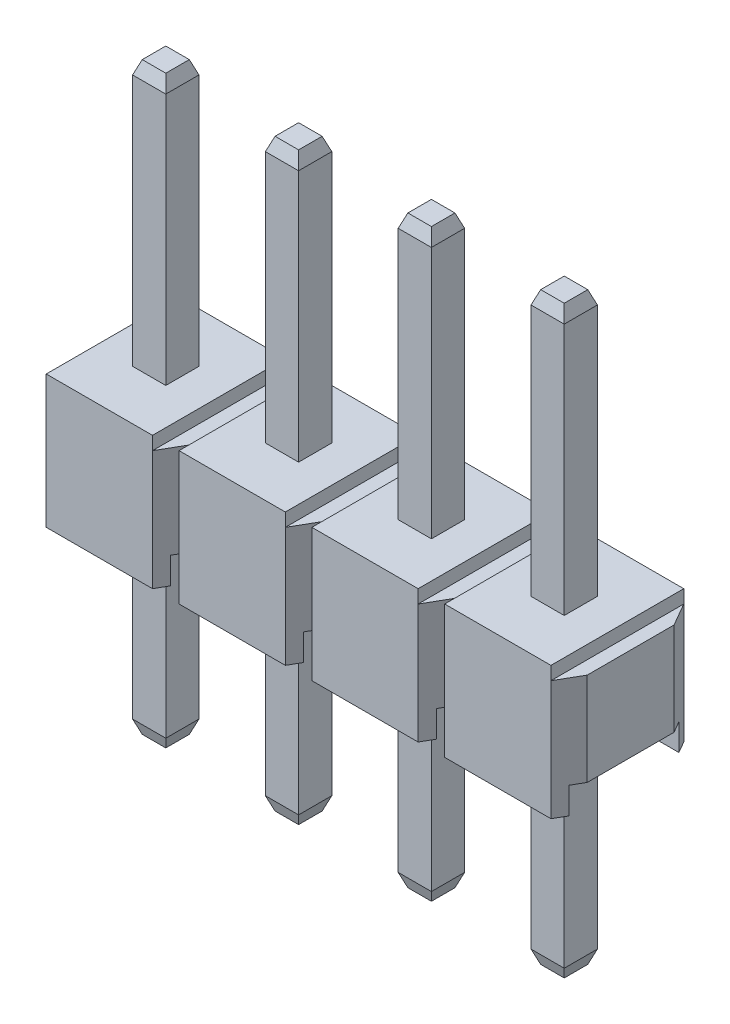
ISO-10303-21;
HEADER;
FILE_DESCRIPTION(('STEP AP214'),'2;1');
FILE_NAME('part.step','',(''),(''),'','','');
FILE_SCHEMA(('AUTOMOTIVE_DESIGN { 1 0 10303 214 1 1 1 1 }'));
ENDSEC;
DATA;
#1=APPLICATION_CONTEXT('core data for automotive mechanical design processes');
#2=APPLICATION_PROTOCOL_DEFINITION('international standard','automotive_design',2000,#1);
#3=PRODUCT_CONTEXT('',#1,'mechanical');
#4=PRODUCT('Part','Part','',(#3));
#5=PRODUCT_RELATED_PRODUCT_CATEGORY('part','',(#4));
#6=PRODUCT_DEFINITION_FORMATION('','',#4);
#7=PRODUCT_DEFINITION_CONTEXT('part definition',#1,'design');
#8=PRODUCT_DEFINITION('design','',#6,#7);
#9=PRODUCT_DEFINITION_SHAPE('','',#8);
#10=(LENGTH_UNIT() NAMED_UNIT(*) SI_UNIT(.MILLI.,.METRE.));
#11=(NAMED_UNIT(*) PLANE_ANGLE_UNIT() SI_UNIT($,.RADIAN.));
#12=(NAMED_UNIT(*) SI_UNIT($,.STERADIAN.) SOLID_ANGLE_UNIT());
#13=UNCERTAINTY_MEASURE_WITH_UNIT(LENGTH_MEASURE(1.E-05),#10,'distance_accuracy_value','');
#14=(GEOMETRIC_REPRESENTATION_CONTEXT(3) GLOBAL_UNCERTAINTY_ASSIGNED_CONTEXT((#13)) GLOBAL_UNIT_ASSIGNED_CONTEXT((#10,
#11,#12)) REPRESENTATION_CONTEXT('',''));
#15=CARTESIAN_POINT('',(0.,0.,0.));
#16=DIRECTION('',(0.,0.,1.));
#17=DIRECTION('',(1.,0.,0.));
#18=AXIS2_PLACEMENT_3D('',#15,#16,#17);
#19=CARTESIAN_POINT('',(-1.,0.4,0.826794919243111));
#20=DIRECTION('',(0.,1.,0.));
#21=DIRECTION('',(0.,0.,1.));
#22=AXIS2_PLACEMENT_3D('',#19,#20,#21);
#23=PLANE('',#22);
#24=DIRECTION('',(1.,0.,0.));
#25=VECTOR('',#24,1.);
#26=CARTESIAN_POINT('',(-5.,0.4,-0.250000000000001));
#27=LINE('',#26,#25);
#28=CARTESIAN_POINT('',(-4.25,0.4,-0.250000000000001));
#29=VERTEX_POINT('',#28);
#30=CARTESIAN_POINT('',(-3.75,0.4,-0.250000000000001));
#31=VERTEX_POINT('',#30);
#32=EDGE_CURVE('E739',#29,#31,#27,.T.);
#33=ORIENTED_EDGE('',*,*,#32,.F.);
#34=DIRECTION('',(0.,0.,-1.));
#35=VECTOR('',#34,1.);
#36=CARTESIAN_POINT('',(-4.25,0.4,0.826794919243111));
#37=LINE('',#36,#35);
#38=CARTESIAN_POINT('',(-4.25,0.4,0.249999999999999));
#39=VERTEX_POINT('',#38);
#40=EDGE_CURVE('E685',#39,#29,#37,.T.);
#41=ORIENTED_EDGE('',*,*,#40,.F.);
#42=DIRECTION('',(-1.,0.,0.));
#43=VECTOR('',#42,1.);
#44=CARTESIAN_POINT('',(-5.,0.4,0.249999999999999));
#45=LINE('',#44,#43);
#46=CARTESIAN_POINT('',(-3.75,0.4,0.249999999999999));
#47=VERTEX_POINT('',#46);
#48=EDGE_CURVE('E730',#47,#39,#45,.T.);
#49=ORIENTED_EDGE('',*,*,#48,.F.);
#50=DIRECTION('',(0.,0.,1.));
#51=VECTOR('',#50,1.);
#52=CARTESIAN_POINT('',(-3.75,0.4,0.826794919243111));
#53=LINE('',#52,#51);
#54=EDGE_CURVE('E736',#31,#47,#53,.T.);
#55=ORIENTED_EDGE('',*,*,#54,.F.);
#56=EDGE_LOOP('',(#33,#41,#49,#55));
#57=FACE_BOUND('',#56,.T.);
#58=DIRECTION('',(0.,0.,-1.));
#59=VECTOR('',#58,1.);
#60=CARTESIAN_POINT('',(-0.25,0.4,0.826794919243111));
#61=LINE('',#60,#59);
#62=CARTESIAN_POINT('',(-0.25,0.4,0.25));
#63=VERTEX_POINT('',#62);
#64=CARTESIAN_POINT('',(-0.25,0.4,-0.25));
#65=VERTEX_POINT('',#64);
#66=EDGE_CURVE('E1407',#63,#65,#61,.T.);
#67=ORIENTED_EDGE('',*,*,#66,.F.);
#68=DIRECTION('',(-1.,0.,0.));
#69=VECTOR('',#68,1.);
#70=CARTESIAN_POINT('',(-1.,0.4,0.25));
#71=LINE('',#70,#69);
#72=CARTESIAN_POINT('',(0.25,0.4,0.25));
#73=VERTEX_POINT('',#72);
#74=EDGE_CURVE('E1404',#73,#63,#71,.T.);
#75=ORIENTED_EDGE('',*,*,#74,.F.);
#76=DIRECTION('',(0.,0.,1.));
#77=VECTOR('',#76,1.);
#78=CARTESIAN_POINT('',(0.25,0.4,0.826794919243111));
#79=LINE('',#78,#77);
#80=CARTESIAN_POINT('',(0.25,0.4,-0.25));
#81=VERTEX_POINT('',#80);
#82=EDGE_CURVE('E1401',#81,#73,#79,.T.);
#83=ORIENTED_EDGE('',*,*,#82,.F.);
#84=DIRECTION('',(1.,0.,0.));
#85=VECTOR('',#84,1.);
#86=CARTESIAN_POINT('',(-1.,0.4,-0.25));
#87=LINE('',#86,#85);
#88=EDGE_CURVE('E1398',#65,#81,#87,.T.);
#89=ORIENTED_EDGE('',*,*,#88,.F.);
#90=EDGE_LOOP('',(#67,#75,#83,#89));
#91=FACE_BOUND('',#90,.T.);
#92=DIRECTION('',(1.,0.,0.));
#93=VECTOR('',#92,1.);
#94=CARTESIAN_POINT('',(-1.,0.4,-0.826794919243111));
#95=LINE('',#94,#93);
#96=CARTESIAN_POINT('',(-0.9,0.4,-0.826794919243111));
#97=VERTEX_POINT('',#96);
#98=CARTESIAN_POINT('',(0.9,0.4,-0.826794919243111));
#99=VERTEX_POINT('',#98);
#100=EDGE_CURVE('E1310',#97,#99,#95,.T.);
#101=ORIENTED_EDGE('',*,*,#100,.T.);
#102=DIRECTION('',(-0.499999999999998,0.,-0.86602540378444));
#103=VECTOR('',#102,1.);
#104=CARTESIAN_POINT('',(0.8,0.4,-1.));
#105=LINE('',#104,#103);
#106=CARTESIAN_POINT('',(1.,0.4,-0.653589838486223));
#107=VERTEX_POINT('',#106);
#108=EDGE_CURVE('E1390',#107,#99,#105,.T.);
#109=ORIENTED_EDGE('',*,*,#108,.F.);
#110=DIRECTION('',(0.,0.,1.));
#111=VECTOR('',#110,1.);
#112=CARTESIAN_POINT('',(1.,0.4,0.826794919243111));
#113=LINE('',#112,#111);
#114=CARTESIAN_POINT('',(1.,0.4,0.653589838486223));
#115=VERTEX_POINT('',#114);
#116=EDGE_CURVE('E1307',#107,#115,#113,.T.);
#117=ORIENTED_EDGE('',*,*,#116,.T.);
#118=DIRECTION('',(0.499999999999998,0.,-0.86602540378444));
#119=VECTOR('',#118,1.);
#120=CARTESIAN_POINT('',(0.8,0.4,1.));
#121=LINE('',#120,#119);
#122=CARTESIAN_POINT('',(0.9,0.4,0.826794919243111));
#123=VERTEX_POINT('',#122);
#124=EDGE_CURVE('E1328',#123,#115,#121,.T.);
#125=ORIENTED_EDGE('',*,*,#124,.F.);
#126=DIRECTION('',(1.,0.,0.));
#127=VECTOR('',#126,1.);
#128=CARTESIAN_POINT('',(-1.,0.4,0.826794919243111));
#129=LINE('',#128,#127);
#130=CARTESIAN_POINT('',(-0.9,0.4,0.826794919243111));
#131=VERTEX_POINT('',#130);
#132=EDGE_CURVE('E1311',#131,#123,#129,.T.);
#133=ORIENTED_EDGE('',*,*,#132,.F.);
#134=DIRECTION('',(0.499999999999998,0.,0.86602540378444));
#135=VECTOR('',#134,1.);
#136=CARTESIAN_POINT('',(-1.,0.4,0.653589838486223));
#137=LINE('',#136,#135);
#138=CARTESIAN_POINT('',(-1.,0.4,0.653589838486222));
#139=VERTEX_POINT('',#138);
#140=EDGE_CURVE('E1331',#139,#131,#137,.T.);
#141=ORIENTED_EDGE('',*,*,#140,.F.);
#142=DIRECTION('',(0.499999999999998,0.,-0.86602540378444));
#143=VECTOR('',#142,1.);
#144=CARTESIAN_POINT('',(-1.2,0.4,1.));
#145=LINE('',#144,#143);
#146=CARTESIAN_POINT('',(-1.1,0.4,0.826794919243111));
#147=VERTEX_POINT('',#146);
#148=EDGE_CURVE('E1173',#147,#139,#145,.T.);
#149=ORIENTED_EDGE('',*,*,#148,.F.);
#150=DIRECTION('',(1.,0.,0.));
#151=VECTOR('',#150,1.);
#152=CARTESIAN_POINT('',(-3.,0.4,0.826794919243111));
#153=LINE('',#152,#151);
#154=CARTESIAN_POINT('',(-2.9,0.4,0.826794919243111));
#155=VERTEX_POINT('',#154);
#156=EDGE_CURVE('E1176',#155,#147,#153,.T.);
#157=ORIENTED_EDGE('',*,*,#156,.F.);
#158=DIRECTION('',(0.499999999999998,0.,0.86602540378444));
#159=VECTOR('',#158,1.);
#160=CARTESIAN_POINT('',(-3.,0.4,0.653589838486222));
#161=LINE('',#160,#159);
#162=CARTESIAN_POINT('',(-3.,0.4,0.653589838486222));
#163=VERTEX_POINT('',#162);
#164=EDGE_CURVE('E1179',#163,#155,#161,.T.);
#165=ORIENTED_EDGE('',*,*,#164,.F.);
#166=DIRECTION('',(0.499999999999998,0.,-0.86602540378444));
#167=VECTOR('',#166,1.);
#168=CARTESIAN_POINT('',(-3.2,0.4,1.));
#169=LINE('',#168,#167);
#170=CARTESIAN_POINT('',(-3.1,0.4,0.826794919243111));
#171=VERTEX_POINT('',#170);
#172=EDGE_CURVE('E1078',#171,#163,#169,.T.);
#173=ORIENTED_EDGE('',*,*,#172,.F.);
#174=DIRECTION('',(1.,0.,0.));
#175=VECTOR('',#174,1.);
#176=CARTESIAN_POINT('',(-5.,0.4,0.826794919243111));
#177=LINE('',#176,#175);
#178=CARTESIAN_POINT('',(-4.9,0.4,0.826794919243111));
#179=VERTEX_POINT('',#178);
#180=EDGE_CURVE('E1081',#179,#171,#177,.T.);
#181=ORIENTED_EDGE('',*,*,#180,.F.);
#182=DIRECTION('',(0.499999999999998,0.,0.86602540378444));
#183=VECTOR('',#182,1.);
#184=CARTESIAN_POINT('',(-5.,0.4,0.653589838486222));
#185=LINE('',#184,#183);
#186=CARTESIAN_POINT('',(-5.,0.4,0.653589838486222));
#187=VERTEX_POINT('',#186);
#188=EDGE_CURVE('E1084',#187,#179,#185,.T.);
#189=ORIENTED_EDGE('',*,*,#188,.F.);
#190=DIRECTION('',(0.499999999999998,0.,-0.86602540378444));
#191=VECTOR('',#190,1.);
#192=CARTESIAN_POINT('',(-5.2,0.4,0.999999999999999));
#193=LINE('',#192,#191);
#194=CARTESIAN_POINT('',(-5.1,0.4,0.826794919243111));
#195=VERTEX_POINT('',#194);
#196=EDGE_CURVE('E975',#195,#187,#193,.T.);
#197=ORIENTED_EDGE('',*,*,#196,.F.);
#198=DIRECTION('',(1.,0.,0.));
#199=VECTOR('',#198,1.);
#200=CARTESIAN_POINT('',(-7.,0.4,0.826794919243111));
#201=LINE('',#200,#199);
#202=CARTESIAN_POINT('',(-6.9,0.4,0.826794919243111));
#203=VERTEX_POINT('',#202);
#204=EDGE_CURVE('E978',#203,#195,#201,.T.);
#205=ORIENTED_EDGE('',*,*,#204,.F.);
#206=DIRECTION('',(0.499999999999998,0.,0.86602540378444));
#207=VECTOR('',#206,1.);
#208=CARTESIAN_POINT('',(-7.,0.4,0.653589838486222));
#209=LINE('',#208,#207);
#210=CARTESIAN_POINT('',(-7.,0.4,0.653589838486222));
#211=VERTEX_POINT('',#210);
#212=EDGE_CURVE('E981',#211,#203,#209,.T.);
#213=ORIENTED_EDGE('',*,*,#212,.F.);
#214=DIRECTION('',(0.,0.,1.));
#215=VECTOR('',#214,1.);
#216=CARTESIAN_POINT('',(-7.,0.4,0.826794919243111));
#217=LINE('',#216,#215);
#218=CARTESIAN_POINT('',(-7.,0.4,-0.653589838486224));
#219=VERTEX_POINT('',#218);
#220=EDGE_CURVE('E984',#219,#211,#217,.T.);
#221=ORIENTED_EDGE('',*,*,#220,.F.);
#222=DIRECTION('',(-0.499999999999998,0.,0.86602540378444));
#223=VECTOR('',#222,1.);
#224=CARTESIAN_POINT('',(-7.,0.4,-0.653589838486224));
#225=LINE('',#224,#223);
#226=CARTESIAN_POINT('',(-6.9,0.4,-0.826794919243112));
#227=VERTEX_POINT('',#226);
#228=EDGE_CURVE('E987',#227,#219,#225,.T.);
#229=ORIENTED_EDGE('',*,*,#228,.F.);
#230=DIRECTION('',(1.,0.,0.));
#231=VECTOR('',#230,1.);
#232=CARTESIAN_POINT('',(-7.,0.4,-0.826794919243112));
#233=LINE('',#232,#231);
#234=CARTESIAN_POINT('',(-5.1,0.4,-0.826794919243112));
#235=VERTEX_POINT('',#234);
#236=EDGE_CURVE('E970',#227,#235,#233,.T.);
#237=ORIENTED_EDGE('',*,*,#236,.T.);
#238=DIRECTION('',(-0.499999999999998,0.,-0.86602540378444));
#239=VECTOR('',#238,1.);
#240=CARTESIAN_POINT('',(-5.2,0.4,-1.));
#241=LINE('',#240,#239);
#242=CARTESIAN_POINT('',(-5.,0.4,-0.653589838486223));
#243=VERTEX_POINT('',#242);
#244=EDGE_CURVE('E972',#243,#235,#241,.T.);
#245=ORIENTED_EDGE('',*,*,#244,.F.);
#246=DIRECTION('',(-0.499999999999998,0.,0.86602540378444));
#247=VECTOR('',#246,1.);
#248=CARTESIAN_POINT('',(-5.,0.4,-0.653589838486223));
#249=LINE('',#248,#247);
#250=CARTESIAN_POINT('',(-4.9,0.4,-0.826794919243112));
#251=VERTEX_POINT('',#250);
#252=EDGE_CURVE('E1087',#251,#243,#249,.T.);
#253=ORIENTED_EDGE('',*,*,#252,.F.);
#254=DIRECTION('',(1.,0.,0.));
#255=VECTOR('',#254,1.);
#256=CARTESIAN_POINT('',(-5.,0.4,-0.826794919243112));
#257=LINE('',#256,#255);
#258=CARTESIAN_POINT('',(-3.1,0.4,-0.826794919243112));
#259=VERTEX_POINT('',#258);
#260=EDGE_CURVE('E1073',#251,#259,#257,.T.);
#261=ORIENTED_EDGE('',*,*,#260,.T.);
#262=DIRECTION('',(-0.499999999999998,0.,-0.86602540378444));
#263=VECTOR('',#262,1.);
#264=CARTESIAN_POINT('',(-3.2,0.4,-1.));
#265=LINE('',#264,#263);
#266=CARTESIAN_POINT('',(-3.,0.4,-0.653589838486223));
#267=VERTEX_POINT('',#266);
#268=EDGE_CURVE('E1075',#267,#259,#265,.T.);
#269=ORIENTED_EDGE('',*,*,#268,.F.);
#270=DIRECTION('',(-0.499999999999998,0.,0.86602540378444));
#271=VECTOR('',#270,1.);
#272=CARTESIAN_POINT('',(-3.,0.4,-0.653589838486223));
#273=LINE('',#272,#271);
#274=CARTESIAN_POINT('',(-2.9,0.4,-0.826794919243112));
#275=VERTEX_POINT('',#274);
#276=EDGE_CURVE('E1182',#275,#267,#273,.T.);
#277=ORIENTED_EDGE('',*,*,#276,.F.);
#278=DIRECTION('',(1.,0.,0.));
#279=VECTOR('',#278,1.);
#280=CARTESIAN_POINT('',(-3.,0.4,-0.826794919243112));
#281=LINE('',#280,#279);
#282=CARTESIAN_POINT('',(-1.1,0.4,-0.826794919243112));
#283=VERTEX_POINT('',#282);
#284=EDGE_CURVE('E1168',#275,#283,#281,.T.);
#285=ORIENTED_EDGE('',*,*,#284,.T.);
#286=DIRECTION('',(-0.499999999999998,0.,-0.86602540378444));
#287=VECTOR('',#286,1.);
#288=CARTESIAN_POINT('',(-1.2,0.4,-1.));
#289=LINE('',#288,#287);
#290=CARTESIAN_POINT('',(-1.,0.4,-0.653589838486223));
#291=VERTEX_POINT('',#290);
#292=EDGE_CURVE('E1170',#291,#283,#289,.T.);
#293=ORIENTED_EDGE('',*,*,#292,.F.);
#294=DIRECTION('',(-0.499999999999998,0.,0.86602540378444));
#295=VECTOR('',#294,1.);
#296=CARTESIAN_POINT('',(-1.,0.4,-0.653589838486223));
#297=LINE('',#296,#295);
#298=EDGE_CURVE('E1334',#97,#291,#297,.T.);
#299=ORIENTED_EDGE('',*,*,#298,.F.);
#300=EDGE_LOOP('',(#101,#109,#117,#125,#133,#141,#149,#157,#165,#173,#181,#189,#197,#205,#213,
#221,#229,#237,#245,#253,#261,#269,#277,#285,#293,#299));
#301=FACE_BOUND('',#300,.T.);
#302=DIRECTION('',(1.,0.,0.));
#303=VECTOR('',#302,1.);
#304=CARTESIAN_POINT('',(-3.,0.4,-0.25));
#305=LINE('',#304,#303);
#306=CARTESIAN_POINT('',(-2.25,0.4,-0.25));
#307=VERTEX_POINT('',#306);
#308=CARTESIAN_POINT('',(-1.75,0.4,-0.25));
#309=VERTEX_POINT('',#308);
#310=EDGE_CURVE('E796',#307,#309,#305,.T.);
#311=ORIENTED_EDGE('',*,*,#310,.F.);
#312=DIRECTION('',(0.,0.,-1.));
#313=VECTOR('',#312,1.);
#314=CARTESIAN_POINT('',(-2.25,0.4,0.826794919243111));
#315=LINE('',#314,#313);
#316=CARTESIAN_POINT('',(-2.25,0.4,0.25));
#317=VERTEX_POINT('',#316);
#318=EDGE_CURVE('E742',#317,#307,#315,.T.);
#319=ORIENTED_EDGE('',*,*,#318,.F.);
#320=DIRECTION('',(-1.,0.,0.));
#321=VECTOR('',#320,1.);
#322=CARTESIAN_POINT('',(-3.,0.4,0.25));
#323=LINE('',#322,#321);
#324=CARTESIAN_POINT('',(-1.75,0.4,0.25));
#325=VERTEX_POINT('',#324);
#326=EDGE_CURVE('E787',#325,#317,#323,.T.);
#327=ORIENTED_EDGE('',*,*,#326,.F.);
#328=DIRECTION('',(0.,0.,1.));
#329=VECTOR('',#328,1.);
#330=CARTESIAN_POINT('',(-1.75,0.4,0.826794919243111));
#331=LINE('',#330,#329);
#332=EDGE_CURVE('E793',#309,#325,#331,.T.);
#333=ORIENTED_EDGE('',*,*,#332,.F.);
#334=EDGE_LOOP('',(#311,#319,#327,#333));
#335=FACE_BOUND('',#334,.T.);
#336=DIRECTION('',(1.,0.,0.));
#337=VECTOR('',#336,1.);
#338=CARTESIAN_POINT('',(-7.,0.4,-0.250000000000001));
#339=LINE('',#338,#337);
#340=CARTESIAN_POINT('',(-6.25,0.4,-0.250000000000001));
#341=VERTEX_POINT('',#340);
#342=CARTESIAN_POINT('',(-5.75,0.4,-0.250000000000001));
#343=VERTEX_POINT('',#342);
#344=EDGE_CURVE('E682',#341,#343,#339,.T.);
#345=ORIENTED_EDGE('',*,*,#344,.F.);
#346=DIRECTION('',(0.,0.,-1.));
#347=VECTOR('',#346,1.);
#348=CARTESIAN_POINT('',(-6.25,0.4,0.826794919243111));
#349=LINE('',#348,#347);
#350=CARTESIAN_POINT('',(-6.25,0.4,0.249999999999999));
#351=VERTEX_POINT('',#350);
#352=EDGE_CURVE('E645',#351,#341,#349,.T.);
#353=ORIENTED_EDGE('',*,*,#352,.F.);
#354=DIRECTION('',(-1.,0.,0.));
#355=VECTOR('',#354,1.);
#356=CARTESIAN_POINT('',(-7.,0.4,0.249999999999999));
#357=LINE('',#356,#355);
#358=CARTESIAN_POINT('',(-5.75,0.4,0.249999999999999));
#359=VERTEX_POINT('',#358);
#360=EDGE_CURVE('E52',#359,#351,#357,.T.);
#361=ORIENTED_EDGE('',*,*,#360,.F.);
#362=DIRECTION('',(0.,0.,1.));
#363=VECTOR('',#362,1.);
#364=CARTESIAN_POINT('',(-5.75,0.4,0.826794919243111));
#365=LINE('',#364,#363);
#366=EDGE_CURVE('E47',#343,#359,#365,.T.);
#367=ORIENTED_EDGE('',*,*,#366,.F.);
#368=EDGE_LOOP('',(#345,#353,#361,#367));
#369=FACE_BOUND('',#368,.T.);
#370=ADVANCED_FACE('F30',(#57,#91,#301,#335,#369),#23,.F.);
#371=CARTESIAN_POINT('',(-7.,2.,-1.));
#372=DIRECTION('',(0.,-1.,0.));
#373=DIRECTION('',(0.,0.,-1.));
#374=AXIS2_PLACEMENT_3D('',#371,#372,#373);
#375=PLANE('',#374);
#376=DIRECTION('',(1.,0.,0.));
#377=VECTOR('',#376,1.);
#378=CARTESIAN_POINT('',(-6.8,2.,0.999999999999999));
#379=LINE('',#378,#377);
#380=CARTESIAN_POINT('',(-6.8,2.,0.999999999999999));
#381=VERTEX_POINT('',#380);
#382=CARTESIAN_POINT('',(-5.2,2.,0.999999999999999));
#383=VERTEX_POINT('',#382);
#384=EDGE_CURVE('E1041',#381,#383,#379,.T.);
#385=ORIENTED_EDGE('',*,*,#384,.T.);
#386=DIRECTION('',(0.,0.,1.));
#387=VECTOR('',#386,1.);
#388=CARTESIAN_POINT('',(-5.2,2.,-1.));
#389=LINE('',#388,#387);
#390=CARTESIAN_POINT('',(-5.2,2.,-1.));
#391=VERTEX_POINT('',#390);
#392=EDGE_CURVE('E1016',#391,#383,#389,.T.);
#393=ORIENTED_EDGE('',*,*,#392,.F.);
#394=DIRECTION('',(-1.,0.,0.));
#395=VECTOR('',#394,1.);
#396=CARTESIAN_POINT('',(-6.8,2.,-1.));
#397=LINE('',#396,#395);
#398=CARTESIAN_POINT('',(-6.8,2.,-1.));
#399=VERTEX_POINT('',#398);
#400=EDGE_CURVE('E1070',#391,#399,#397,.T.);
#401=ORIENTED_EDGE('',*,*,#400,.T.);
#402=DIRECTION('',(0.,0.,1.));
#403=VECTOR('',#402,1.);
#404=CARTESIAN_POINT('',(-6.8,2.,-1.));
#405=LINE('',#404,#403);
#406=EDGE_CURVE('E1047',#399,#381,#405,.T.);
#407=ORIENTED_EDGE('',*,*,#406,.T.);
#408=EDGE_LOOP('',(#385,#393,#401,#407));
#409=FACE_BOUND('',#408,.T.);
#410=DIRECTION('',(0.,0.,1.));
#411=VECTOR('',#410,1.);
#412=CARTESIAN_POINT('',(-6.25,2.,-1.));
#413=LINE('',#412,#411);
#414=CARTESIAN_POINT('',(-6.25,2.,-0.250000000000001));
#415=VERTEX_POINT('',#414);
#416=CARTESIAN_POINT('',(-6.25,2.,0.249999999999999));
#417=VERTEX_POINT('',#416);
#418=EDGE_CURVE('E853',#415,#417,#413,.T.);
#419=ORIENTED_EDGE('',*,*,#418,.F.);
#420=DIRECTION('',(-1.,0.,0.));
#421=VECTOR('',#420,1.);
#422=CARTESIAN_POINT('',(-7.,2.,-0.250000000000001));
#423=LINE('',#422,#421);
#424=CARTESIAN_POINT('',(-5.75,2.,-0.250000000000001));
#425=VERTEX_POINT('',#424);
#426=EDGE_CURVE('E799',#425,#415,#423,.T.);
#427=ORIENTED_EDGE('',*,*,#426,.F.);
#428=DIRECTION('',(0.,0.,-1.));
#429=VECTOR('',#428,1.);
#430=CARTESIAN_POINT('',(-5.75,2.,-1.));
#431=LINE('',#430,#429);
#432=CARTESIAN_POINT('',(-5.75,2.,0.249999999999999));
#433=VERTEX_POINT('',#432);
#434=EDGE_CURVE('E844',#433,#425,#431,.T.);
#435=ORIENTED_EDGE('',*,*,#434,.F.);
#436=DIRECTION('',(1.,0.,0.));
#437=VECTOR('',#436,1.);
#438=CARTESIAN_POINT('',(-7.,2.,0.249999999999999));
#439=LINE('',#438,#437);
#440=EDGE_CURVE('E850',#417,#433,#439,.T.);
#441=ORIENTED_EDGE('',*,*,#440,.F.);
#442=EDGE_LOOP('',(#419,#427,#435,#441));
#443=FACE_BOUND('',#442,.T.);
#444=ADVANCED_FACE('F1509',(#409,#443),#375,.F.);
#445=CARTESIAN_POINT('',(-5.,2.,-1.));
#446=DIRECTION('',(0.,-1.,0.));
#447=DIRECTION('',(0.,0.,-1.));
#448=AXIS2_PLACEMENT_3D('',#445,#446,#447);
#449=PLANE('',#448);
#450=DIRECTION('',(1.,0.,0.));
#451=VECTOR('',#450,1.);
#452=CARTESIAN_POINT('',(-4.8,2.,1.));
#453=LINE('',#452,#451);
#454=CARTESIAN_POINT('',(-4.8,2.,1.));
#455=VERTEX_POINT('',#454);
#456=CARTESIAN_POINT('',(-3.2,2.,1.));
#457=VERTEX_POINT('',#456);
#458=EDGE_CURVE('E1140',#455,#457,#453,.T.);
#459=ORIENTED_EDGE('',*,*,#458,.T.);
#460=DIRECTION('',(0.,0.,1.));
#461=VECTOR('',#460,1.);
#462=CARTESIAN_POINT('',(-3.2,2.,-1.));
#463=LINE('',#462,#461);
#464=CARTESIAN_POINT('',(-3.2,2.,-1.));
#465=VERTEX_POINT('',#464);
#466=EDGE_CURVE('E1115',#465,#457,#463,.T.);
#467=ORIENTED_EDGE('',*,*,#466,.F.);
#468=DIRECTION('',(-1.,0.,0.));
#469=VECTOR('',#468,1.);
#470=CARTESIAN_POINT('',(-4.8,2.,-1.));
#471=LINE('',#470,#469);
#472=CARTESIAN_POINT('',(-4.8,2.,-1.));
#473=VERTEX_POINT('',#472);
#474=EDGE_CURVE('E1165',#465,#473,#471,.T.);
#475=ORIENTED_EDGE('',*,*,#474,.T.);
#476=DIRECTION('',(0.,0.,1.));
#477=VECTOR('',#476,1.);
#478=CARTESIAN_POINT('',(-4.8,2.,-1.));
#479=LINE('',#478,#477);
#480=EDGE_CURVE('E1146',#473,#455,#479,.T.);
#481=ORIENTED_EDGE('',*,*,#480,.T.);
#482=EDGE_LOOP('',(#459,#467,#475,#481));
#483=FACE_BOUND('',#482,.T.);
#484=DIRECTION('',(0.,0.,1.));
#485=VECTOR('',#484,1.);
#486=CARTESIAN_POINT('',(-4.25,2.,-1.));
#487=LINE('',#486,#485);
#488=CARTESIAN_POINT('',(-4.25,2.,-0.250000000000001));
#489=VERTEX_POINT('',#488);
#490=CARTESIAN_POINT('',(-4.25,2.,0.249999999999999));
#491=VERTEX_POINT('',#490);
#492=EDGE_CURVE('E910',#489,#491,#487,.T.);
#493=ORIENTED_EDGE('',*,*,#492,.F.);
#494=DIRECTION('',(-1.,0.,0.));
#495=VECTOR('',#494,1.);
#496=CARTESIAN_POINT('',(-5.,2.,-0.250000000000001));
#497=LINE('',#496,#495);
#498=CARTESIAN_POINT('',(-3.75,2.,-0.250000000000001));
#499=VERTEX_POINT('',#498);
#500=EDGE_CURVE('E856',#499,#489,#497,.T.);
#501=ORIENTED_EDGE('',*,*,#500,.F.);
#502=DIRECTION('',(0.,0.,-1.));
#503=VECTOR('',#502,1.);
#504=CARTESIAN_POINT('',(-3.75,2.,-1.));
#505=LINE('',#504,#503);
#506=CARTESIAN_POINT('',(-3.75,2.,0.25));
#507=VERTEX_POINT('',#506);
#508=EDGE_CURVE('E901',#507,#499,#505,.T.);
#509=ORIENTED_EDGE('',*,*,#508,.F.);
#510=DIRECTION('',(1.,0.,0.));
#511=VECTOR('',#510,1.);
#512=CARTESIAN_POINT('',(-5.,2.,0.249999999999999));
#513=LINE('',#512,#511);
#514=EDGE_CURVE('E907',#491,#507,#513,.T.);
#515=ORIENTED_EDGE('',*,*,#514,.F.);
#516=EDGE_LOOP('',(#493,#501,#509,#515));
#517=FACE_BOUND('',#516,.T.);
#518=ADVANCED_FACE('F1515',(#483,#517),#449,.F.);
#519=CARTESIAN_POINT('',(-3.,2.,-1.));
#520=DIRECTION('',(0.,-1.,0.));
#521=DIRECTION('',(0.,0.,-1.));
#522=AXIS2_PLACEMENT_3D('',#519,#520,#521);
#523=PLANE('',#522);
#524=DIRECTION('',(1.,0.,0.));
#525=VECTOR('',#524,1.);
#526=CARTESIAN_POINT('',(-2.8,2.,1.));
#527=LINE('',#526,#525);
#528=CARTESIAN_POINT('',(-2.8,2.,1.));
#529=VERTEX_POINT('',#528);
#530=CARTESIAN_POINT('',(-1.2,2.,1.));
#531=VERTEX_POINT('',#530);
#532=EDGE_CURVE('E1235',#529,#531,#527,.T.);
#533=ORIENTED_EDGE('',*,*,#532,.T.);
#534=DIRECTION('',(0.,0.,1.));
#535=VECTOR('',#534,1.);
#536=CARTESIAN_POINT('',(-1.2,2.,-1.));
#537=LINE('',#536,#535);
#538=CARTESIAN_POINT('',(-1.2,2.,-1.));
#539=VERTEX_POINT('',#538);
#540=EDGE_CURVE('E1210',#539,#531,#537,.T.);
#541=ORIENTED_EDGE('',*,*,#540,.F.);
#542=DIRECTION('',(-1.,0.,0.));
#543=VECTOR('',#542,1.);
#544=CARTESIAN_POINT('',(-2.8,2.,-1.));
#545=LINE('',#544,#543);
#546=CARTESIAN_POINT('',(-2.8,2.,-1.));
#547=VERTEX_POINT('',#546);
#548=EDGE_CURVE('E1260',#539,#547,#545,.T.);
#549=ORIENTED_EDGE('',*,*,#548,.T.);
#550=DIRECTION('',(0.,0.,1.));
#551=VECTOR('',#550,1.);
#552=CARTESIAN_POINT('',(-2.8,2.,-1.));
#553=LINE('',#552,#551);
#554=EDGE_CURVE('E1241',#547,#529,#553,.T.);
#555=ORIENTED_EDGE('',*,*,#554,.T.);
#556=EDGE_LOOP('',(#533,#541,#549,#555));
#557=FACE_BOUND('',#556,.T.);
#558=DIRECTION('',(0.,0.,1.));
#559=VECTOR('',#558,1.);
#560=CARTESIAN_POINT('',(-2.25,2.,-1.));
#561=LINE('',#560,#559);
#562=CARTESIAN_POINT('',(-2.25,2.,-0.25));
#563=VERTEX_POINT('',#562);
#564=CARTESIAN_POINT('',(-2.25,2.,0.25));
#565=VERTEX_POINT('',#564);
#566=EDGE_CURVE('E967',#563,#565,#561,.T.);
#567=ORIENTED_EDGE('',*,*,#566,.F.);
#568=DIRECTION('',(-1.,0.,0.));
#569=VECTOR('',#568,1.);
#570=CARTESIAN_POINT('',(-3.,2.,-0.25));
#571=LINE('',#570,#569);
#572=CARTESIAN_POINT('',(-1.75,2.,-0.25));
#573=VERTEX_POINT('',#572);
#574=EDGE_CURVE('E913',#573,#563,#571,.T.);
#575=ORIENTED_EDGE('',*,*,#574,.F.);
#576=DIRECTION('',(0.,0.,-1.));
#577=VECTOR('',#576,1.);
#578=CARTESIAN_POINT('',(-1.75,2.,-1.));
#579=LINE('',#578,#577);
#580=CARTESIAN_POINT('',(-1.75,2.,0.25));
#581=VERTEX_POINT('',#580);
#582=EDGE_CURVE('E958',#581,#573,#579,.T.);
#583=ORIENTED_EDGE('',*,*,#582,.F.);
#584=DIRECTION('',(1.,0.,0.));
#585=VECTOR('',#584,1.);
#586=CARTESIAN_POINT('',(-3.,2.,0.25));
#587=LINE('',#586,#585);
#588=EDGE_CURVE('E964',#565,#581,#587,.T.);
#589=ORIENTED_EDGE('',*,*,#588,.F.);
#590=EDGE_LOOP('',(#567,#575,#583,#589));
#591=FACE_BOUND('',#590,.T.);
#592=ADVANCED_FACE('F1535',(#557,#591),#523,.F.);
#593=CARTESIAN_POINT('',(-1.,2.,-1.));
#594=DIRECTION('',(0.,-1.,0.));
#595=DIRECTION('',(0.,0.,-1.));
#596=AXIS2_PLACEMENT_3D('',#593,#594,#595);
#597=PLANE('',#596);
#598=DIRECTION('',(1.,0.,0.));
#599=VECTOR('',#598,1.);
#600=CARTESIAN_POINT('',(-0.8,2.,1.));
#601=LINE('',#600,#599);
#602=CARTESIAN_POINT('',(-0.8,2.,1.));
#603=VERTEX_POINT('',#602);
#604=CARTESIAN_POINT('',(0.8,2.,1.));
#605=VERTEX_POINT('',#604);
#606=EDGE_CURVE('E1340',#603,#605,#601,.T.);
#607=ORIENTED_EDGE('',*,*,#606,.T.);
#608=DIRECTION('',(0.,0.,1.));
#609=VECTOR('',#608,1.);
#610=CARTESIAN_POINT('',(0.8,2.,-1.));
#611=LINE('',#610,#609);
#612=CARTESIAN_POINT('',(0.8,2.,-1.));
#613=VERTEX_POINT('',#612);
#614=EDGE_CURVE('E1288',#613,#605,#611,.T.);
#615=ORIENTED_EDGE('',*,*,#614,.F.);
#616=DIRECTION('',(-1.,0.,0.));
#617=VECTOR('',#616,1.);
#618=CARTESIAN_POINT('',(-0.8,2.,-1.));
#619=LINE('',#618,#617);
#620=CARTESIAN_POINT('',(-0.8,2.,-1.));
#621=VERTEX_POINT('',#620);
#622=EDGE_CURVE('E1337',#613,#621,#619,.T.);
#623=ORIENTED_EDGE('',*,*,#622,.T.);
#624=DIRECTION('',(0.,0.,1.));
#625=VECTOR('',#624,1.);
#626=CARTESIAN_POINT('',(-0.8,2.,-1.));
#627=LINE('',#626,#625);
#628=EDGE_CURVE('E1299',#621,#603,#627,.T.);
#629=ORIENTED_EDGE('',*,*,#628,.T.);
#630=EDGE_LOOP('',(#607,#615,#623,#629));
#631=FACE_BOUND('',#630,.T.);
#632=DIRECTION('',(0.,0.,1.));
#633=VECTOR('',#632,1.);
#634=CARTESIAN_POINT('',(-0.25,2.,-1.));
#635=LINE('',#634,#633);
#636=CARTESIAN_POINT('',(-0.25,2.,-0.25));
#637=VERTEX_POINT('',#636);
#638=CARTESIAN_POINT('',(-0.25,2.,0.25));
#639=VERTEX_POINT('',#638);
#640=EDGE_CURVE('E1285',#637,#639,#635,.T.);
#641=ORIENTED_EDGE('',*,*,#640,.F.);
#642=DIRECTION('',(-1.,0.,0.));
#643=VECTOR('',#642,1.);
#644=CARTESIAN_POINT('',(-1.,2.,-0.25));
#645=LINE('',#644,#643);
#646=CARTESIAN_POINT('',(0.25,2.,-0.25));
#647=VERTEX_POINT('',#646);
#648=EDGE_CURVE('E1276',#647,#637,#645,.T.);
#649=ORIENTED_EDGE('',*,*,#648,.F.);
#650=DIRECTION('',(0.,0.,-1.));
#651=VECTOR('',#650,1.);
#652=CARTESIAN_POINT('',(0.25,2.,-1.));
#653=LINE('',#652,#651);
#654=CARTESIAN_POINT('',(0.25,2.,0.25));
#655=VERTEX_POINT('',#654);
#656=EDGE_CURVE('E1279',#655,#647,#653,.T.);
#657=ORIENTED_EDGE('',*,*,#656,.F.);
#658=DIRECTION('',(1.,0.,0.));
#659=VECTOR('',#658,1.);
#660=CARTESIAN_POINT('',(-1.,2.,0.25));
#661=LINE('',#660,#659);
#662=EDGE_CURVE('E1282',#639,#655,#661,.T.);
#663=ORIENTED_EDGE('',*,*,#662,.F.);
#664=EDGE_LOOP('',(#641,#649,#657,#663));
#665=FACE_BOUND('',#664,.T.);
#666=ADVANCED_FACE('F1531',(#631,#665),#597,.F.);
#667=CARTESIAN_POINT('',(-1.,0.,-1.));
#668=DIRECTION('',(0.,-1.,0.));
#669=DIRECTION('',(0.,0.,-1.));
#670=AXIS2_PLACEMENT_3D('',#667,#668,#669);
#671=PLANE('',#670);
#672=DIRECTION('',(-1.,0.,0.));
#673=VECTOR('',#672,1.);
#674=CARTESIAN_POINT('',(-1.,0.,0.826794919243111));
#675=LINE('',#674,#673);
#676=CARTESIAN_POINT('',(0.9,0.,0.826794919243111));
#677=VERTEX_POINT('',#676);
#678=CARTESIAN_POINT('',(-0.9,0.,0.826794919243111));
#679=VERTEX_POINT('',#678);
#680=EDGE_CURVE('E1388',#677,#679,#675,.T.);
#681=ORIENTED_EDGE('',*,*,#680,.F.);
#682=DIRECTION('',(0.499999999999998,0.,-0.86602540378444));
#683=VECTOR('',#682,1.);
#684=CARTESIAN_POINT('',(0.8,0.,1.));
#685=LINE('',#684,#683);
#686=CARTESIAN_POINT('',(0.8,0.,1.));
#687=VERTEX_POINT('',#686);
#688=EDGE_CURVE('E1356',#687,#677,#685,.T.);
#689=ORIENTED_EDGE('',*,*,#688,.F.);
#690=DIRECTION('',(1.,0.,0.));
#691=VECTOR('',#690,1.);
#692=CARTESIAN_POINT('',(-0.8,0.,1.));
#693=LINE('',#692,#691);
#694=CARTESIAN_POINT('',(-0.8,0.,1.));
#695=VERTEX_POINT('',#694);
#696=EDGE_CURVE('E1353',#695,#687,#693,.T.);
#697=ORIENTED_EDGE('',*,*,#696,.F.);
#698=DIRECTION('',(0.499999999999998,0.,0.86602540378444));
#699=VECTOR('',#698,1.);
#700=CARTESIAN_POINT('',(-1.,0.,0.653589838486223));
#701=LINE('',#700,#699);
#702=EDGE_CURVE('E1350',#679,#695,#701,.T.);
#703=ORIENTED_EDGE('',*,*,#702,.F.);
#704=EDGE_LOOP('',(#681,#689,#697,#703));
#705=FACE_BOUND('',#704,.T.);
#706=ADVANCED_FACE('F1534',(#705),#671,.T.);
#707=CARTESIAN_POINT('',(-0.8,2.,-1.));
#708=DIRECTION('',(0.,0.,1.));
#709=DIRECTION('',(1.,0.,0.));
#710=AXIS2_PLACEMENT_3D('',#707,#708,#709);
#711=PLANE('',#710);
#712=DIRECTION('',(-1.,0.,0.));
#713=VECTOR('',#712,1.);
#714=CARTESIAN_POINT('',(-0.8,0.,-1.));
#715=LINE('',#714,#713);
#716=CARTESIAN_POINT('',(0.8,0.,-1.));
#717=VERTEX_POINT('',#716);
#718=CARTESIAN_POINT('',(-0.8,0.,-1.));
#719=VERTEX_POINT('',#718);
#720=EDGE_CURVE('E1336',#717,#719,#715,.T.);
#721=ORIENTED_EDGE('',*,*,#720,.T.);
#722=DIRECTION('',(0.,-1.,0.));
#723=VECTOR('',#722,1.);
#724=CARTESIAN_POINT('',(-0.8,2.,-1.));
#725=LINE('',#724,#723);
#726=CARTESIAN_POINT('',(-0.8,1.8,-1.));
#727=VERTEX_POINT('',#726);
#728=EDGE_CURVE('E1382',#727,#719,#725,.T.);
#729=ORIENTED_EDGE('',*,*,#728,.F.);
#730=EDGE_CURVE('E1383',#621,#727,#725,.T.);
#731=ORIENTED_EDGE('',*,*,#730,.F.);
#732=ORIENTED_EDGE('',*,*,#622,.F.);
#733=DIRECTION('',(0.,-1.,0.));
#734=VECTOR('',#733,1.);
#735=CARTESIAN_POINT('',(0.8,2.,-1.));
#736=LINE('',#735,#734);
#737=CARTESIAN_POINT('',(0.8,1.8,-1.));
#738=VERTEX_POINT('',#737);
#739=EDGE_CURVE('E1361',#613,#738,#736,.T.);
#740=ORIENTED_EDGE('',*,*,#739,.T.);
#741=EDGE_CURVE('E1344',#738,#717,#736,.T.);
#742=ORIENTED_EDGE('',*,*,#741,.T.);
#743=EDGE_LOOP('',(#721,#729,#731,#732,#740,#742));
#744=FACE_BOUND('',#743,.T.);
#745=ADVANCED_FACE('F1563',(#744),#711,.F.);
#746=CARTESIAN_POINT('',(-1.,2.,-0.653589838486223));
#747=DIRECTION('',(0.86602540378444,0.,0.499999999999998));
#748=DIRECTION('',(0.499999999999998,0.,-0.86602540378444));
#749=AXIS2_PLACEMENT_3D('',#746,#747,#748);
#750=PLANE('',#749);
#751=DIRECTION('',(0.,-1.,0.));
#752=VECTOR('',#751,1.);
#753=CARTESIAN_POINT('',(-1.,2.,-0.653589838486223));
#754=LINE('',#753,#752);
#755=CARTESIAN_POINT('',(-1.,1.8,-0.653589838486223));
#756=VERTEX_POINT('',#755);
#757=EDGE_CURVE('E1379',#756,#291,#754,.T.);
#758=ORIENTED_EDGE('',*,*,#757,.F.);
#759=DIRECTION('',(0.499999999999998,0.,-0.86602540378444));
#760=VECTOR('',#759,1.);
#761=CARTESIAN_POINT('',(-1.,1.8,-0.653589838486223));
#762=LINE('',#761,#760);
#763=EDGE_CURVE('E1302',#756,#727,#762,.T.);
#764=ORIENTED_EDGE('',*,*,#763,.T.);
#765=ORIENTED_EDGE('',*,*,#728,.T.);
#766=DIRECTION('',(-0.499999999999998,0.,0.86602540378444));
#767=VECTOR('',#766,1.);
#768=CARTESIAN_POINT('',(-1.,0.,-0.653589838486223));
#769=LINE('',#768,#767);
#770=CARTESIAN_POINT('',(-0.9,0.,-0.826794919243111));
#771=VERTEX_POINT('',#770);
#772=EDGE_CURVE('E1347',#719,#771,#769,.T.);
#773=ORIENTED_EDGE('',*,*,#772,.T.);
#774=DIRECTION('',(0.,1.,0.));
#775=VECTOR('',#774,1.);
#776=CARTESIAN_POINT('',(-0.9,2.,-0.826794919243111));
#777=LINE('',#776,#775);
#778=EDGE_CURVE('E1319',#771,#97,#777,.T.);
#779=ORIENTED_EDGE('',*,*,#778,.T.);
#780=ORIENTED_EDGE('',*,*,#298,.T.);
#781=EDGE_LOOP('',(#758,#764,#765,#773,#779,#780));
#782=FACE_BOUND('',#781,.T.);
#783=ADVANCED_FACE('F1559',(#782),#750,.F.);
#784=CARTESIAN_POINT('',(-1.,2.,0.653589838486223));
#785=DIRECTION('',(0.86602540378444,0.,-0.499999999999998));
#786=DIRECTION('',(-0.499999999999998,0.,-0.86602540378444));
#787=AXIS2_PLACEMENT_3D('',#784,#785,#786);
#788=PLANE('',#787);
#789=DIRECTION('',(0.,-1.,0.));
#790=VECTOR('',#789,1.);
#791=CARTESIAN_POINT('',(-0.8,2.,1.));
#792=LINE('',#791,#790);
#793=CARTESIAN_POINT('',(-0.8,1.8,1.));
#794=VERTEX_POINT('',#793);
#795=EDGE_CURVE('E1372',#794,#695,#792,.T.);
#796=ORIENTED_EDGE('',*,*,#795,.F.);
#797=DIRECTION('',(-0.499999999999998,0.,-0.86602540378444));
#798=VECTOR('',#797,1.);
#799=CARTESIAN_POINT('',(-1.,1.8,0.653589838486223));
#800=LINE('',#799,#798);
#801=CARTESIAN_POINT('',(-1.,1.8,0.653589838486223));
#802=VERTEX_POINT('',#801);
#803=EDGE_CURVE('E1393',#794,#802,#800,.T.);
#804=ORIENTED_EDGE('',*,*,#803,.T.);
#805=DIRECTION('',(0.,-1.,0.));
#806=VECTOR('',#805,1.);
#807=CARTESIAN_POINT('',(-1.,2.,0.653589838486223));
#808=LINE('',#807,#806);
#809=EDGE_CURVE('E1376',#802,#139,#808,.T.);
#810=ORIENTED_EDGE('',*,*,#809,.T.);
#811=ORIENTED_EDGE('',*,*,#140,.T.);
#812=DIRECTION('',(0.,-1.,0.));
#813=VECTOR('',#812,1.);
#814=CARTESIAN_POINT('',(-0.9,2.,0.826794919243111));
#815=LINE('',#814,#813);
#816=EDGE_CURVE('E1325',#131,#679,#815,.T.);
#817=ORIENTED_EDGE('',*,*,#816,.T.);
#818=ORIENTED_EDGE('',*,*,#702,.T.);
#819=EDGE_LOOP('',(#796,#804,#810,#811,#817,#818));
#820=FACE_BOUND('',#819,.T.);
#821=ADVANCED_FACE('F1555',(#820),#788,.F.);
#822=CARTESIAN_POINT('',(-0.8,2.,1.));
#823=DIRECTION('',(0.,0.,-1.));
#824=DIRECTION('',(-1.,0.,0.));
#825=AXIS2_PLACEMENT_3D('',#822,#823,#824);
#826=PLANE('',#825);
#827=ORIENTED_EDGE('',*,*,#696,.T.);
#828=DIRECTION('',(0.,-1.,0.));
#829=VECTOR('',#828,1.);
#830=CARTESIAN_POINT('',(0.8,2.,1.));
#831=LINE('',#830,#829);
#832=CARTESIAN_POINT('',(0.8,1.8,1.));
#833=VERTEX_POINT('',#832);
#834=EDGE_CURVE('E1368',#833,#687,#831,.T.);
#835=ORIENTED_EDGE('',*,*,#834,.F.);
#836=EDGE_CURVE('E1369',#605,#833,#831,.T.);
#837=ORIENTED_EDGE('',*,*,#836,.F.);
#838=ORIENTED_EDGE('',*,*,#606,.F.);
#839=EDGE_CURVE('E1373',#603,#794,#792,.T.);
#840=ORIENTED_EDGE('',*,*,#839,.T.);
#841=ORIENTED_EDGE('',*,*,#795,.T.);
#842=EDGE_LOOP('',(#827,#835,#837,#838,#840,#841));
#843=FACE_BOUND('',#842,.T.);
#844=ADVANCED_FACE('F1551',(#843),#826,.F.);
#845=CARTESIAN_POINT('',(0.8,2.,1.));
#846=DIRECTION('',(-0.86602540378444,0.,-0.499999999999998));
#847=DIRECTION('',(-0.499999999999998,0.,0.86602540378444));
#848=AXIS2_PLACEMENT_3D('',#845,#846,#847);
#849=PLANE('',#848);
#850=DIRECTION('',(0.,-1.,0.));
#851=VECTOR('',#850,1.);
#852=CARTESIAN_POINT('',(1.,2.,0.653589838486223));
#853=LINE('',#852,#851);
#854=CARTESIAN_POINT('',(1.,1.8,0.653589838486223));
#855=VERTEX_POINT('',#854);
#856=EDGE_CURVE('E1366',#855,#115,#853,.T.);
#857=ORIENTED_EDGE('',*,*,#856,.F.);
#858=DIRECTION('',(-0.499999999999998,0.,0.86602540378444));
#859=VECTOR('',#858,1.);
#860=CARTESIAN_POINT('',(0.8,1.8,1.));
#861=LINE('',#860,#859);
#862=EDGE_CURVE('E1292',#855,#833,#861,.T.);
#863=ORIENTED_EDGE('',*,*,#862,.T.);
#864=ORIENTED_EDGE('',*,*,#834,.T.);
#865=ORIENTED_EDGE('',*,*,#688,.T.);
#866=DIRECTION('',(0.,1.,0.));
#867=VECTOR('',#866,1.);
#868=CARTESIAN_POINT('',(0.9,2.,0.826794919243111));
#869=LINE('',#868,#867);
#870=EDGE_CURVE('E1322',#677,#123,#869,.T.);
#871=ORIENTED_EDGE('',*,*,#870,.T.);
#872=ORIENTED_EDGE('',*,*,#124,.T.);
#873=EDGE_LOOP('',(#857,#863,#864,#865,#871,#872));
#874=FACE_BOUND('',#873,.T.);
#875=ADVANCED_FACE('F1547',(#874),#849,.F.);
#876=CARTESIAN_POINT('',(1.,2.,-0.653589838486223));
#877=DIRECTION('',(-1.,0.,0.));
#878=DIRECTION('',(0.,0.,1.));
#879=AXIS2_PLACEMENT_3D('',#876,#877,#878);
#880=PLANE('',#879);
#881=DIRECTION('',(0.,-1.,0.));
#882=VECTOR('',#881,1.);
#883=CARTESIAN_POINT('',(1.,2.,-0.653589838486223));
#884=LINE('',#883,#882);
#885=CARTESIAN_POINT('',(1.,1.8,-0.653589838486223));
#886=VERTEX_POINT('',#885);
#887=EDGE_CURVE('E1364',#886,#107,#884,.T.);
#888=ORIENTED_EDGE('',*,*,#887,.F.);
#889=DIRECTION('',(0.,0.,1.));
#890=VECTOR('',#889,1.);
#891=CARTESIAN_POINT('',(1.,1.8,-1.));
#892=LINE('',#891,#890);
#893=EDGE_CURVE('E1289',#886,#855,#892,.T.);
#894=ORIENTED_EDGE('',*,*,#893,.T.);
#895=ORIENTED_EDGE('',*,*,#856,.T.);
#896=ORIENTED_EDGE('',*,*,#116,.F.);
#897=EDGE_LOOP('',(#888,#894,#895,#896));
#898=FACE_BOUND('',#897,.T.);
#899=ADVANCED_FACE('F1543',(#898),#880,.F.);
#900=CARTESIAN_POINT('',(0.8,2.,-1.));
#901=DIRECTION('',(-0.86602540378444,0.,0.499999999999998));
#902=DIRECTION('',(0.499999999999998,0.,0.86602540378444));
#903=AXIS2_PLACEMENT_3D('',#900,#901,#902);
#904=PLANE('',#903);
#905=ORIENTED_EDGE('',*,*,#741,.F.);
#906=DIRECTION('',(0.499999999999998,0.,0.86602540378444));
#907=VECTOR('',#906,1.);
#908=CARTESIAN_POINT('',(0.8,1.8,-1.));
#909=LINE('',#908,#907);
#910=EDGE_CURVE('E1395',#738,#886,#909,.T.);
#911=ORIENTED_EDGE('',*,*,#910,.T.);
#912=ORIENTED_EDGE('',*,*,#887,.T.);
#913=ORIENTED_EDGE('',*,*,#108,.T.);
#914=DIRECTION('',(0.,-1.,0.));
#915=VECTOR('',#914,1.);
#916=CARTESIAN_POINT('',(0.9,2.,-0.826794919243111));
#917=LINE('',#916,#915);
#918=CARTESIAN_POINT('',(0.9,0.,-0.826794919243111));
#919=VERTEX_POINT('',#918);
#920=EDGE_CURVE('E1314',#99,#919,#917,.T.);
#921=ORIENTED_EDGE('',*,*,#920,.T.);
#922=DIRECTION('',(-0.499999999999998,0.,-0.86602540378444));
#923=VECTOR('',#922,1.);
#924=CARTESIAN_POINT('',(0.8,0.,-1.));
#925=LINE('',#924,#923);
#926=EDGE_CURVE('E1341',#919,#717,#925,.T.);
#927=ORIENTED_EDGE('',*,*,#926,.T.);
#928=EDGE_LOOP('',(#905,#911,#912,#913,#921,#927));
#929=FACE_BOUND('',#928,.T.);
#930=ADVANCED_FACE('F1539',(#929),#904,.F.);
#931=DIRECTION('',(1.,0.,0.));
#932=VECTOR('',#931,1.);
#933=CARTESIAN_POINT('',(-1.,0.,-0.826794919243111));
#934=LINE('',#933,#932);
#935=EDGE_CURVE('E1386',#771,#919,#934,.T.);
#936=ORIENTED_EDGE('',*,*,#935,.F.);
#937=ORIENTED_EDGE('',*,*,#772,.F.);
#938=ORIENTED_EDGE('',*,*,#720,.F.);
#939=ORIENTED_EDGE('',*,*,#926,.F.);
#940=EDGE_LOOP('',(#936,#937,#938,#939));
#941=FACE_BOUND('',#940,.T.);
#942=ADVANCED_FACE('F1529',(#941),#671,.T.);
#943=CARTESIAN_POINT('',(-1.,0.,0.826794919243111));
#944=DIRECTION('',(0.,0.,1.));
#945=DIRECTION('',(1.,0.,0.));
#946=AXIS2_PLACEMENT_3D('',#943,#944,#945);
#947=PLANE('',#946);
#948=ORIENTED_EDGE('',*,*,#132,.T.);
#949=ORIENTED_EDGE('',*,*,#870,.F.);
#950=ORIENTED_EDGE('',*,*,#680,.T.);
#951=ORIENTED_EDGE('',*,*,#816,.F.);
#952=EDGE_LOOP('',(#948,#949,#950,#951));
#953=FACE_BOUND('',#952,.T.);
#954=ADVANCED_FACE('F1525',(#953),#947,.F.);
#955=CARTESIAN_POINT('',(-1.,0.,-0.826794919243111));
#956=DIRECTION('',(0.,0.,-1.));
#957=DIRECTION('',(-1.,0.,0.));
#958=AXIS2_PLACEMENT_3D('',#955,#956,#957);
#959=PLANE('',#958);
#960=ORIENTED_EDGE('',*,*,#935,.T.);
#961=ORIENTED_EDGE('',*,*,#920,.F.);
#962=ORIENTED_EDGE('',*,*,#100,.F.);
#963=ORIENTED_EDGE('',*,*,#778,.F.);
#964=EDGE_LOOP('',(#960,#961,#962,#963));
#965=FACE_BOUND('',#964,.T.);
#966=ADVANCED_FACE('F1522',(#965),#959,.F.);
#967=CARTESIAN_POINT('',(-1.,1.8,-1.));
#968=DIRECTION('',(0.,-1.,0.));
#969=DIRECTION('',(0.,0.,-1.));
#970=AXIS2_PLACEMENT_3D('',#967,#968,#969);
#971=PLANE('',#970);
#972=ORIENTED_EDGE('',*,*,#763,.F.);
#973=DIRECTION('',(0.499999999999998,0.,0.86602540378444));
#974=VECTOR('',#973,1.);
#975=CARTESIAN_POINT('',(-1.2,1.8,-1.));
#976=LINE('',#975,#974);
#977=CARTESIAN_POINT('',(-1.2,1.8,-1.));
#978=VERTEX_POINT('',#977);
#979=EDGE_CURVE('E1204',#978,#756,#976,.T.);
#980=ORIENTED_EDGE('',*,*,#979,.F.);
#981=DIRECTION('',(0.,0.,1.));
#982=VECTOR('',#981,1.);
#983=CARTESIAN_POINT('',(-1.2,1.8,-1.));
#984=LINE('',#983,#982);
#985=CARTESIAN_POINT('',(-1.2,1.8,1.));
#986=VERTEX_POINT('',#985);
#987=EDGE_CURVE('E1208',#978,#986,#984,.T.);
#988=ORIENTED_EDGE('',*,*,#987,.T.);
#989=DIRECTION('',(-0.499999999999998,0.,0.86602540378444));
#990=VECTOR('',#989,1.);
#991=CARTESIAN_POINT('',(-1.2,1.8,1.));
#992=LINE('',#991,#990);
#993=EDGE_CURVE('E1215',#802,#986,#992,.T.);
#994=ORIENTED_EDGE('',*,*,#993,.F.);
#995=ORIENTED_EDGE('',*,*,#803,.F.);
#996=DIRECTION('',(0.,0.,1.));
#997=VECTOR('',#996,1.);
#998=CARTESIAN_POINT('',(-0.8,1.8,-1.));
#999=LINE('',#998,#997);
#1000=EDGE_CURVE('E1298',#727,#794,#999,.T.);
#1001=ORIENTED_EDGE('',*,*,#1000,.F.);
#1002=EDGE_LOOP('',(#972,#980,#988,#994,#995,#1001));
#1003=FACE_BOUND('',#1002,.T.);
#1004=ADVANCED_FACE('F1520',(#1003),#971,.F.);
#1005=CARTESIAN_POINT('',(-0.8,2.,-1.));
#1006=DIRECTION('',(1.,0.,0.));
#1007=DIRECTION('',(0.,1.,0.));
#1008=AXIS2_PLACEMENT_3D('',#1005,#1006,#1007);
#1009=PLANE('',#1008);
#1010=ORIENTED_EDGE('',*,*,#628,.F.);
#1011=ORIENTED_EDGE('',*,*,#730,.T.);
#1012=ORIENTED_EDGE('',*,*,#1000,.T.);
#1013=ORIENTED_EDGE('',*,*,#839,.F.);
#1014=EDGE_LOOP('',(#1010,#1011,#1012,#1013));
#1015=FACE_BOUND('',#1014,.T.);
#1016=ADVANCED_FACE('F1677',(#1015),#1009,.F.);
#1017=CARTESIAN_POINT('',(1.,1.8,-1.));
#1018=DIRECTION('',(0.,-1.,0.));
#1019=DIRECTION('',(0.,0.,-1.));
#1020=AXIS2_PLACEMENT_3D('',#1017,#1018,#1019);
#1021=PLANE('',#1020);
#1022=ORIENTED_EDGE('',*,*,#893,.F.);
#1023=ORIENTED_EDGE('',*,*,#910,.F.);
#1024=DIRECTION('',(0.,0.,1.));
#1025=VECTOR('',#1024,1.);
#1026=CARTESIAN_POINT('',(0.8,1.8,-1.));
#1027=LINE('',#1026,#1025);
#1028=EDGE_CURVE('E1293',#738,#833,#1027,.T.);
#1029=ORIENTED_EDGE('',*,*,#1028,.T.);
#1030=ORIENTED_EDGE('',*,*,#862,.F.);
#1031=EDGE_LOOP('',(#1022,#1023,#1029,#1030));
#1032=FACE_BOUND('',#1031,.T.);
#1033=ADVANCED_FACE('F1666',(#1032),#1021,.F.);
#1034=CARTESIAN_POINT('',(0.8,2.,-1.));
#1035=DIRECTION('',(-1.,0.,0.));
#1036=DIRECTION('',(0.,-1.,0.));
#1037=AXIS2_PLACEMENT_3D('',#1034,#1035,#1036);
#1038=PLANE('',#1037);
#1039=ORIENTED_EDGE('',*,*,#1028,.F.);
#1040=ORIENTED_EDGE('',*,*,#739,.F.);
#1041=ORIENTED_EDGE('',*,*,#614,.T.);
#1042=ORIENTED_EDGE('',*,*,#836,.T.);
#1043=EDGE_LOOP('',(#1039,#1040,#1041,#1042));
#1044=FACE_BOUND('',#1043,.T.);
#1045=ADVANCED_FACE('F1662',(#1044),#1038,.F.);
#1046=CARTESIAN_POINT('',(-0.25,-2.8,0.25));
#1047=DIRECTION('',(0.,1.,0.));
#1048=DIRECTION('',(0.,0.,1.));
#1049=AXIS2_PLACEMENT_3D('',#1046,#1047,#1048);
#1050=PLANE('',#1049);
#1051=DIRECTION('',(0.,0.,1.));
#1052=VECTOR('',#1051,1.);
#1053=CARTESIAN_POINT('',(0.177205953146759,-2.8,0.25));
#1054=LINE('',#1053,#1052);
#1055=CARTESIAN_POINT('',(0.177205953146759,-2.8,-0.177205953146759));
#1056=VERTEX_POINT('',#1055);
#1057=CARTESIAN_POINT('',(0.177205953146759,-2.8,0.177205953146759));
#1058=VERTEX_POINT('',#1057);
#1059=EDGE_CURVE('E1445',#1056,#1058,#1054,.T.);
#1060=ORIENTED_EDGE('',*,*,#1059,.T.);
#1061=DIRECTION('',(-1.,0.,0.));
#1062=VECTOR('',#1061,1.);
#1063=CARTESIAN_POINT('',(-0.25,-2.8,0.177205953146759));
#1064=LINE('',#1063,#1062);
#1065=CARTESIAN_POINT('',(-0.177205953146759,-2.8,0.177205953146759));
#1066=VERTEX_POINT('',#1065);
#1067=EDGE_CURVE('E1447',#1058,#1066,#1064,.T.);
#1068=ORIENTED_EDGE('',*,*,#1067,.T.);
#1069=DIRECTION('',(0.,0.,-1.));
#1070=VECTOR('',#1069,1.);
#1071=CARTESIAN_POINT('',(-0.177205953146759,-2.8,0.25));
#1072=LINE('',#1071,#1070);
#1073=CARTESIAN_POINT('',(-0.177205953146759,-2.8,-0.177205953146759));
#1074=VERTEX_POINT('',#1073);
#1075=EDGE_CURVE('E1441',#1066,#1074,#1072,.T.);
#1076=ORIENTED_EDGE('',*,*,#1075,.T.);
#1077=DIRECTION('',(1.,0.,0.));
#1078=VECTOR('',#1077,1.);
#1079=CARTESIAN_POINT('',(-0.25,-2.8,-0.177205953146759));
#1080=LINE('',#1079,#1078);
#1081=EDGE_CURVE('E1443',#1074,#1056,#1080,.T.);
#1082=ORIENTED_EDGE('',*,*,#1081,.T.);
#1083=EDGE_LOOP('',(#1060,#1068,#1076,#1082));
#1084=FACE_BOUND('',#1083,.T.);
#1085=ADVANCED_FACE('F1472',(#1084),#1050,.F.);
#1086=CARTESIAN_POINT('',(-0.25,6.,-0.25));
#1087=DIRECTION('',(0.,0.,1.));
#1088=DIRECTION('',(1.,0.,0.));
#1089=AXIS2_PLACEMENT_3D('',#1086,#1087,#1088);
#1090=PLANE('',#1089);
#1091=DIRECTION('',(0.,-1.,0.));
#1092=VECTOR('',#1091,1.);
#1093=CARTESIAN_POINT('',(0.25,6.,-0.25));
#1094=LINE('',#1093,#1092);
#1095=CARTESIAN_POINT('',(0.25,-2.6,-0.25));
#1096=VERTEX_POINT('',#1095);
#1097=EDGE_CURVE('E1266',#81,#1096,#1094,.T.);
#1098=ORIENTED_EDGE('',*,*,#1097,.T.);
#1099=DIRECTION('',(-1.,0.,0.));
#1100=VECTOR('',#1099,1.);
#1101=CARTESIAN_POINT('',(-0.25,-2.6,-0.25));
#1102=LINE('',#1101,#1100);
#1103=CARTESIAN_POINT('',(-0.25,-2.6,-0.25));
#1104=VERTEX_POINT('',#1103);
#1105=EDGE_CURVE('E39',#1096,#1104,#1102,.T.);
#1106=ORIENTED_EDGE('',*,*,#1105,.T.);
#1107=DIRECTION('',(0.,-1.,0.));
#1108=VECTOR('',#1107,1.);
#1109=CARTESIAN_POINT('',(-0.25,6.,-0.25));
#1110=LINE('',#1109,#1108);
#1111=EDGE_CURVE('E1267',#65,#1104,#1110,.T.);
#1112=ORIENTED_EDGE('',*,*,#1111,.F.);
#1113=ORIENTED_EDGE('',*,*,#88,.T.);
#1114=EDGE_LOOP('',(#1098,#1106,#1112,#1113));
#1115=FACE_BOUND('',#1114,.T.);
#1116=ADVANCED_FACE('F1493',(#1115),#1090,.F.);
#1117=CARTESIAN_POINT('',(0.25,6.,-0.25));
#1118=DIRECTION('',(-1.,0.,0.));
#1119=DIRECTION('',(0.,0.,1.));
#1120=AXIS2_PLACEMENT_3D('',#1117,#1118,#1119);
#1121=PLANE('',#1120);
#1122=DIRECTION('',(0.,-1.,0.));
#1123=VECTOR('',#1122,1.);
#1124=CARTESIAN_POINT('',(0.25,6.,0.25));
#1125=LINE('',#1124,#1123);
#1126=CARTESIAN_POINT('',(0.25,-2.6,0.25));
#1127=VERTEX_POINT('',#1126);
#1128=EDGE_CURVE('E1270',#73,#1127,#1125,.T.);
#1129=ORIENTED_EDGE('',*,*,#1128,.T.);
#1130=DIRECTION('',(0.,0.,-1.));
#1131=VECTOR('',#1130,1.);
#1132=CARTESIAN_POINT('',(0.25,-2.6,-0.25));
#1133=LINE('',#1132,#1131);
#1134=EDGE_CURVE('E1450',#1127,#1096,#1133,.T.);
#1135=ORIENTED_EDGE('',*,*,#1134,.T.);
#1136=ORIENTED_EDGE('',*,*,#1097,.F.);
#1137=ORIENTED_EDGE('',*,*,#82,.T.);
#1138=EDGE_LOOP('',(#1129,#1135,#1136,#1137));
#1139=FACE_BOUND('',#1138,.T.);
#1140=ADVANCED_FACE('F1488',(#1139),#1121,.F.);
#1141=CARTESIAN_POINT('',(-0.25,6.,0.25));
#1142=DIRECTION('',(0.,0.,-1.));
#1143=DIRECTION('',(-1.,0.,0.));
#1144=AXIS2_PLACEMENT_3D('',#1141,#1142,#1143);
#1145=PLANE('',#1144);
#1146=DIRECTION('',(0.,-1.,0.));
#1147=VECTOR('',#1146,1.);
#1148=CARTESIAN_POINT('',(-0.25,6.,0.25));
#1149=LINE('',#1148,#1147);
#1150=CARTESIAN_POINT('',(-0.25,-2.6,0.25));
#1151=VERTEX_POINT('',#1150);
#1152=EDGE_CURVE('E1273',#63,#1151,#1149,.T.);
#1153=ORIENTED_EDGE('',*,*,#1152,.T.);
#1154=DIRECTION('',(1.,0.,0.));
#1155=VECTOR('',#1154,1.);
#1156=CARTESIAN_POINT('',(-0.25,-2.6,0.25));
#1157=LINE('',#1156,#1155);
#1158=EDGE_CURVE('E1428',#1151,#1127,#1157,.T.);
#1159=ORIENTED_EDGE('',*,*,#1158,.T.);
#1160=ORIENTED_EDGE('',*,*,#1128,.F.);
#1161=ORIENTED_EDGE('',*,*,#74,.T.);
#1162=EDGE_LOOP('',(#1153,#1159,#1160,#1161));
#1163=FACE_BOUND('',#1162,.T.);
#1164=ADVANCED_FACE('F1486',(#1163),#1145,.F.);
#1165=CARTESIAN_POINT('',(-0.25,6.,-0.25));
#1166=DIRECTION('',(1.,0.,0.));
#1167=DIRECTION('',(0.,0.,-1.));
#1168=AXIS2_PLACEMENT_3D('',#1165,#1166,#1167);
#1169=PLANE('',#1168);
#1170=ORIENTED_EDGE('',*,*,#1111,.T.);
#1171=DIRECTION('',(0.,0.,1.));
#1172=VECTOR('',#1171,1.);
#1173=CARTESIAN_POINT('',(-0.25,-2.6,-0.25));
#1174=LINE('',#1173,#1172);
#1175=EDGE_CURVE('E11',#1104,#1151,#1174,.T.);
#1176=ORIENTED_EDGE('',*,*,#1175,.T.);
#1177=ORIENTED_EDGE('',*,*,#1152,.F.);
#1178=ORIENTED_EDGE('',*,*,#66,.T.);
#1179=EDGE_LOOP('',(#1170,#1176,#1177,#1178));
#1180=FACE_BOUND('',#1179,.T.);
#1181=ADVANCED_FACE('F1496',(#1180),#1169,.F.);
#1182=CARTESIAN_POINT('',(-0.25,5.8,0.25));
#1183=VERTEX_POINT('',#1182);
#1184=EDGE_CURVE('E1274',#1183,#639,#1149,.T.);
#1185=ORIENTED_EDGE('',*,*,#1184,.F.);
#1186=DIRECTION('',(0.,0.,-1.));
#1187=VECTOR('',#1186,1.);
#1188=CARTESIAN_POINT('',(-0.25,5.8,-0.25));
#1189=LINE('',#1188,#1187);
#1190=CARTESIAN_POINT('',(-0.25,5.8,-0.25));
#1191=VERTEX_POINT('',#1190);
#1192=EDGE_CURVE('E1426',#1183,#1191,#1189,.T.);
#1193=ORIENTED_EDGE('',*,*,#1192,.T.);
#1194=EDGE_CURVE('E1264',#1191,#637,#1110,.T.);
#1195=ORIENTED_EDGE('',*,*,#1194,.T.);
#1196=ORIENTED_EDGE('',*,*,#640,.T.);
#1197=EDGE_LOOP('',(#1185,#1193,#1195,#1196));
#1198=FACE_BOUND('',#1197,.T.);
#1199=ADVANCED_FACE('F1498',(#1198),#1169,.F.);
#1200=CARTESIAN_POINT('',(0.25,5.8,0.25));
#1201=VERTEX_POINT('',#1200);
#1202=EDGE_CURVE('E1271',#1201,#655,#1125,.T.);
#1203=ORIENTED_EDGE('',*,*,#1202,.F.);
#1204=DIRECTION('',(-1.,0.,0.));
#1205=VECTOR('',#1204,1.);
#1206=CARTESIAN_POINT('',(-0.25,5.8,0.25));
#1207=LINE('',#1206,#1205);
#1208=EDGE_CURVE('E1424',#1201,#1183,#1207,.T.);
#1209=ORIENTED_EDGE('',*,*,#1208,.T.);
#1210=ORIENTED_EDGE('',*,*,#1184,.T.);
#1211=ORIENTED_EDGE('',*,*,#662,.T.);
#1212=EDGE_LOOP('',(#1203,#1209,#1210,#1211));
#1213=FACE_BOUND('',#1212,.T.);
#1214=ADVANCED_FACE('F1504',(#1213),#1145,.F.);
#1215=CARTESIAN_POINT('',(0.25,5.8,-0.25));
#1216=VERTEX_POINT('',#1215);
#1217=EDGE_CURVE('E1268',#1216,#647,#1094,.T.);
#1218=ORIENTED_EDGE('',*,*,#1217,.F.);
#1219=DIRECTION('',(0.,0.,1.));
#1220=VECTOR('',#1219,1.);
#1221=CARTESIAN_POINT('',(0.25,5.8,0.25));
#1222=LINE('',#1221,#1220);
#1223=EDGE_CURVE('E1422',#1216,#1201,#1222,.T.);
#1224=ORIENTED_EDGE('',*,*,#1223,.T.);
#1225=ORIENTED_EDGE('',*,*,#1202,.T.);
#1226=ORIENTED_EDGE('',*,*,#656,.T.);
#1227=EDGE_LOOP('',(#1218,#1224,#1225,#1226));
#1228=FACE_BOUND('',#1227,.T.);
#1229=ADVANCED_FACE('F1627',(#1228),#1121,.F.);
#1230=ORIENTED_EDGE('',*,*,#1194,.F.);
#1231=DIRECTION('',(1.,0.,0.));
#1232=VECTOR('',#1231,1.);
#1233=CARTESIAN_POINT('',(0.25,5.8,-0.25));
#1234=LINE('',#1233,#1232);
#1235=EDGE_CURVE('E1419',#1191,#1216,#1234,.T.);
#1236=ORIENTED_EDGE('',*,*,#1235,.T.);
#1237=ORIENTED_EDGE('',*,*,#1217,.T.);
#1238=ORIENTED_EDGE('',*,*,#648,.T.);
#1239=EDGE_LOOP('',(#1230,#1236,#1237,#1238));
#1240=FACE_BOUND('',#1239,.T.);
#1241=ADVANCED_FACE('F1619',(#1240),#1090,.F.);
#1242=CARTESIAN_POINT('',(-0.25,6.,0.25));
#1243=DIRECTION('',(0.,1.,0.));
#1244=DIRECTION('',(0.,0.,1.));
#1245=AXIS2_PLACEMENT_3D('',#1242,#1243,#1244);
#1246=PLANE('',#1245);
#1247=DIRECTION('',(0.,0.,-1.));
#1248=VECTOR('',#1247,1.);
#1249=CARTESIAN_POINT('',(0.177205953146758,6.,-0.25));
#1250=LINE('',#1249,#1248);
#1251=CARTESIAN_POINT('',(0.177205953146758,6.,0.177205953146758));
#1252=VERTEX_POINT('',#1251);
#1253=CARTESIAN_POINT('',(0.177205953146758,6.,-0.177205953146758));
#1254=VERTEX_POINT('',#1253);
#1255=EDGE_CURVE('E1414',#1252,#1254,#1250,.T.);
#1256=ORIENTED_EDGE('',*,*,#1255,.T.);
#1257=DIRECTION('',(-1.,0.,0.));
#1258=VECTOR('',#1257,1.);
#1259=CARTESIAN_POINT('',(-0.25,6.,-0.177205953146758));
#1260=LINE('',#1259,#1258);
#1261=CARTESIAN_POINT('',(-0.177205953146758,6.,-0.177205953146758));
#1262=VERTEX_POINT('',#1261);
#1263=EDGE_CURVE('E1416',#1254,#1262,#1260,.T.);
#1264=ORIENTED_EDGE('',*,*,#1263,.T.);
#1265=DIRECTION('',(0.,0.,1.));
#1266=VECTOR('',#1265,1.);
#1267=CARTESIAN_POINT('',(-0.177205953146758,6.,0.25));
#1268=LINE('',#1267,#1266);
#1269=CARTESIAN_POINT('',(-0.177205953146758,6.,0.177205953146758));
#1270=VERTEX_POINT('',#1269);
#1271=EDGE_CURVE('E1410',#1262,#1270,#1268,.T.);
#1272=ORIENTED_EDGE('',*,*,#1271,.T.);
#1273=DIRECTION('',(1.,0.,0.));
#1274=VECTOR('',#1273,1.);
#1275=CARTESIAN_POINT('',(0.25,6.,0.177205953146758));
#1276=LINE('',#1275,#1274);
#1277=EDGE_CURVE('E1412',#1270,#1252,#1276,.T.);
#1278=ORIENTED_EDGE('',*,*,#1277,.T.);
#1279=EDGE_LOOP('',(#1256,#1264,#1272,#1278));
#1280=FACE_BOUND('',#1279,.T.);
#1281=ADVANCED_FACE('F1583',(#1280),#1246,.T.);
#1282=CARTESIAN_POINT('',(-0.25,6.,0.177205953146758));
#1283=DIRECTION('',(0.,0.342020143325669,0.939692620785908));
#1284=DIRECTION('',(0.,-0.939692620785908,0.342020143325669));
#1285=AXIS2_PLACEMENT_3D('',#1282,#1283,#1284);
#1286=PLANE('',#1285);
#1287=DIRECTION('',(0.323615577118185,0.889126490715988,-0.323615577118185));
#1288=VECTOR('',#1287,1.);
#1289=CARTESIAN_POINT('',(-0.184829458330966,5.97905459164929,0.184829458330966));
#1290=LINE('',#1289,#1288);
#1291=EDGE_CURVE('E1433',#1183,#1270,#1290,.T.);
#1292=ORIENTED_EDGE('',*,*,#1291,.F.);
#1293=ORIENTED_EDGE('',*,*,#1208,.F.);
#1294=DIRECTION('',(-0.323615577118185,0.889126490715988,-0.323615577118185));
#1295=VECTOR('',#1294,1.);
#1296=CARTESIAN_POINT('',(0.132465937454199,6.12292218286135,0.132465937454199));
#1297=LINE('',#1296,#1295);
#1298=EDGE_CURVE('E1436',#1252,#1201,#1297,.F.);
#1299=ORIENTED_EDGE('',*,*,#1298,.F.);
#1300=ORIENTED_EDGE('',*,*,#1277,.F.);
#1301=EDGE_LOOP('',(#1292,#1293,#1299,#1300));
#1302=FACE_BOUND('',#1301,.T.);
#1303=ADVANCED_FACE('F1579',(#1302),#1286,.T.);
#1304=CARTESIAN_POINT('',(0.177205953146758,6.,0.25));
#1305=DIRECTION('',(0.939692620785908,0.342020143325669,0.));
#1306=DIRECTION('',(-0.342020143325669,0.939692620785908,0.));
#1307=AXIS2_PLACEMENT_3D('',#1304,#1305,#1306);
#1308=PLANE('',#1307);
#1309=ORIENTED_EDGE('',*,*,#1298,.T.);
#1310=ORIENTED_EDGE('',*,*,#1223,.F.);
#1311=DIRECTION('',(-0.323615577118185,0.889126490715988,0.323615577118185));
#1312=VECTOR('',#1311,1.);
#1313=CARTESIAN_POINT('',(0.132465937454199,6.12292218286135,-0.132465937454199));
#1314=LINE('',#1313,#1312);
#1315=EDGE_CURVE('E1431',#1254,#1216,#1314,.F.);
#1316=ORIENTED_EDGE('',*,*,#1315,.F.);
#1317=ORIENTED_EDGE('',*,*,#1255,.F.);
#1318=EDGE_LOOP('',(#1309,#1310,#1316,#1317));
#1319=FACE_BOUND('',#1318,.T.);
#1320=ADVANCED_FACE('F1575',(#1319),#1308,.T.);
#1321=CARTESIAN_POINT('',(-0.177205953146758,6.,0.25));
#1322=DIRECTION('',(-0.939692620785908,0.342020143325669,0.));
#1323=DIRECTION('',(-0.342020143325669,-0.939692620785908,0.));
#1324=AXIS2_PLACEMENT_3D('',#1321,#1322,#1323);
#1325=PLANE('',#1324);
#1326=ORIENTED_EDGE('',*,*,#1291,.T.);
#1327=ORIENTED_EDGE('',*,*,#1271,.F.);
#1328=DIRECTION('',(-0.323615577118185,-0.889126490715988,-0.323615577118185));
#1329=VECTOR('',#1328,1.);
#1330=CARTESIAN_POINT('',(-0.132465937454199,6.12292218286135,-0.132465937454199));
#1331=LINE('',#1330,#1329);
#1332=EDGE_CURVE('E1429',#1191,#1262,#1331,.F.);
#1333=ORIENTED_EDGE('',*,*,#1332,.F.);
#1334=ORIENTED_EDGE('',*,*,#1192,.F.);
#1335=EDGE_LOOP('',(#1326,#1327,#1333,#1334));
#1336=FACE_BOUND('',#1335,.T.);
#1337=ADVANCED_FACE('F1571',(#1336),#1325,.T.);
#1338=CARTESIAN_POINT('',(-0.25,6.,-0.177205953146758));
#1339=DIRECTION('',(0.,0.342020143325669,-0.939692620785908));
#1340=DIRECTION('',(0.,0.939692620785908,0.342020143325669));
#1341=AXIS2_PLACEMENT_3D('',#1338,#1339,#1340);
#1342=PLANE('',#1341);
#1343=ORIENTED_EDGE('',*,*,#1315,.T.);
#1344=ORIENTED_EDGE('',*,*,#1235,.F.);
#1345=ORIENTED_EDGE('',*,*,#1332,.T.);
#1346=ORIENTED_EDGE('',*,*,#1263,.F.);
#1347=EDGE_LOOP('',(#1343,#1344,#1345,#1346));
#1348=FACE_BOUND('',#1347,.T.);
#1349=ADVANCED_FACE('F1568',(#1348),#1342,.T.);
#1350=CARTESIAN_POINT('',(-0.25,-2.6,-0.25));
#1351=DIRECTION('',(0.,0.342020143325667,0.939692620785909));
#1352=DIRECTION('',(0.,-0.939692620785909,0.342020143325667));
#1353=AXIS2_PLACEMENT_3D('',#1350,#1351,#1352);
#1354=PLANE('',#1353);
#1355=DIRECTION('',(-0.323615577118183,-0.88912649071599,0.323615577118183));
#1356=VECTOR('',#1355,1.);
#1357=CARTESIAN_POINT('',(0.197636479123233,-2.74386759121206,-0.197636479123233));
#1358=LINE('',#1357,#1356);
#1359=EDGE_CURVE('E1455',#1056,#1096,#1358,.F.);
#1360=ORIENTED_EDGE('',*,*,#1359,.F.);
#1361=ORIENTED_EDGE('',*,*,#1081,.F.);
#1362=DIRECTION('',(0.323615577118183,-0.88912649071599,0.323615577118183));
#1363=VECTOR('',#1362,1.);
#1364=CARTESIAN_POINT('',(-0.25,-2.6,-0.25));
#1365=LINE('',#1364,#1363);
#1366=EDGE_CURVE('E34',#1104,#1074,#1365,.T.);
#1367=ORIENTED_EDGE('',*,*,#1366,.F.);
#1368=ORIENTED_EDGE('',*,*,#1105,.F.);
#1369=EDGE_LOOP('',(#1360,#1361,#1367,#1368));
#1370=FACE_BOUND('',#1369,.T.);
#1371=ADVANCED_FACE('F32',(#1370),#1354,.F.);
#1372=CARTESIAN_POINT('',(-0.25,-2.6,-0.25));
#1373=DIRECTION('',(0.939692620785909,0.342020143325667,0.));
#1374=DIRECTION('',(-0.342020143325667,0.939692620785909,0.));
#1375=AXIS2_PLACEMENT_3D('',#1372,#1373,#1374);
#1376=PLANE('',#1375);
#1377=ORIENTED_EDGE('',*,*,#1366,.T.);
#1378=ORIENTED_EDGE('',*,*,#1075,.F.);
#1379=DIRECTION('',(-0.323615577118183,0.88912649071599,0.323615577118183));
#1380=VECTOR('',#1379,1.);
#1381=CARTESIAN_POINT('',(-0.197636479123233,-2.74386759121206,0.197636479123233));
#1382=LINE('',#1381,#1380);
#1383=EDGE_CURVE('E1454',#1151,#1066,#1382,.F.);
#1384=ORIENTED_EDGE('',*,*,#1383,.F.);
#1385=ORIENTED_EDGE('',*,*,#1175,.F.);
#1386=EDGE_LOOP('',(#1377,#1378,#1384,#1385));
#1387=FACE_BOUND('',#1386,.T.);
#1388=ADVANCED_FACE('F1466',(#1387),#1376,.F.);
#1389=CARTESIAN_POINT('',(0.25,-2.6,-0.25));
#1390=DIRECTION('',(-0.939692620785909,0.342020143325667,0.));
#1391=DIRECTION('',(-0.342020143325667,-0.939692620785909,0.));
#1392=AXIS2_PLACEMENT_3D('',#1389,#1390,#1391);
#1393=PLANE('',#1392);
#1394=ORIENTED_EDGE('',*,*,#1359,.T.);
#1395=ORIENTED_EDGE('',*,*,#1134,.F.);
#1396=DIRECTION('',(-0.323615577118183,-0.88912649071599,-0.323615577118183));
#1397=VECTOR('',#1396,1.);
#1398=CARTESIAN_POINT('',(0.197636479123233,-2.74386759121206,0.197636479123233));
#1399=LINE('',#1398,#1397);
#1400=EDGE_CURVE('E1263',#1058,#1127,#1399,.F.);
#1401=ORIENTED_EDGE('',*,*,#1400,.F.);
#1402=ORIENTED_EDGE('',*,*,#1059,.F.);
#1403=EDGE_LOOP('',(#1394,#1395,#1401,#1402));
#1404=FACE_BOUND('',#1403,.T.);
#1405=ADVANCED_FACE('F1478',(#1404),#1393,.F.);
#1406=CARTESIAN_POINT('',(-0.25,-2.6,0.25));
#1407=DIRECTION('',(0.,0.342020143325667,-0.939692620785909));
#1408=DIRECTION('',(0.,0.939692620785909,0.342020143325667));
#1409=AXIS2_PLACEMENT_3D('',#1406,#1407,#1408);
#1410=PLANE('',#1409);
#1411=ORIENTED_EDGE('',*,*,#1383,.T.);
#1412=ORIENTED_EDGE('',*,*,#1067,.F.);
#1413=ORIENTED_EDGE('',*,*,#1400,.T.);
#1414=ORIENTED_EDGE('',*,*,#1158,.F.);
#1415=EDGE_LOOP('',(#1411,#1412,#1413,#1414));
#1416=FACE_BOUND('',#1415,.T.);
#1417=ADVANCED_FACE('F1476',(#1416),#1410,.F.);
#1418=CARTESIAN_POINT('',(-2.8,2.,-1.));
#1419=DIRECTION('',(0.,0.,1.));
#1420=DIRECTION('',(1.,0.,0.));
#1421=AXIS2_PLACEMENT_3D('',#1418,#1419,#1420);
#1422=PLANE('',#1421);
#1423=DIRECTION('',(-1.,0.,0.));
#1424=VECTOR('',#1423,1.);
#1425=CARTESIAN_POINT('',(-2.8,0.,-1.));
#1426=LINE('',#1425,#1424);
#1427=CARTESIAN_POINT('',(-1.2,0.,-1.));
#1428=VERTEX_POINT('',#1427);
#1429=CARTESIAN_POINT('',(-2.8,0.,-1.));
#1430=VERTEX_POINT('',#1429);
#1431=EDGE_CURVE('E1195',#1428,#1430,#1426,.T.);
#1432=ORIENTED_EDGE('',*,*,#1431,.T.);
#1433=DIRECTION('',(0.,-1.,0.));
#1434=VECTOR('',#1433,1.);
#1435=CARTESIAN_POINT('',(-2.8,2.,-1.));
#1436=LINE('',#1435,#1434);
#1437=CARTESIAN_POINT('',(-2.8,1.8,-1.));
#1438=VERTEX_POINT('',#1437);
#1439=EDGE_CURVE('E1247',#1438,#1430,#1436,.T.);
#1440=ORIENTED_EDGE('',*,*,#1439,.F.);
#1441=EDGE_CURVE('E1244',#547,#1438,#1436,.T.);
#1442=ORIENTED_EDGE('',*,*,#1441,.F.);
#1443=ORIENTED_EDGE('',*,*,#548,.F.);
#1444=DIRECTION('',(0.,-1.,0.));
#1445=VECTOR('',#1444,1.);
#1446=CARTESIAN_POINT('',(-1.2,2.,-1.));
#1447=LINE('',#1446,#1445);
#1448=EDGE_CURVE('E1205',#539,#978,#1447,.T.);
#1449=ORIENTED_EDGE('',*,*,#1448,.T.);
#1450=EDGE_CURVE('E1201',#978,#1428,#1447,.T.);
#1451=ORIENTED_EDGE('',*,*,#1450,.T.);
#1452=EDGE_LOOP('',(#1432,#1440,#1442,#1443,#1449,#1451));
#1453=FACE_BOUND('',#1452,.T.);
#1454=ADVANCED_FACE('F1587',(#1453),#1422,.F.);
#1455=CARTESIAN_POINT('',(-3.,2.,-0.653589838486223));
#1456=DIRECTION('',(0.86602540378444,0.,0.499999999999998));
#1457=DIRECTION('',(0.499999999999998,0.,-0.86602540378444));
#1458=AXIS2_PLACEMENT_3D('',#1455,#1456,#1457);
#1459=PLANE('',#1458);
#1460=DIRECTION('',(0.,-1.,0.));
#1461=VECTOR('',#1460,1.);
#1462=CARTESIAN_POINT('',(-3.,2.,-0.653589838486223));
#1463=LINE('',#1462,#1461);
#1464=CARTESIAN_POINT('',(-3.,1.8,-0.653589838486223));
#1465=VERTEX_POINT('',#1464);
#1466=EDGE_CURVE('E1257',#1465,#267,#1463,.T.);
#1467=ORIENTED_EDGE('',*,*,#1466,.F.);
#1468=DIRECTION('',(0.499999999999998,0.,-0.86602540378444));
#1469=VECTOR('',#1468,1.);
#1470=CARTESIAN_POINT('',(-3.,1.8,-0.653589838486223));
#1471=LINE('',#1470,#1469);
#1472=EDGE_CURVE('E1252',#1465,#1438,#1471,.T.);
#1473=ORIENTED_EDGE('',*,*,#1472,.T.);
#1474=ORIENTED_EDGE('',*,*,#1439,.T.);
#1475=DIRECTION('',(-0.499999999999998,0.,0.86602540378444));
#1476=VECTOR('',#1475,1.);
#1477=CARTESIAN_POINT('',(-3.,0.,-0.653589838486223));
#1478=LINE('',#1477,#1476);
#1479=CARTESIAN_POINT('',(-2.9,0.,-0.826794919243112));
#1480=VERTEX_POINT('',#1479);
#1481=EDGE_CURVE('E1192',#1430,#1480,#1478,.T.);
#1482=ORIENTED_EDGE('',*,*,#1481,.T.);
#1483=DIRECTION('',(0.,1.,0.));
#1484=VECTOR('',#1483,1.);
#1485=CARTESIAN_POINT('',(-2.9,2.,-0.826794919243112));
#1486=LINE('',#1485,#1484);
#1487=EDGE_CURVE('E1189',#1480,#275,#1486,.T.);
#1488=ORIENTED_EDGE('',*,*,#1487,.T.);
#1489=ORIENTED_EDGE('',*,*,#276,.T.);
#1490=EDGE_LOOP('',(#1467,#1473,#1474,#1482,#1488,#1489));
#1491=FACE_BOUND('',#1490,.T.);
#1492=ADVANCED_FACE('F2070',(#1491),#1459,.F.);
#1493=CARTESIAN_POINT('',(-3.,2.,0.653589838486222));
#1494=DIRECTION('',(0.86602540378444,0.,-0.499999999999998));
#1495=DIRECTION('',(-0.499999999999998,0.,-0.86602540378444));
#1496=AXIS2_PLACEMENT_3D('',#1493,#1494,#1495);
#1497=PLANE('',#1496);
#1498=DIRECTION('',(0.,-1.,0.));
#1499=VECTOR('',#1498,1.);
#1500=CARTESIAN_POINT('',(-2.8,2.,1.));
#1501=LINE('',#1500,#1499);
#1502=CARTESIAN_POINT('',(-2.8,1.8,1.));
#1503=VERTEX_POINT('',#1502);
#1504=CARTESIAN_POINT('',(-2.8,0.,1.));
#1505=VERTEX_POINT('',#1504);
#1506=EDGE_CURVE('E1240',#1503,#1505,#1501,.T.);
#1507=ORIENTED_EDGE('',*,*,#1506,.F.);
#1508=DIRECTION('',(-0.499999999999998,0.,-0.86602540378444));
#1509=VECTOR('',#1508,1.);
#1510=CARTESIAN_POINT('',(-3.,1.8,0.653589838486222));
#1511=LINE('',#1510,#1509);
#1512=CARTESIAN_POINT('',(-3.,1.8,0.653589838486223));
#1513=VERTEX_POINT('',#1512);
#1514=EDGE_CURVE('E1250',#1503,#1513,#1511,.T.);
#1515=ORIENTED_EDGE('',*,*,#1514,.T.);
#1516=DIRECTION('',(0.,-1.,0.));
#1517=VECTOR('',#1516,1.);
#1518=CARTESIAN_POINT('',(-3.,2.,0.653589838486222));
#1519=LINE('',#1518,#1517);
#1520=EDGE_CURVE('E1255',#1513,#163,#1519,.T.);
#1521=ORIENTED_EDGE('',*,*,#1520,.T.);
#1522=ORIENTED_EDGE('',*,*,#164,.T.);
#1523=DIRECTION('',(0.,-1.,0.));
#1524=VECTOR('',#1523,1.);
#1525=CARTESIAN_POINT('',(-2.9,2.,0.826794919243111));
#1526=LINE('',#1525,#1524);
#1527=CARTESIAN_POINT('',(-2.9,0.,0.826794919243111));
#1528=VERTEX_POINT('',#1527);
#1529=EDGE_CURVE('E1226',#155,#1528,#1526,.T.);
#1530=ORIENTED_EDGE('',*,*,#1529,.T.);
#1531=DIRECTION('',(0.499999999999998,0.,0.86602540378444));
#1532=VECTOR('',#1531,1.);
#1533=CARTESIAN_POINT('',(-3.,0.,0.653589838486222));
#1534=LINE('',#1533,#1532);
#1535=EDGE_CURVE('E1232',#1528,#1505,#1534,.T.);
#1536=ORIENTED_EDGE('',*,*,#1535,.T.);
#1537=EDGE_LOOP('',(#1507,#1515,#1521,#1522,#1530,#1536));
#1538=FACE_BOUND('',#1537,.T.);
#1539=ADVANCED_FACE('F1786',(#1538),#1497,.F.);
#1540=CARTESIAN_POINT('',(-3.,1.8,-1.));
#1541=DIRECTION('',(0.,-1.,0.));
#1542=DIRECTION('',(0.,0.,-1.));
#1543=AXIS2_PLACEMENT_3D('',#1540,#1541,#1542);
#1544=PLANE('',#1543);
#1545=ORIENTED_EDGE('',*,*,#1472,.F.);
#1546=DIRECTION('',(0.499999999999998,0.,0.86602540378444));
#1547=VECTOR('',#1546,1.);
#1548=CARTESIAN_POINT('',(-3.2,1.8,-1.));
#1549=LINE('',#1548,#1547);
#1550=CARTESIAN_POINT('',(-3.2,1.8,-1.));
#1551=VERTEX_POINT('',#1550);
#1552=EDGE_CURVE('E1109',#1551,#1465,#1549,.T.);
#1553=ORIENTED_EDGE('',*,*,#1552,.F.);
#1554=DIRECTION('',(0.,0.,1.));
#1555=VECTOR('',#1554,1.);
#1556=CARTESIAN_POINT('',(-3.2,1.8,-1.));
#1557=LINE('',#1556,#1555);
#1558=CARTESIAN_POINT('',(-3.2,1.8,1.));
#1559=VERTEX_POINT('',#1558);
#1560=EDGE_CURVE('E1113',#1551,#1559,#1557,.T.);
#1561=ORIENTED_EDGE('',*,*,#1560,.T.);
#1562=DIRECTION('',(-0.499999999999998,0.,0.86602540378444));
#1563=VECTOR('',#1562,1.);
#1564=CARTESIAN_POINT('',(-3.2,1.8,1.));
#1565=LINE('',#1564,#1563);
#1566=EDGE_CURVE('E1120',#1513,#1559,#1565,.T.);
#1567=ORIENTED_EDGE('',*,*,#1566,.F.);
#1568=ORIENTED_EDGE('',*,*,#1514,.F.);
#1569=DIRECTION('',(0.,0.,1.));
#1570=VECTOR('',#1569,1.);
#1571=CARTESIAN_POINT('',(-2.8,1.8,-1.));
#1572=LINE('',#1571,#1570);
#1573=EDGE_CURVE('E1246',#1438,#1503,#1572,.T.);
#1574=ORIENTED_EDGE('',*,*,#1573,.F.);
#1575=EDGE_LOOP('',(#1545,#1553,#1561,#1567,#1568,#1574));
#1576=FACE_BOUND('',#1575,.T.);
#1577=ADVANCED_FACE('F1803',(#1576),#1544,.F.);
#1578=CARTESIAN_POINT('',(-2.8,2.,-1.));
#1579=DIRECTION('',(1.,0.,0.));
#1580=DIRECTION('',(0.,1.,0.));
#1581=AXIS2_PLACEMENT_3D('',#1578,#1579,#1580);
#1582=PLANE('',#1581);
#1583=ORIENTED_EDGE('',*,*,#554,.F.);
#1584=ORIENTED_EDGE('',*,*,#1441,.T.);
#1585=ORIENTED_EDGE('',*,*,#1573,.T.);
#1586=EDGE_CURVE('E1238',#529,#1503,#1501,.T.);
#1587=ORIENTED_EDGE('',*,*,#1586,.F.);
#1588=EDGE_LOOP('',(#1583,#1584,#1585,#1587));
#1589=FACE_BOUND('',#1588,.T.);
#1590=ADVANCED_FACE('F1800',(#1589),#1582,.F.);
#1591=CARTESIAN_POINT('',(-2.8,2.,1.));
#1592=DIRECTION('',(0.,0.,-1.));
#1593=DIRECTION('',(-1.,0.,0.));
#1594=AXIS2_PLACEMENT_3D('',#1591,#1592,#1593);
#1595=PLANE('',#1594);
#1596=DIRECTION('',(1.,0.,0.));
#1597=VECTOR('',#1596,1.);
#1598=CARTESIAN_POINT('',(-2.8,0.,1.));
#1599=LINE('',#1598,#1597);
#1600=CARTESIAN_POINT('',(-1.2,0.,1.));
#1601=VERTEX_POINT('',#1600);
#1602=EDGE_CURVE('E1229',#1505,#1601,#1599,.T.);
#1603=ORIENTED_EDGE('',*,*,#1602,.T.);
#1604=DIRECTION('',(0.,-1.,0.));
#1605=VECTOR('',#1604,1.);
#1606=CARTESIAN_POINT('',(-1.2,2.,1.));
#1607=LINE('',#1606,#1605);
#1608=EDGE_CURVE('E1216',#986,#1601,#1607,.T.);
#1609=ORIENTED_EDGE('',*,*,#1608,.F.);
#1610=EDGE_CURVE('E1212',#531,#986,#1607,.T.);
#1611=ORIENTED_EDGE('',*,*,#1610,.F.);
#1612=ORIENTED_EDGE('',*,*,#532,.F.);
#1613=ORIENTED_EDGE('',*,*,#1586,.T.);
#1614=ORIENTED_EDGE('',*,*,#1506,.T.);
#1615=EDGE_LOOP('',(#1603,#1609,#1611,#1612,#1613,#1614));
#1616=FACE_BOUND('',#1615,.T.);
#1617=ADVANCED_FACE('F1793',(#1616),#1595,.F.);
#1618=CARTESIAN_POINT('',(-3.,0.,-1.));
#1619=DIRECTION('',(0.,-1.,0.));
#1620=DIRECTION('',(0.,0.,-1.));
#1621=AXIS2_PLACEMENT_3D('',#1618,#1619,#1620);
#1622=PLANE('',#1621);
#1623=DIRECTION('',(-1.,0.,0.));
#1624=VECTOR('',#1623,1.);
#1625=CARTESIAN_POINT('',(-3.,0.,0.826794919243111));
#1626=LINE('',#1625,#1624);
#1627=CARTESIAN_POINT('',(-1.1,0.,0.826794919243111));
#1628=VERTEX_POINT('',#1627);
#1629=EDGE_CURVE('E1224',#1628,#1528,#1626,.T.);
#1630=ORIENTED_EDGE('',*,*,#1629,.F.);
#1631=DIRECTION('',(0.499999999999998,0.,-0.86602540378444));
#1632=VECTOR('',#1631,1.);
#1633=CARTESIAN_POINT('',(-1.2,0.,1.));
#1634=LINE('',#1633,#1632);
#1635=EDGE_CURVE('E1219',#1601,#1628,#1634,.T.);
#1636=ORIENTED_EDGE('',*,*,#1635,.F.);
#1637=ORIENTED_EDGE('',*,*,#1602,.F.);
#1638=ORIENTED_EDGE('',*,*,#1535,.F.);
#1639=EDGE_LOOP('',(#1630,#1636,#1637,#1638));
#1640=FACE_BOUND('',#1639,.T.);
#1641=ADVANCED_FACE('F1789',(#1640),#1622,.T.);
#1642=CARTESIAN_POINT('',(-3.,0.,0.826794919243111));
#1643=DIRECTION('',(0.,0.,1.));
#1644=DIRECTION('',(1.,0.,0.));
#1645=AXIS2_PLACEMENT_3D('',#1642,#1643,#1644);
#1646=PLANE('',#1645);
#1647=ORIENTED_EDGE('',*,*,#156,.T.);
#1648=DIRECTION('',(0.,1.,0.));
#1649=VECTOR('',#1648,1.);
#1650=CARTESIAN_POINT('',(-1.1,2.,0.826794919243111));
#1651=LINE('',#1650,#1649);
#1652=EDGE_CURVE('E1221',#1628,#147,#1651,.T.);
#1653=ORIENTED_EDGE('',*,*,#1652,.F.);
#1654=ORIENTED_EDGE('',*,*,#1629,.T.);
#1655=ORIENTED_EDGE('',*,*,#1529,.F.);
#1656=EDGE_LOOP('',(#1647,#1653,#1654,#1655));
#1657=FACE_BOUND('',#1656,.T.);
#1658=ADVANCED_FACE('F1781',(#1657),#1646,.F.);
#1659=CARTESIAN_POINT('',(-1.2,2.,1.));
#1660=DIRECTION('',(-0.86602540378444,0.,-0.499999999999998));
#1661=DIRECTION('',(-0.499999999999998,0.,0.86602540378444));
#1662=AXIS2_PLACEMENT_3D('',#1659,#1660,#1661);
#1663=PLANE('',#1662);
#1664=ORIENTED_EDGE('',*,*,#809,.F.);
#1665=ORIENTED_EDGE('',*,*,#993,.T.);
#1666=ORIENTED_EDGE('',*,*,#1608,.T.);
#1667=ORIENTED_EDGE('',*,*,#1635,.T.);
#1668=ORIENTED_EDGE('',*,*,#1652,.T.);
#1669=ORIENTED_EDGE('',*,*,#148,.T.);
#1670=EDGE_LOOP('',(#1664,#1665,#1666,#1667,#1668,#1669));
#1671=FACE_BOUND('',#1670,.T.);
#1672=ADVANCED_FACE('F1776',(#1671),#1663,.F.);
#1673=CARTESIAN_POINT('',(-1.2,2.,-1.));
#1674=DIRECTION('',(-1.,0.,0.));
#1675=DIRECTION('',(0.,-1.,0.));
#1676=AXIS2_PLACEMENT_3D('',#1673,#1674,#1675);
#1677=PLANE('',#1676);
#1678=ORIENTED_EDGE('',*,*,#987,.F.);
#1679=ORIENTED_EDGE('',*,*,#1448,.F.);
#1680=ORIENTED_EDGE('',*,*,#540,.T.);
#1681=ORIENTED_EDGE('',*,*,#1610,.T.);
#1682=EDGE_LOOP('',(#1678,#1679,#1680,#1681));
#1683=FACE_BOUND('',#1682,.T.);
#1684=ADVANCED_FACE('F2053',(#1683),#1677,.F.);
#1685=CARTESIAN_POINT('',(-1.2,2.,-1.));
#1686=DIRECTION('',(-0.86602540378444,0.,0.499999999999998));
#1687=DIRECTION('',(0.499999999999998,0.,0.86602540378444));
#1688=AXIS2_PLACEMENT_3D('',#1685,#1686,#1687);
#1689=PLANE('',#1688);
#1690=ORIENTED_EDGE('',*,*,#1450,.F.);
#1691=ORIENTED_EDGE('',*,*,#979,.T.);
#1692=ORIENTED_EDGE('',*,*,#757,.T.);
#1693=ORIENTED_EDGE('',*,*,#292,.T.);
#1694=DIRECTION('',(0.,-1.,0.));
#1695=VECTOR('',#1694,1.);
#1696=CARTESIAN_POINT('',(-1.1,2.,-0.826794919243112));
#1697=LINE('',#1696,#1695);
#1698=CARTESIAN_POINT('',(-1.1,0.,-0.826794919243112));
#1699=VERTEX_POINT('',#1698);
#1700=EDGE_CURVE('E1186',#283,#1699,#1697,.T.);
#1701=ORIENTED_EDGE('',*,*,#1700,.T.);
#1702=DIRECTION('',(-0.499999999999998,0.,-0.86602540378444));
#1703=VECTOR('',#1702,1.);
#1704=CARTESIAN_POINT('',(-1.2,0.,-1.));
#1705=LINE('',#1704,#1703);
#1706=EDGE_CURVE('E1198',#1699,#1428,#1705,.T.);
#1707=ORIENTED_EDGE('',*,*,#1706,.T.);
#1708=EDGE_LOOP('',(#1690,#1691,#1692,#1693,#1701,#1707));
#1709=FACE_BOUND('',#1708,.T.);
#1710=ADVANCED_FACE('F2049',(#1709),#1689,.F.);
#1711=DIRECTION('',(1.,0.,0.));
#1712=VECTOR('',#1711,1.);
#1713=CARTESIAN_POINT('',(-3.,0.,-0.826794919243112));
#1714=LINE('',#1713,#1712);
#1715=EDGE_CURVE('E1184',#1480,#1699,#1714,.T.);
#1716=ORIENTED_EDGE('',*,*,#1715,.F.);
#1717=ORIENTED_EDGE('',*,*,#1481,.F.);
#1718=ORIENTED_EDGE('',*,*,#1431,.F.);
#1719=ORIENTED_EDGE('',*,*,#1706,.F.);
#1720=EDGE_LOOP('',(#1716,#1717,#1718,#1719));
#1721=FACE_BOUND('',#1720,.T.);
#1722=ADVANCED_FACE('F2045',(#1721),#1622,.T.);
#1723=CARTESIAN_POINT('',(-3.,0.,-0.826794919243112));
#1724=DIRECTION('',(0.,0.,-1.));
#1725=DIRECTION('',(-1.,0.,0.));
#1726=AXIS2_PLACEMENT_3D('',#1723,#1724,#1725);
#1727=PLANE('',#1726);
#1728=ORIENTED_EDGE('',*,*,#1715,.T.);
#1729=ORIENTED_EDGE('',*,*,#1700,.F.);
#1730=ORIENTED_EDGE('',*,*,#284,.F.);
#1731=ORIENTED_EDGE('',*,*,#1487,.F.);
#1732=EDGE_LOOP('',(#1728,#1729,#1730,#1731));
#1733=FACE_BOUND('',#1732,.T.);
#1734=ADVANCED_FACE('F1588',(#1733),#1727,.F.);
#1735=CARTESIAN_POINT('',(-4.8,2.,-1.));
#1736=DIRECTION('',(0.,0.,1.));
#1737=DIRECTION('',(1.,0.,0.));
#1738=AXIS2_PLACEMENT_3D('',#1735,#1736,#1737);
#1739=PLANE('',#1738);
#1740=DIRECTION('',(-1.,0.,0.));
#1741=VECTOR('',#1740,1.);
#1742=CARTESIAN_POINT('',(-4.8,0.,-1.));
#1743=LINE('',#1742,#1741);
#1744=CARTESIAN_POINT('',(-3.2,0.,-1.));
#1745=VERTEX_POINT('',#1744);
#1746=CARTESIAN_POINT('',(-4.8,0.,-1.));
#1747=VERTEX_POINT('',#1746);
#1748=EDGE_CURVE('E1100',#1745,#1747,#1743,.T.);
#1749=ORIENTED_EDGE('',*,*,#1748,.T.);
#1750=DIRECTION('',(0.,-1.,0.));
#1751=VECTOR('',#1750,1.);
#1752=CARTESIAN_POINT('',(-4.8,2.,-1.));
#1753=LINE('',#1752,#1751);
#1754=CARTESIAN_POINT('',(-4.8,1.8,-1.));
#1755=VERTEX_POINT('',#1754);
#1756=EDGE_CURVE('E1152',#1755,#1747,#1753,.T.);
#1757=ORIENTED_EDGE('',*,*,#1756,.F.);
#1758=EDGE_CURVE('E1149',#473,#1755,#1753,.T.);
#1759=ORIENTED_EDGE('',*,*,#1758,.F.);
#1760=ORIENTED_EDGE('',*,*,#474,.F.);
#1761=DIRECTION('',(0.,-1.,0.));
#1762=VECTOR('',#1761,1.);
#1763=CARTESIAN_POINT('',(-3.2,2.,-1.));
#1764=LINE('',#1763,#1762);
#1765=EDGE_CURVE('E1110',#465,#1551,#1764,.T.);
#1766=ORIENTED_EDGE('',*,*,#1765,.T.);
#1767=EDGE_CURVE('E1106',#1551,#1745,#1764,.T.);
#1768=ORIENTED_EDGE('',*,*,#1767,.T.);
#1769=EDGE_LOOP('',(#1749,#1757,#1759,#1760,#1766,#1768));
#1770=FACE_BOUND('',#1769,.T.);
#1771=ADVANCED_FACE('F1903',(#1770),#1739,.F.);
#1772=CARTESIAN_POINT('',(-5.,2.,-0.653589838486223));
#1773=DIRECTION('',(0.86602540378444,0.,0.499999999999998));
#1774=DIRECTION('',(0.499999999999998,0.,-0.86602540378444));
#1775=AXIS2_PLACEMENT_3D('',#1772,#1773,#1774);
#1776=PLANE('',#1775);
#1777=DIRECTION('',(0.,-1.,0.));
#1778=VECTOR('',#1777,1.);
#1779=CARTESIAN_POINT('',(-5.,2.,-0.653589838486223));
#1780=LINE('',#1779,#1778);
#1781=CARTESIAN_POINT('',(-5.,1.8,-0.653589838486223));
#1782=VERTEX_POINT('',#1781);
#1783=EDGE_CURVE('E1162',#1782,#243,#1780,.T.);
#1784=ORIENTED_EDGE('',*,*,#1783,.F.);
#1785=DIRECTION('',(0.499999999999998,0.,-0.86602540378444));
#1786=VECTOR('',#1785,1.);
#1787=CARTESIAN_POINT('',(-5.,1.8,-0.653589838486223));
#1788=LINE('',#1787,#1786);
#1789=EDGE_CURVE('E1157',#1782,#1755,#1788,.T.);
#1790=ORIENTED_EDGE('',*,*,#1789,.T.);
#1791=ORIENTED_EDGE('',*,*,#1756,.T.);
#1792=DIRECTION('',(-0.499999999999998,0.,0.86602540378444));
#1793=VECTOR('',#1792,1.);
#1794=CARTESIAN_POINT('',(-5.,0.,-0.653589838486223));
#1795=LINE('',#1794,#1793);
#1796=CARTESIAN_POINT('',(-4.9,0.,-0.826794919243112));
#1797=VERTEX_POINT('',#1796);
#1798=EDGE_CURVE('E1097',#1747,#1797,#1795,.T.);
#1799=ORIENTED_EDGE('',*,*,#1798,.T.);
#1800=DIRECTION('',(0.,1.,0.));
#1801=VECTOR('',#1800,1.);
#1802=CARTESIAN_POINT('',(-4.9,2.,-0.826794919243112));
#1803=LINE('',#1802,#1801);
#1804=EDGE_CURVE('E1094',#1797,#251,#1803,.T.);
#1805=ORIENTED_EDGE('',*,*,#1804,.T.);
#1806=ORIENTED_EDGE('',*,*,#252,.T.);
#1807=EDGE_LOOP('',(#1784,#1790,#1791,#1799,#1805,#1806));
#1808=FACE_BOUND('',#1807,.T.);
#1809=ADVANCED_FACE('F1886',(#1808),#1776,.F.);
#1810=CARTESIAN_POINT('',(-5.,2.,0.653589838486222));
#1811=DIRECTION('',(0.86602540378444,0.,-0.499999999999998));
#1812=DIRECTION('',(-0.499999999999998,0.,-0.86602540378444));
#1813=AXIS2_PLACEMENT_3D('',#1810,#1811,#1812);
#1814=PLANE('',#1813);
#1815=DIRECTION('',(0.,-1.,0.));
#1816=VECTOR('',#1815,1.);
#1817=CARTESIAN_POINT('',(-4.8,2.,1.));
#1818=LINE('',#1817,#1816);
#1819=CARTESIAN_POINT('',(-4.8,1.8,1.));
#1820=VERTEX_POINT('',#1819);
#1821=CARTESIAN_POINT('',(-4.8,0.,1.));
#1822=VERTEX_POINT('',#1821);
#1823=EDGE_CURVE('E1145',#1820,#1822,#1818,.T.);
#1824=ORIENTED_EDGE('',*,*,#1823,.F.);
#1825=DIRECTION('',(-0.499999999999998,0.,-0.86602540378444));
#1826=VECTOR('',#1825,1.);
#1827=CARTESIAN_POINT('',(-5.,1.8,0.653589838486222));
#1828=LINE('',#1827,#1826);
#1829=CARTESIAN_POINT('',(-5.,1.8,0.653589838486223));
#1830=VERTEX_POINT('',#1829);
#1831=EDGE_CURVE('E1155',#1820,#1830,#1828,.T.);
#1832=ORIENTED_EDGE('',*,*,#1831,.T.);
#1833=DIRECTION('',(0.,-1.,0.));
#1834=VECTOR('',#1833,1.);
#1835=CARTESIAN_POINT('',(-5.,2.,0.653589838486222));
#1836=LINE('',#1835,#1834);
#1837=EDGE_CURVE('E1160',#1830,#187,#1836,.T.);
#1838=ORIENTED_EDGE('',*,*,#1837,.T.);
#1839=ORIENTED_EDGE('',*,*,#188,.T.);
#1840=DIRECTION('',(0.,-1.,0.));
#1841=VECTOR('',#1840,1.);
#1842=CARTESIAN_POINT('',(-4.9,2.,0.826794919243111));
#1843=LINE('',#1842,#1841);
#1844=CARTESIAN_POINT('',(-4.9,0.,0.826794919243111));
#1845=VERTEX_POINT('',#1844);
#1846=EDGE_CURVE('E1131',#179,#1845,#1843,.T.);
#1847=ORIENTED_EDGE('',*,*,#1846,.T.);
#1848=DIRECTION('',(0.499999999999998,0.,0.86602540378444));
#1849=VECTOR('',#1848,1.);
#1850=CARTESIAN_POINT('',(-5.,0.,0.653589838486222));
#1851=LINE('',#1850,#1849);
#1852=EDGE_CURVE('E1137',#1845,#1822,#1851,.T.);
#1853=ORIENTED_EDGE('',*,*,#1852,.T.);
#1854=EDGE_LOOP('',(#1824,#1832,#1838,#1839,#1847,#1853));
#1855=FACE_BOUND('',#1854,.T.);
#1856=ADVANCED_FACE('F1827',(#1855),#1814,.F.);
#1857=CARTESIAN_POINT('',(-5.,1.8,-1.));
#1858=DIRECTION('',(0.,-1.,0.));
#1859=DIRECTION('',(0.,0.,-1.));
#1860=AXIS2_PLACEMENT_3D('',#1857,#1858,#1859);
#1861=PLANE('',#1860);
#1862=ORIENTED_EDGE('',*,*,#1789,.F.);
#1863=DIRECTION('',(0.499999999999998,0.,0.86602540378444));
#1864=VECTOR('',#1863,1.);
#1865=CARTESIAN_POINT('',(-5.2,1.8,-1.));
#1866=LINE('',#1865,#1864);
#1867=CARTESIAN_POINT('',(-5.2,1.8,-1.));
#1868=VERTEX_POINT('',#1867);
#1869=EDGE_CURVE('E1010',#1868,#1782,#1866,.T.);
#1870=ORIENTED_EDGE('',*,*,#1869,.F.);
#1871=DIRECTION('',(0.,0.,1.));
#1872=VECTOR('',#1871,1.);
#1873=CARTESIAN_POINT('',(-5.2,1.8,-1.));
#1874=LINE('',#1873,#1872);
#1875=CARTESIAN_POINT('',(-5.2,1.8,0.999999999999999));
#1876=VERTEX_POINT('',#1875);
#1877=EDGE_CURVE('E1014',#1868,#1876,#1874,.T.);
#1878=ORIENTED_EDGE('',*,*,#1877,.T.);
#1879=DIRECTION('',(-0.499999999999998,0.,0.86602540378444));
#1880=VECTOR('',#1879,1.);
#1881=CARTESIAN_POINT('',(-5.2,1.8,0.999999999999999));
#1882=LINE('',#1881,#1880);
#1883=EDGE_CURVE('E1021',#1830,#1876,#1882,.T.);
#1884=ORIENTED_EDGE('',*,*,#1883,.F.);
#1885=ORIENTED_EDGE('',*,*,#1831,.F.);
#1886=DIRECTION('',(0.,0.,1.));
#1887=VECTOR('',#1886,1.);
#1888=CARTESIAN_POINT('',(-4.8,1.8,-1.));
#1889=LINE('',#1888,#1887);
#1890=EDGE_CURVE('E1151',#1755,#1820,#1889,.T.);
#1891=ORIENTED_EDGE('',*,*,#1890,.F.);
#1892=EDGE_LOOP('',(#1862,#1870,#1878,#1884,#1885,#1891));
#1893=FACE_BOUND('',#1892,.T.);
#1894=ADVANCED_FACE('F1835',(#1893),#1861,.F.);
#1895=CARTESIAN_POINT('',(-4.8,2.,-1.));
#1896=DIRECTION('',(1.,0.,0.));
#1897=DIRECTION('',(0.,1.,0.));
#1898=AXIS2_PLACEMENT_3D('',#1895,#1896,#1897);
#1899=PLANE('',#1898);
#1900=ORIENTED_EDGE('',*,*,#480,.F.);
#1901=ORIENTED_EDGE('',*,*,#1758,.T.);
#1902=ORIENTED_EDGE('',*,*,#1890,.T.);
#1903=EDGE_CURVE('E1143',#455,#1820,#1818,.T.);
#1904=ORIENTED_EDGE('',*,*,#1903,.F.);
#1905=EDGE_LOOP('',(#1900,#1901,#1902,#1904));
#1906=FACE_BOUND('',#1905,.T.);
#1907=ADVANCED_FACE('F1832',(#1906),#1899,.F.);
#1908=CARTESIAN_POINT('',(-4.8,2.,1.));
#1909=DIRECTION('',(0.,0.,-1.));
#1910=DIRECTION('',(-1.,0.,0.));
#1911=AXIS2_PLACEMENT_3D('',#1908,#1909,#1910);
#1912=PLANE('',#1911);
#1913=DIRECTION('',(1.,0.,0.));
#1914=VECTOR('',#1913,1.);
#1915=CARTESIAN_POINT('',(-4.8,0.,1.));
#1916=LINE('',#1915,#1914);
#1917=CARTESIAN_POINT('',(-3.2,0.,1.));
#1918=VERTEX_POINT('',#1917);
#1919=EDGE_CURVE('E1134',#1822,#1918,#1916,.T.);
#1920=ORIENTED_EDGE('',*,*,#1919,.T.);
#1921=DIRECTION('',(0.,-1.,0.));
#1922=VECTOR('',#1921,1.);
#1923=CARTESIAN_POINT('',(-3.2,2.,1.));
#1924=LINE('',#1923,#1922);
#1925=EDGE_CURVE('E1121',#1559,#1918,#1924,.T.);
#1926=ORIENTED_EDGE('',*,*,#1925,.F.);
#1927=EDGE_CURVE('E1117',#457,#1559,#1924,.T.);
#1928=ORIENTED_EDGE('',*,*,#1927,.F.);
#1929=ORIENTED_EDGE('',*,*,#458,.F.);
#1930=ORIENTED_EDGE('',*,*,#1903,.T.);
#1931=ORIENTED_EDGE('',*,*,#1823,.T.);
#1932=EDGE_LOOP('',(#1920,#1926,#1928,#1929,#1930,#1931));
#1933=FACE_BOUND('',#1932,.T.);
#1934=ADVANCED_FACE('F1822',(#1933),#1912,.F.);
#1935=CARTESIAN_POINT('',(-5.,0.,-1.));
#1936=DIRECTION('',(0.,-1.,0.));
#1937=DIRECTION('',(0.,0.,-1.));
#1938=AXIS2_PLACEMENT_3D('',#1935,#1936,#1937);
#1939=PLANE('',#1938);
#1940=DIRECTION('',(-1.,0.,0.));
#1941=VECTOR('',#1940,1.);
#1942=CARTESIAN_POINT('',(-5.,0.,0.826794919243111));
#1943=LINE('',#1942,#1941);
#1944=CARTESIAN_POINT('',(-3.1,0.,0.826794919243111));
#1945=VERTEX_POINT('',#1944);
#1946=EDGE_CURVE('E1129',#1945,#1845,#1943,.T.);
#1947=ORIENTED_EDGE('',*,*,#1946,.F.);
#1948=DIRECTION('',(0.499999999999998,0.,-0.86602540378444));
#1949=VECTOR('',#1948,1.);
#1950=CARTESIAN_POINT('',(-3.2,0.,1.));
#1951=LINE('',#1950,#1949);
#1952=EDGE_CURVE('E1124',#1918,#1945,#1951,.T.);
#1953=ORIENTED_EDGE('',*,*,#1952,.F.);
#1954=ORIENTED_EDGE('',*,*,#1919,.F.);
#1955=ORIENTED_EDGE('',*,*,#1852,.F.);
#1956=EDGE_LOOP('',(#1947,#1953,#1954,#1955));
#1957=FACE_BOUND('',#1956,.T.);
#1958=ADVANCED_FACE('F1818',(#1957),#1939,.T.);
#1959=CARTESIAN_POINT('',(-5.,0.,0.826794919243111));
#1960=DIRECTION('',(0.,0.,1.));
#1961=DIRECTION('',(1.,0.,0.));
#1962=AXIS2_PLACEMENT_3D('',#1959,#1960,#1961);
#1963=PLANE('',#1962);
#1964=ORIENTED_EDGE('',*,*,#180,.T.);
#1965=DIRECTION('',(0.,1.,0.));
#1966=VECTOR('',#1965,1.);
#1967=CARTESIAN_POINT('',(-3.1,2.,0.826794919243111));
#1968=LINE('',#1967,#1966);
#1969=EDGE_CURVE('E1126',#1945,#171,#1968,.T.);
#1970=ORIENTED_EDGE('',*,*,#1969,.F.);
#1971=ORIENTED_EDGE('',*,*,#1946,.T.);
#1972=ORIENTED_EDGE('',*,*,#1846,.F.);
#1973=EDGE_LOOP('',(#1964,#1970,#1971,#1972));
#1974=FACE_BOUND('',#1973,.T.);
#1975=ADVANCED_FACE('F1814',(#1974),#1963,.F.);
#1976=CARTESIAN_POINT('',(-3.2,2.,1.));
#1977=DIRECTION('',(-0.86602540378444,0.,-0.499999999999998));
#1978=DIRECTION('',(-0.499999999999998,0.,0.86602540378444));
#1979=AXIS2_PLACEMENT_3D('',#1976,#1977,#1978);
#1980=PLANE('',#1979);
#1981=ORIENTED_EDGE('',*,*,#1520,.F.);
#1982=ORIENTED_EDGE('',*,*,#1566,.T.);
#1983=ORIENTED_EDGE('',*,*,#1925,.T.);
#1984=ORIENTED_EDGE('',*,*,#1952,.T.);
#1985=ORIENTED_EDGE('',*,*,#1969,.T.);
#1986=ORIENTED_EDGE('',*,*,#172,.T.);
#1987=EDGE_LOOP('',(#1981,#1982,#1983,#1984,#1985,#1986));
#1988=FACE_BOUND('',#1987,.T.);
#1989=ADVANCED_FACE('F1809',(#1988),#1980,.F.);
#1990=CARTESIAN_POINT('',(-3.2,2.,-1.));
#1991=DIRECTION('',(-1.,0.,0.));
#1992=DIRECTION('',(0.,-1.,0.));
#1993=AXIS2_PLACEMENT_3D('',#1990,#1991,#1992);
#1994=PLANE('',#1993);
#1995=ORIENTED_EDGE('',*,*,#1560,.F.);
#1996=ORIENTED_EDGE('',*,*,#1765,.F.);
#1997=ORIENTED_EDGE('',*,*,#466,.T.);
#1998=ORIENTED_EDGE('',*,*,#1927,.T.);
#1999=EDGE_LOOP('',(#1995,#1996,#1997,#1998));
#2000=FACE_BOUND('',#1999,.T.);
#2001=ADVANCED_FACE('F1907',(#2000),#1994,.F.);
#2002=CARTESIAN_POINT('',(-3.2,2.,-1.));
#2003=DIRECTION('',(-0.86602540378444,0.,0.499999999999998));
#2004=DIRECTION('',(0.499999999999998,0.,0.86602540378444));
#2005=AXIS2_PLACEMENT_3D('',#2002,#2003,#2004);
#2006=PLANE('',#2005);
#2007=ORIENTED_EDGE('',*,*,#1767,.F.);
#2008=ORIENTED_EDGE('',*,*,#1552,.T.);
#2009=ORIENTED_EDGE('',*,*,#1466,.T.);
#2010=ORIENTED_EDGE('',*,*,#268,.T.);
#2011=DIRECTION('',(0.,-1.,0.));
#2012=VECTOR('',#2011,1.);
#2013=CARTESIAN_POINT('',(-3.1,2.,-0.826794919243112));
#2014=LINE('',#2013,#2012);
#2015=CARTESIAN_POINT('',(-3.1,0.,-0.826794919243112));
#2016=VERTEX_POINT('',#2015);
#2017=EDGE_CURVE('E1091',#259,#2016,#2014,.T.);
#2018=ORIENTED_EDGE('',*,*,#2017,.T.);
#2019=DIRECTION('',(-0.499999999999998,0.,-0.86602540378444));
#2020=VECTOR('',#2019,1.);
#2021=CARTESIAN_POINT('',(-3.2,0.,-1.));
#2022=LINE('',#2021,#2020);
#2023=EDGE_CURVE('E1103',#2016,#1745,#2022,.T.);
#2024=ORIENTED_EDGE('',*,*,#2023,.T.);
#2025=EDGE_LOOP('',(#2007,#2008,#2009,#2010,#2018,#2024));
#2026=FACE_BOUND('',#2025,.T.);
#2027=ADVANCED_FACE('F1895',(#2026),#2006,.F.);
#2028=DIRECTION('',(1.,0.,0.));
#2029=VECTOR('',#2028,1.);
#2030=CARTESIAN_POINT('',(-5.,0.,-0.826794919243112));
#2031=LINE('',#2030,#2029);
#2032=EDGE_CURVE('E1089',#1797,#2016,#2031,.T.);
#2033=ORIENTED_EDGE('',*,*,#2032,.F.);
#2034=ORIENTED_EDGE('',*,*,#1798,.F.);
#2035=ORIENTED_EDGE('',*,*,#1748,.F.);
#2036=ORIENTED_EDGE('',*,*,#2023,.F.);
#2037=EDGE_LOOP('',(#2033,#2034,#2035,#2036));
#2038=FACE_BOUND('',#2037,.T.);
#2039=ADVANCED_FACE('F1900',(#2038),#1939,.T.);
#2040=CARTESIAN_POINT('',(-5.,0.,-0.826794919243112));
#2041=DIRECTION('',(0.,0.,-1.));
#2042=DIRECTION('',(-1.,0.,0.));
#2043=AXIS2_PLACEMENT_3D('',#2040,#2041,#2042);
#2044=PLANE('',#2043);
#2045=ORIENTED_EDGE('',*,*,#2032,.T.);
#2046=ORIENTED_EDGE('',*,*,#2017,.F.);
#2047=ORIENTED_EDGE('',*,*,#260,.F.);
#2048=ORIENTED_EDGE('',*,*,#1804,.F.);
#2049=EDGE_LOOP('',(#2045,#2046,#2047,#2048));
#2050=FACE_BOUND('',#2049,.T.);
#2051=ADVANCED_FACE('F1898',(#2050),#2044,.F.);
#2052=CARTESIAN_POINT('',(-6.8,2.,-1.));
#2053=DIRECTION('',(0.,0.,1.));
#2054=DIRECTION('',(1.,0.,0.));
#2055=AXIS2_PLACEMENT_3D('',#2052,#2053,#2054);
#2056=PLANE('',#2055);
#2057=DIRECTION('',(-1.,0.,0.));
#2058=VECTOR('',#2057,1.);
#2059=CARTESIAN_POINT('',(-6.8,0.,-1.));
#2060=LINE('',#2059,#2058);
#2061=CARTESIAN_POINT('',(-5.2,0.,-1.));
#2062=VERTEX_POINT('',#2061);
#2063=CARTESIAN_POINT('',(-6.8,0.,-1.));
#2064=VERTEX_POINT('',#2063);
#2065=EDGE_CURVE('E1001',#2062,#2064,#2060,.T.);
#2066=ORIENTED_EDGE('',*,*,#2065,.T.);
#2067=DIRECTION('',(0.,-1.,0.));
#2068=VECTOR('',#2067,1.);
#2069=CARTESIAN_POINT('',(-6.8,2.,-1.));
#2070=LINE('',#2069,#2068);
#2071=CARTESIAN_POINT('',(-6.8,1.8,-1.));
#2072=VERTEX_POINT('',#2071);
#2073=EDGE_CURVE('E1053',#2072,#2064,#2070,.T.);
#2074=ORIENTED_EDGE('',*,*,#2073,.F.);
#2075=EDGE_CURVE('E1050',#399,#2072,#2070,.T.);
#2076=ORIENTED_EDGE('',*,*,#2075,.F.);
#2077=ORIENTED_EDGE('',*,*,#400,.F.);
#2078=DIRECTION('',(0.,-1.,0.));
#2079=VECTOR('',#2078,1.);
#2080=CARTESIAN_POINT('',(-5.2,2.,-1.));
#2081=LINE('',#2080,#2079);
#2082=EDGE_CURVE('E1011',#391,#1868,#2081,.T.);
#2083=ORIENTED_EDGE('',*,*,#2082,.T.);
#2084=EDGE_CURVE('E1007',#1868,#2062,#2081,.T.);
#2085=ORIENTED_EDGE('',*,*,#2084,.T.);
#2086=EDGE_LOOP('',(#2066,#2074,#2076,#2077,#2083,#2085));
#2087=FACE_BOUND('',#2086,.T.);
#2088=ADVANCED_FACE('F1955',(#2087),#2056,.F.);
#2089=CARTESIAN_POINT('',(-7.,2.,-0.653589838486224));
#2090=DIRECTION('',(0.86602540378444,0.,0.499999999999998));
#2091=DIRECTION('',(0.499999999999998,0.,-0.86602540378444));
#2092=AXIS2_PLACEMENT_3D('',#2089,#2090,#2091);
#2093=PLANE('',#2092);
#2094=DIRECTION('',(0.,-1.,0.));
#2095=VECTOR('',#2094,1.);
#2096=CARTESIAN_POINT('',(-7.,2.,-0.653589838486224));
#2097=LINE('',#2096,#2095);
#2098=CARTESIAN_POINT('',(-7.,1.8,-0.653589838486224));
#2099=VERTEX_POINT('',#2098);
#2100=EDGE_CURVE('E1067',#2099,#219,#2097,.T.);
#2101=ORIENTED_EDGE('',*,*,#2100,.F.);
#2102=DIRECTION('',(0.499999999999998,0.,-0.86602540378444));
#2103=VECTOR('',#2102,1.);
#2104=CARTESIAN_POINT('',(-7.,1.8,-0.653589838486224));
#2105=LINE('',#2104,#2103);
#2106=EDGE_CURVE('E1061',#2099,#2072,#2105,.T.);
#2107=ORIENTED_EDGE('',*,*,#2106,.T.);
#2108=ORIENTED_EDGE('',*,*,#2073,.T.);
#2109=DIRECTION('',(-0.499999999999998,0.,0.86602540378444));
#2110=VECTOR('',#2109,1.);
#2111=CARTESIAN_POINT('',(-7.,0.,-0.653589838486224));
#2112=LINE('',#2111,#2110);
#2113=CARTESIAN_POINT('',(-6.9,0.,-0.826794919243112));
#2114=VERTEX_POINT('',#2113);
#2115=EDGE_CURVE('E998',#2064,#2114,#2112,.T.);
#2116=ORIENTED_EDGE('',*,*,#2115,.T.);
#2117=DIRECTION('',(0.,1.,0.));
#2118=VECTOR('',#2117,1.);
#2119=CARTESIAN_POINT('',(-6.9,2.,-0.826794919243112));
#2120=LINE('',#2119,#2118);
#2121=EDGE_CURVE('E995',#2114,#227,#2120,.T.);
#2122=ORIENTED_EDGE('',*,*,#2121,.T.);
#2123=ORIENTED_EDGE('',*,*,#228,.T.);
#2124=EDGE_LOOP('',(#2101,#2107,#2108,#2116,#2122,#2123));
#2125=FACE_BOUND('',#2124,.T.);
#2126=ADVANCED_FACE('F1873',(#2125),#2093,.F.);
#2127=CARTESIAN_POINT('',(-7.,2.,-0.653589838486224));
#2128=DIRECTION('',(1.,0.,0.));
#2129=DIRECTION('',(0.,0.,-1.));
#2130=AXIS2_PLACEMENT_3D('',#2127,#2128,#2129);
#2131=PLANE('',#2130);
#2132=DIRECTION('',(0.,-1.,0.));
#2133=VECTOR('',#2132,1.);
#2134=CARTESIAN_POINT('',(-7.,2.,0.653589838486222));
#2135=LINE('',#2134,#2133);
#2136=CARTESIAN_POINT('',(-7.,1.8,0.653589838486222));
#2137=VERTEX_POINT('',#2136);
#2138=EDGE_CURVE('E1064',#2137,#211,#2135,.T.);
#2139=ORIENTED_EDGE('',*,*,#2138,.F.);
#2140=DIRECTION('',(0.,0.,1.));
#2141=VECTOR('',#2140,1.);
#2142=CARTESIAN_POINT('',(-7.,1.8,-1.));
#2143=LINE('',#2142,#2141);
#2144=EDGE_CURVE('E1056',#2099,#2137,#2143,.T.);
#2145=ORIENTED_EDGE('',*,*,#2144,.F.);
#2146=ORIENTED_EDGE('',*,*,#2100,.T.);
#2147=ORIENTED_EDGE('',*,*,#220,.T.);
#2148=EDGE_LOOP('',(#2139,#2145,#2146,#2147));
#2149=FACE_BOUND('',#2148,.T.);
#2150=ADVANCED_FACE('F1870',(#2149),#2131,.F.);
#2151=CARTESIAN_POINT('',(-7.,2.,0.653589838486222));
#2152=DIRECTION('',(0.86602540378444,0.,-0.499999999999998));
#2153=DIRECTION('',(-0.499999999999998,0.,-0.86602540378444));
#2154=AXIS2_PLACEMENT_3D('',#2151,#2152,#2153);
#2155=PLANE('',#2154);
#2156=DIRECTION('',(0.,-1.,0.));
#2157=VECTOR('',#2156,1.);
#2158=CARTESIAN_POINT('',(-6.8,2.,0.999999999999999));
#2159=LINE('',#2158,#2157);
#2160=CARTESIAN_POINT('',(-6.8,1.8,0.999999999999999));
#2161=VERTEX_POINT('',#2160);
#2162=CARTESIAN_POINT('',(-6.8,0.,0.999999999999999));
#2163=VERTEX_POINT('',#2162);
#2164=EDGE_CURVE('E1046',#2161,#2163,#2159,.T.);
#2165=ORIENTED_EDGE('',*,*,#2164,.F.);
#2166=DIRECTION('',(-0.499999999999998,0.,-0.86602540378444));
#2167=VECTOR('',#2166,1.);
#2168=CARTESIAN_POINT('',(-7.,1.8,0.653589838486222));
#2169=LINE('',#2168,#2167);
#2170=EDGE_CURVE('E1058',#2161,#2137,#2169,.T.);
#2171=ORIENTED_EDGE('',*,*,#2170,.T.);
#2172=ORIENTED_EDGE('',*,*,#2138,.T.);
#2173=ORIENTED_EDGE('',*,*,#212,.T.);
#2174=DIRECTION('',(0.,-1.,0.));
#2175=VECTOR('',#2174,1.);
#2176=CARTESIAN_POINT('',(-6.9,2.,0.826794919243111));
#2177=LINE('',#2176,#2175);
#2178=CARTESIAN_POINT('',(-6.9,0.,0.826794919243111));
#2179=VERTEX_POINT('',#2178);
#2180=EDGE_CURVE('E1032',#203,#2179,#2177,.T.);
#2181=ORIENTED_EDGE('',*,*,#2180,.T.);
#2182=DIRECTION('',(0.499999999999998,0.,0.86602540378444));
#2183=VECTOR('',#2182,1.);
#2184=CARTESIAN_POINT('',(-7.,0.,0.653589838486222));
#2185=LINE('',#2184,#2183);
#2186=EDGE_CURVE('E1038',#2179,#2163,#2185,.T.);
#2187=ORIENTED_EDGE('',*,*,#2186,.T.);
#2188=EDGE_LOOP('',(#2165,#2171,#2172,#2173,#2181,#2187));
#2189=FACE_BOUND('',#2188,.T.);
#2190=ADVANCED_FACE('F1858',(#2189),#2155,.F.);
#2191=CARTESIAN_POINT('',(-7.,1.8,-1.));
#2192=DIRECTION('',(0.,-1.,0.));
#2193=DIRECTION('',(0.,0.,-1.));
#2194=AXIS2_PLACEMENT_3D('',#2191,#2192,#2193);
#2195=PLANE('',#2194);
#2196=ORIENTED_EDGE('',*,*,#2144,.T.);
#2197=ORIENTED_EDGE('',*,*,#2170,.F.);
#2198=DIRECTION('',(0.,0.,1.));
#2199=VECTOR('',#2198,1.);
#2200=CARTESIAN_POINT('',(-6.8,1.8,-1.));
#2201=LINE('',#2200,#2199);
#2202=EDGE_CURVE('E1052',#2072,#2161,#2201,.T.);
#2203=ORIENTED_EDGE('',*,*,#2202,.F.);
#2204=ORIENTED_EDGE('',*,*,#2106,.F.);
#2205=EDGE_LOOP('',(#2196,#2197,#2203,#2204));
#2206=FACE_BOUND('',#2205,.T.);
#2207=ADVANCED_FACE('F1867',(#2206),#2195,.F.);
#2208=CARTESIAN_POINT('',(-6.8,2.,-1.));
#2209=DIRECTION('',(1.,0.,0.));
#2210=DIRECTION('',(0.,1.,0.));
#2211=AXIS2_PLACEMENT_3D('',#2208,#2209,#2210);
#2212=PLANE('',#2211);
#2213=ORIENTED_EDGE('',*,*,#406,.F.);
#2214=ORIENTED_EDGE('',*,*,#2075,.T.);
#2215=ORIENTED_EDGE('',*,*,#2202,.T.);
#2216=EDGE_CURVE('E1044',#381,#2161,#2159,.T.);
#2217=ORIENTED_EDGE('',*,*,#2216,.F.);
#2218=EDGE_LOOP('',(#2213,#2214,#2215,#2217));
#2219=FACE_BOUND('',#2218,.T.);
#2220=ADVANCED_FACE('F1863',(#2219),#2212,.F.);
#2221=CARTESIAN_POINT('',(-6.8,2.,0.999999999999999));
#2222=DIRECTION('',(0.,0.,-1.));
#2223=DIRECTION('',(-1.,0.,0.));
#2224=AXIS2_PLACEMENT_3D('',#2221,#2222,#2223);
#2225=PLANE('',#2224);
#2226=DIRECTION('',(1.,0.,0.));
#2227=VECTOR('',#2226,1.);
#2228=CARTESIAN_POINT('',(-6.8,0.,0.999999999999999));
#2229=LINE('',#2228,#2227);
#2230=CARTESIAN_POINT('',(-5.2,0.,0.999999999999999));
#2231=VERTEX_POINT('',#2230);
#2232=EDGE_CURVE('E1035',#2163,#2231,#2229,.T.);
#2233=ORIENTED_EDGE('',*,*,#2232,.T.);
#2234=DIRECTION('',(0.,-1.,0.));
#2235=VECTOR('',#2234,1.);
#2236=CARTESIAN_POINT('',(-5.2,2.,0.999999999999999));
#2237=LINE('',#2236,#2235);
#2238=EDGE_CURVE('E1022',#1876,#2231,#2237,.T.);
#2239=ORIENTED_EDGE('',*,*,#2238,.F.);
#2240=EDGE_CURVE('E1018',#383,#1876,#2237,.T.);
#2241=ORIENTED_EDGE('',*,*,#2240,.F.);
#2242=ORIENTED_EDGE('',*,*,#384,.F.);
#2243=ORIENTED_EDGE('',*,*,#2216,.T.);
#2244=ORIENTED_EDGE('',*,*,#2164,.T.);
#2245=EDGE_LOOP('',(#2233,#2239,#2241,#2242,#2243,#2244));
#2246=FACE_BOUND('',#2245,.T.);
#2247=ADVANCED_FACE('F1853',(#2246),#2225,.F.);
#2248=CARTESIAN_POINT('',(-7.,0.,-1.));
#2249=DIRECTION('',(0.,-1.,0.));
#2250=DIRECTION('',(0.,0.,-1.));
#2251=AXIS2_PLACEMENT_3D('',#2248,#2249,#2250);
#2252=PLANE('',#2251);
#2253=DIRECTION('',(-1.,0.,0.));
#2254=VECTOR('',#2253,1.);
#2255=CARTESIAN_POINT('',(-7.,0.,0.826794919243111));
#2256=LINE('',#2255,#2254);
#2257=CARTESIAN_POINT('',(-5.1,0.,0.826794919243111));
#2258=VERTEX_POINT('',#2257);
#2259=EDGE_CURVE('E1030',#2258,#2179,#2256,.T.);
#2260=ORIENTED_EDGE('',*,*,#2259,.F.);
#2261=DIRECTION('',(0.499999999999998,0.,-0.86602540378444));
#2262=VECTOR('',#2261,1.);
#2263=CARTESIAN_POINT('',(-5.2,0.,0.999999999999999));
#2264=LINE('',#2263,#2262);
#2265=EDGE_CURVE('E1025',#2231,#2258,#2264,.T.);
#2266=ORIENTED_EDGE('',*,*,#2265,.F.);
#2267=ORIENTED_EDGE('',*,*,#2232,.F.);
#2268=ORIENTED_EDGE('',*,*,#2186,.F.);
#2269=EDGE_LOOP('',(#2260,#2266,#2267,#2268));
#2270=FACE_BOUND('',#2269,.T.);
#2271=ADVANCED_FACE('F1849',(#2270),#2252,.T.);
#2272=CARTESIAN_POINT('',(-7.,0.,0.826794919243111));
#2273=DIRECTION('',(0.,0.,1.));
#2274=DIRECTION('',(1.,0.,0.));
#2275=AXIS2_PLACEMENT_3D('',#2272,#2273,#2274);
#2276=PLANE('',#2275);
#2277=ORIENTED_EDGE('',*,*,#204,.T.);
#2278=DIRECTION('',(0.,1.,0.));
#2279=VECTOR('',#2278,1.);
#2280=CARTESIAN_POINT('',(-5.1,2.,0.826794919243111));
#2281=LINE('',#2280,#2279);
#2282=EDGE_CURVE('E1027',#2258,#195,#2281,.T.);
#2283=ORIENTED_EDGE('',*,*,#2282,.F.);
#2284=ORIENTED_EDGE('',*,*,#2259,.T.);
#2285=ORIENTED_EDGE('',*,*,#2180,.F.);
#2286=EDGE_LOOP('',(#2277,#2283,#2284,#2285));
#2287=FACE_BOUND('',#2286,.T.);
#2288=ADVANCED_FACE('F1845',(#2287),#2276,.F.);
#2289=CARTESIAN_POINT('',(-5.2,2.,0.999999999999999));
#2290=DIRECTION('',(-0.86602540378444,0.,-0.499999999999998));
#2291=DIRECTION('',(-0.499999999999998,0.,0.86602540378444));
#2292=AXIS2_PLACEMENT_3D('',#2289,#2290,#2291);
#2293=PLANE('',#2292);
#2294=ORIENTED_EDGE('',*,*,#1837,.F.);
#2295=ORIENTED_EDGE('',*,*,#1883,.T.);
#2296=ORIENTED_EDGE('',*,*,#2238,.T.);
#2297=ORIENTED_EDGE('',*,*,#2265,.T.);
#2298=ORIENTED_EDGE('',*,*,#2282,.T.);
#2299=ORIENTED_EDGE('',*,*,#196,.T.);
#2300=EDGE_LOOP('',(#2294,#2295,#2296,#2297,#2298,#2299));
#2301=FACE_BOUND('',#2300,.T.);
#2302=ADVANCED_FACE('F1841',(#2301),#2293,.F.);
#2303=CARTESIAN_POINT('',(-5.2,2.,-1.));
#2304=DIRECTION('',(-1.,0.,0.));
#2305=DIRECTION('',(0.,-1.,0.));
#2306=AXIS2_PLACEMENT_3D('',#2303,#2304,#2305);
#2307=PLANE('',#2306);
#2308=ORIENTED_EDGE('',*,*,#1877,.F.);
#2309=ORIENTED_EDGE('',*,*,#2082,.F.);
#2310=ORIENTED_EDGE('',*,*,#392,.T.);
#2311=ORIENTED_EDGE('',*,*,#2240,.T.);
#2312=EDGE_LOOP('',(#2308,#2309,#2310,#2311));
#2313=FACE_BOUND('',#2312,.T.);
#2314=ADVANCED_FACE('F1996',(#2313),#2307,.F.);
#2315=CARTESIAN_POINT('',(-5.2,2.,-1.));
#2316=DIRECTION('',(-0.86602540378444,0.,0.499999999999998));
#2317=DIRECTION('',(0.499999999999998,0.,0.86602540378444));
#2318=AXIS2_PLACEMENT_3D('',#2315,#2316,#2317);
#2319=PLANE('',#2318);
#2320=ORIENTED_EDGE('',*,*,#2084,.F.);
#2321=ORIENTED_EDGE('',*,*,#1869,.T.);
#2322=ORIENTED_EDGE('',*,*,#1783,.T.);
#2323=ORIENTED_EDGE('',*,*,#244,.T.);
#2324=DIRECTION('',(0.,-1.,0.));
#2325=VECTOR('',#2324,1.);
#2326=CARTESIAN_POINT('',(-5.1,2.,-0.826794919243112));
#2327=LINE('',#2326,#2325);
#2328=CARTESIAN_POINT('',(-5.1,0.,-0.826794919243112));
#2329=VERTEX_POINT('',#2328);
#2330=EDGE_CURVE('E992',#235,#2329,#2327,.T.);
#2331=ORIENTED_EDGE('',*,*,#2330,.T.);
#2332=DIRECTION('',(-0.499999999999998,0.,-0.86602540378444));
#2333=VECTOR('',#2332,1.);
#2334=CARTESIAN_POINT('',(-5.2,0.,-1.));
#2335=LINE('',#2334,#2333);
#2336=EDGE_CURVE('E1004',#2329,#2062,#2335,.T.);
#2337=ORIENTED_EDGE('',*,*,#2336,.T.);
#2338=EDGE_LOOP('',(#2320,#2321,#2322,#2323,#2331,#2337));
#2339=FACE_BOUND('',#2338,.T.);
#2340=ADVANCED_FACE('F1882',(#2339),#2319,.F.);
#2341=DIRECTION('',(1.,0.,0.));
#2342=VECTOR('',#2341,1.);
#2343=CARTESIAN_POINT('',(-7.,0.,-0.826794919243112));
#2344=LINE('',#2343,#2342);
#2345=EDGE_CURVE('E990',#2114,#2329,#2344,.T.);
#2346=ORIENTED_EDGE('',*,*,#2345,.F.);
#2347=ORIENTED_EDGE('',*,*,#2115,.F.);
#2348=ORIENTED_EDGE('',*,*,#2065,.F.);
#2349=ORIENTED_EDGE('',*,*,#2336,.F.);
#2350=EDGE_LOOP('',(#2346,#2347,#2348,#2349));
#2351=FACE_BOUND('',#2350,.T.);
#2352=ADVANCED_FACE('F1990',(#2351),#2252,.T.);
#2353=CARTESIAN_POINT('',(-7.,0.,-0.826794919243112));
#2354=DIRECTION('',(0.,0.,-1.));
#2355=DIRECTION('',(-1.,0.,0.));
#2356=AXIS2_PLACEMENT_3D('',#2353,#2354,#2355);
#2357=PLANE('',#2356);
#2358=ORIENTED_EDGE('',*,*,#2345,.T.);
#2359=ORIENTED_EDGE('',*,*,#2330,.F.);
#2360=ORIENTED_EDGE('',*,*,#236,.F.);
#2361=ORIENTED_EDGE('',*,*,#2121,.F.);
#2362=EDGE_LOOP('',(#2358,#2359,#2360,#2361));
#2363=FACE_BOUND('',#2362,.T.);
#2364=ADVANCED_FACE('F1877',(#2363),#2357,.F.);
#2365=CARTESIAN_POINT('',(-2.25,6.,-0.25));
#2366=DIRECTION('',(1.,0.,0.));
#2367=DIRECTION('',(0.,0.,-1.));
#2368=AXIS2_PLACEMENT_3D('',#2365,#2366,#2367);
#2369=PLANE('',#2368);
#2370=DIRECTION('',(0.,-1.,0.));
#2371=VECTOR('',#2370,1.);
#2372=CARTESIAN_POINT('',(-2.25,6.,0.25));
#2373=LINE('',#2372,#2371);
#2374=CARTESIAN_POINT('',(-2.25,5.8,0.25));
#2375=VERTEX_POINT('',#2374);
#2376=EDGE_CURVE('E961',#2375,#565,#2373,.T.);
#2377=ORIENTED_EDGE('',*,*,#2376,.F.);
#2378=DIRECTION('',(0.,0.,-1.));
#2379=VECTOR('',#2378,1.);
#2380=CARTESIAN_POINT('',(-2.25,5.8,-0.25));
#2381=LINE('',#2380,#2379);
#2382=CARTESIAN_POINT('',(-2.25,5.8,-0.25));
#2383=VERTEX_POINT('',#2382);
#2384=EDGE_CURVE('E931',#2375,#2383,#2381,.T.);
#2385=ORIENTED_EDGE('',*,*,#2384,.T.);
#2386=DIRECTION('',(0.,-1.,0.));
#2387=VECTOR('',#2386,1.);
#2388=CARTESIAN_POINT('',(-2.25,6.,-0.25));
#2389=LINE('',#2388,#2387);
#2390=EDGE_CURVE('E949',#2383,#563,#2389,.T.);
#2391=ORIENTED_EDGE('',*,*,#2390,.T.);
#2392=ORIENTED_EDGE('',*,*,#566,.T.);
#2393=EDGE_LOOP('',(#2377,#2385,#2391,#2392));
#2394=FACE_BOUND('',#2393,.T.);
#2395=ADVANCED_FACE('F1982',(#2394),#2369,.F.);
#2396=CARTESIAN_POINT('',(-2.25,6.,0.25));
#2397=DIRECTION('',(0.,0.,-1.));
#2398=DIRECTION('',(-1.,0.,0.));
#2399=AXIS2_PLACEMENT_3D('',#2396,#2397,#2398);
#2400=PLANE('',#2399);
#2401=DIRECTION('',(0.,-1.,0.));
#2402=VECTOR('',#2401,1.);
#2403=CARTESIAN_POINT('',(-1.75,6.,0.25));
#2404=LINE('',#2403,#2402);
#2405=CARTESIAN_POINT('',(-1.75,5.8,0.25));
#2406=VERTEX_POINT('',#2405);
#2407=EDGE_CURVE('E955',#2406,#581,#2404,.T.);
#2408=ORIENTED_EDGE('',*,*,#2407,.F.);
#2409=DIRECTION('',(-1.,0.,0.));
#2410=VECTOR('',#2409,1.);
#2411=CARTESIAN_POINT('',(-2.25,5.8,0.25));
#2412=LINE('',#2411,#2410);
#2413=EDGE_CURVE('E934',#2406,#2375,#2412,.T.);
#2414=ORIENTED_EDGE('',*,*,#2413,.T.);
#2415=ORIENTED_EDGE('',*,*,#2376,.T.);
#2416=ORIENTED_EDGE('',*,*,#588,.T.);
#2417=EDGE_LOOP('',(#2408,#2414,#2415,#2416));
#2418=FACE_BOUND('',#2417,.T.);
#2419=ADVANCED_FACE('F1978',(#2418),#2400,.F.);
#2420=CARTESIAN_POINT('',(-1.75,6.,-0.25));
#2421=DIRECTION('',(-1.,0.,0.));
#2422=DIRECTION('',(0.,0.,1.));
#2423=AXIS2_PLACEMENT_3D('',#2420,#2421,#2422);
#2424=PLANE('',#2423);
#2425=DIRECTION('',(0.,-1.,0.));
#2426=VECTOR('',#2425,1.);
#2427=CARTESIAN_POINT('',(-1.75,6.,-0.25));
#2428=LINE('',#2427,#2426);
#2429=CARTESIAN_POINT('',(-1.75,5.8,-0.25));
#2430=VERTEX_POINT('',#2429);
#2431=EDGE_CURVE('E952',#2430,#573,#2428,.T.);
#2432=ORIENTED_EDGE('',*,*,#2431,.F.);
#2433=DIRECTION('',(0.,0.,1.));
#2434=VECTOR('',#2433,1.);
#2435=CARTESIAN_POINT('',(-1.75,5.8,0.25));
#2436=LINE('',#2435,#2434);
#2437=EDGE_CURVE('E943',#2430,#2406,#2436,.T.);
#2438=ORIENTED_EDGE('',*,*,#2437,.T.);
#2439=ORIENTED_EDGE('',*,*,#2407,.T.);
#2440=ORIENTED_EDGE('',*,*,#582,.T.);
#2441=EDGE_LOOP('',(#2432,#2438,#2439,#2440));
#2442=FACE_BOUND('',#2441,.T.);
#2443=ADVANCED_FACE('F1974',(#2442),#2424,.F.);
#2444=CARTESIAN_POINT('',(-2.25,6.,-0.25));
#2445=DIRECTION('',(0.,0.,1.));
#2446=DIRECTION('',(1.,0.,0.));
#2447=AXIS2_PLACEMENT_3D('',#2444,#2445,#2446);
#2448=PLANE('',#2447);
#2449=ORIENTED_EDGE('',*,*,#2390,.F.);
#2450=DIRECTION('',(1.,0.,0.));
#2451=VECTOR('',#2450,1.);
#2452=CARTESIAN_POINT('',(-1.75,5.8,-0.25));
#2453=LINE('',#2452,#2451);
#2454=EDGE_CURVE('E918',#2383,#2430,#2453,.T.);
#2455=ORIENTED_EDGE('',*,*,#2454,.T.);
#2456=ORIENTED_EDGE('',*,*,#2431,.T.);
#2457=ORIENTED_EDGE('',*,*,#574,.T.);
#2458=EDGE_LOOP('',(#2449,#2455,#2456,#2457));
#2459=FACE_BOUND('',#2458,.T.);
#2460=ADVANCED_FACE('F1970',(#2459),#2448,.F.);
#2461=CARTESIAN_POINT('',(-2.25,6.,0.25));
#2462=DIRECTION('',(0.,1.,0.));
#2463=DIRECTION('',(0.,0.,1.));
#2464=AXIS2_PLACEMENT_3D('',#2461,#2462,#2463);
#2465=PLANE('',#2464);
#2466=DIRECTION('',(0.,0.,-1.));
#2467=VECTOR('',#2466,1.);
#2468=CARTESIAN_POINT('',(-1.82279404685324,6.,-0.25));
#2469=LINE('',#2468,#2467);
#2470=CARTESIAN_POINT('',(-1.82279404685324,6.,0.177205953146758));
#2471=VERTEX_POINT('',#2470);
#2472=CARTESIAN_POINT('',(-1.82279404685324,6.,-0.177205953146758));
#2473=VERTEX_POINT('',#2472);
#2474=EDGE_CURVE('E946',#2471,#2473,#2469,.T.);
#2475=ORIENTED_EDGE('',*,*,#2474,.T.);
#2476=DIRECTION('',(-1.,0.,0.));
#2477=VECTOR('',#2476,1.);
#2478=CARTESIAN_POINT('',(-2.25,6.,-0.177205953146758));
#2479=LINE('',#2478,#2477);
#2480=CARTESIAN_POINT('',(-2.17720595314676,6.,-0.177205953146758));
#2481=VERTEX_POINT('',#2480);
#2482=EDGE_CURVE('E923',#2473,#2481,#2479,.T.);
#2483=ORIENTED_EDGE('',*,*,#2482,.T.);
#2484=DIRECTION('',(0.,0.,1.));
#2485=VECTOR('',#2484,1.);
#2486=CARTESIAN_POINT('',(-2.17720595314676,6.,0.25));
#2487=LINE('',#2486,#2485);
#2488=CARTESIAN_POINT('',(-2.17720595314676,6.,0.177205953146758));
#2489=VERTEX_POINT('',#2488);
#2490=EDGE_CURVE('E928',#2481,#2489,#2487,.T.);
#2491=ORIENTED_EDGE('',*,*,#2490,.T.);
#2492=DIRECTION('',(1.,0.,0.));
#2493=VECTOR('',#2492,1.);
#2494=CARTESIAN_POINT('',(-1.75,6.,0.177205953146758));
#2495=LINE('',#2494,#2493);
#2496=EDGE_CURVE('E940',#2489,#2471,#2495,.T.);
#2497=ORIENTED_EDGE('',*,*,#2496,.T.);
#2498=EDGE_LOOP('',(#2475,#2483,#2491,#2497));
#2499=FACE_BOUND('',#2498,.T.);
#2500=ADVANCED_FACE('F1966',(#2499),#2465,.T.);
#2501=CARTESIAN_POINT('',(-1.82279404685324,6.,0.25));
#2502=DIRECTION('',(0.939692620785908,0.342020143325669,0.));
#2503=DIRECTION('',(-0.342020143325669,0.939692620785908,0.));
#2504=AXIS2_PLACEMENT_3D('',#2501,#2502,#2503);
#2505=PLANE('',#2504);
#2506=DIRECTION('',(-0.323615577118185,0.889126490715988,-0.323615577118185));
#2507=VECTOR('',#2506,1.);
#2508=CARTESIAN_POINT('',(-1.8675340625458,6.12292218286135,0.132465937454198));
#2509=LINE('',#2508,#2507);
#2510=EDGE_CURVE('E937',#2471,#2406,#2509,.F.);
#2511=ORIENTED_EDGE('',*,*,#2510,.T.);
#2512=ORIENTED_EDGE('',*,*,#2437,.F.);
#2513=DIRECTION('',(-0.323615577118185,0.889126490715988,0.323615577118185));
#2514=VECTOR('',#2513,1.);
#2515=CARTESIAN_POINT('',(-1.8675340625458,6.12292218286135,-0.132465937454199));
#2516=LINE('',#2515,#2514);
#2517=EDGE_CURVE('E916',#2473,#2430,#2516,.F.);
#2518=ORIENTED_EDGE('',*,*,#2517,.F.);
#2519=ORIENTED_EDGE('',*,*,#2474,.F.);
#2520=EDGE_LOOP('',(#2511,#2512,#2518,#2519));
#2521=FACE_BOUND('',#2520,.T.);
#2522=ADVANCED_FACE('F1962',(#2521),#2505,.T.);
#2523=CARTESIAN_POINT('',(-2.25,6.,0.177205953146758));
#2524=DIRECTION('',(0.,0.342020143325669,0.939692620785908));
#2525=DIRECTION('',(0.,-0.939692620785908,0.342020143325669));
#2526=AXIS2_PLACEMENT_3D('',#2523,#2524,#2525);
#2527=PLANE('',#2526);
#2528=DIRECTION('',(0.323615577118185,0.889126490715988,-0.323615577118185));
#2529=VECTOR('',#2528,1.);
#2530=CARTESIAN_POINT('',(-2.18482945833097,5.97905459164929,0.184829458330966));
#2531=LINE('',#2530,#2529);
#2532=EDGE_CURVE('E926',#2375,#2489,#2531,.T.);
#2533=ORIENTED_EDGE('',*,*,#2532,.F.);
#2534=ORIENTED_EDGE('',*,*,#2413,.F.);
#2535=ORIENTED_EDGE('',*,*,#2510,.F.);
#2536=ORIENTED_EDGE('',*,*,#2496,.F.);
#2537=EDGE_LOOP('',(#2533,#2534,#2535,#2536));
#2538=FACE_BOUND('',#2537,.T.);
#2539=ADVANCED_FACE('F1958',(#2538),#2527,.T.);
#2540=CARTESIAN_POINT('',(-2.17720595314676,6.,0.25));
#2541=DIRECTION('',(-0.939692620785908,0.342020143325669,0.));
#2542=DIRECTION('',(-0.342020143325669,-0.939692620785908,0.));
#2543=AXIS2_PLACEMENT_3D('',#2540,#2541,#2542);
#2544=PLANE('',#2543);
#2545=ORIENTED_EDGE('',*,*,#2532,.T.);
#2546=ORIENTED_EDGE('',*,*,#2490,.F.);
#2547=DIRECTION('',(-0.323615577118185,-0.889126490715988,-0.323615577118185));
#2548=VECTOR('',#2547,1.);
#2549=CARTESIAN_POINT('',(-2.1324659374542,6.12292218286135,-0.132465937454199));
#2550=LINE('',#2549,#2548);
#2551=EDGE_CURVE('E921',#2383,#2481,#2550,.F.);
#2552=ORIENTED_EDGE('',*,*,#2551,.F.);
#2553=ORIENTED_EDGE('',*,*,#2384,.F.);
#2554=EDGE_LOOP('',(#2545,#2546,#2552,#2553));
#2555=FACE_BOUND('',#2554,.T.);
#2556=ADVANCED_FACE('F1953',(#2555),#2544,.T.);
#2557=CARTESIAN_POINT('',(-2.25,6.,-0.177205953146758));
#2558=DIRECTION('',(0.,0.342020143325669,-0.939692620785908));
#2559=DIRECTION('',(0.,0.939692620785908,0.342020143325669));
#2560=AXIS2_PLACEMENT_3D('',#2557,#2558,#2559);
#2561=PLANE('',#2560);
#2562=ORIENTED_EDGE('',*,*,#2517,.T.);
#2563=ORIENTED_EDGE('',*,*,#2454,.F.);
#2564=ORIENTED_EDGE('',*,*,#2551,.T.);
#2565=ORIENTED_EDGE('',*,*,#2482,.F.);
#2566=EDGE_LOOP('',(#2562,#2563,#2564,#2565));
#2567=FACE_BOUND('',#2566,.T.);
#2568=ADVANCED_FACE('F1949',(#2567),#2561,.T.);
#2569=CARTESIAN_POINT('',(-4.25,6.,-0.250000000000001));
#2570=DIRECTION('',(1.,0.,0.));
#2571=DIRECTION('',(0.,0.,-1.));
#2572=AXIS2_PLACEMENT_3D('',#2569,#2570,#2571);
#2573=PLANE('',#2572);
#2574=DIRECTION('',(0.,-1.,0.));
#2575=VECTOR('',#2574,1.);
#2576=CARTESIAN_POINT('',(-4.25,6.,0.249999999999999));
#2577=LINE('',#2576,#2575);
#2578=CARTESIAN_POINT('',(-4.25,5.8,0.249999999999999));
#2579=VERTEX_POINT('',#2578);
#2580=EDGE_CURVE('E904',#2579,#491,#2577,.T.);
#2581=ORIENTED_EDGE('',*,*,#2580,.F.);
#2582=DIRECTION('',(0.,0.,-1.));
#2583=VECTOR('',#2582,1.);
#2584=CARTESIAN_POINT('',(-4.25,5.8,-0.250000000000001));
#2585=LINE('',#2584,#2583);
#2586=CARTESIAN_POINT('',(-4.25,5.8,-0.250000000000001));
#2587=VERTEX_POINT('',#2586);
#2588=EDGE_CURVE('E874',#2579,#2587,#2585,.T.);
#2589=ORIENTED_EDGE('',*,*,#2588,.T.);
#2590=DIRECTION('',(0.,-1.,0.));
#2591=VECTOR('',#2590,1.);
#2592=CARTESIAN_POINT('',(-4.25,6.,-0.250000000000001));
#2593=LINE('',#2592,#2591);
#2594=EDGE_CURVE('E892',#2587,#489,#2593,.T.);
#2595=ORIENTED_EDGE('',*,*,#2594,.T.);
#2596=ORIENTED_EDGE('',*,*,#492,.T.);
#2597=EDGE_LOOP('',(#2581,#2589,#2595,#2596));
#2598=FACE_BOUND('',#2597,.T.);
#2599=ADVANCED_FACE('F1918',(#2598),#2573,.F.);
#2600=CARTESIAN_POINT('',(-4.25,6.,0.249999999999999));
#2601=DIRECTION('',(0.,0.,-1.));
#2602=DIRECTION('',(-1.,0.,0.));
#2603=AXIS2_PLACEMENT_3D('',#2600,#2601,#2602);
#2604=PLANE('',#2603);
#2605=DIRECTION('',(0.,-1.,0.));
#2606=VECTOR('',#2605,1.);
#2607=CARTESIAN_POINT('',(-3.75,6.,0.249999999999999));
#2608=LINE('',#2607,#2606);
#2609=CARTESIAN_POINT('',(-3.75,5.8,0.249999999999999));
#2610=VERTEX_POINT('',#2609);
#2611=EDGE_CURVE('E898',#2610,#507,#2608,.T.);
#2612=ORIENTED_EDGE('',*,*,#2611,.F.);
#2613=DIRECTION('',(-1.,0.,0.));
#2614=VECTOR('',#2613,1.);
#2615=CARTESIAN_POINT('',(-4.25,5.8,0.249999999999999));
#2616=LINE('',#2615,#2614);
#2617=EDGE_CURVE('E877',#2610,#2579,#2616,.T.);
#2618=ORIENTED_EDGE('',*,*,#2617,.T.);
#2619=ORIENTED_EDGE('',*,*,#2580,.T.);
#2620=ORIENTED_EDGE('',*,*,#514,.T.);
#2621=EDGE_LOOP('',(#2612,#2618,#2619,#2620));
#2622=FACE_BOUND('',#2621,.T.);
#2623=ADVANCED_FACE('F1926',(#2622),#2604,.F.);
#2624=CARTESIAN_POINT('',(-3.75,6.,-0.250000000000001));
#2625=DIRECTION('',(-1.,0.,0.));
#2626=DIRECTION('',(0.,0.,1.));
#2627=AXIS2_PLACEMENT_3D('',#2624,#2625,#2626);
#2628=PLANE('',#2627);
#2629=DIRECTION('',(0.,-1.,0.));
#2630=VECTOR('',#2629,1.);
#2631=CARTESIAN_POINT('',(-3.75,6.,-0.250000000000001));
#2632=LINE('',#2631,#2630);
#2633=CARTESIAN_POINT('',(-3.75,5.8,-0.250000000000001));
#2634=VERTEX_POINT('',#2633);
#2635=EDGE_CURVE('E895',#2634,#499,#2632,.T.);
#2636=ORIENTED_EDGE('',*,*,#2635,.F.);
#2637=DIRECTION('',(0.,0.,1.));
#2638=VECTOR('',#2637,1.);
#2639=CARTESIAN_POINT('',(-3.75,5.8,0.249999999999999));
#2640=LINE('',#2639,#2638);
#2641=EDGE_CURVE('E886',#2634,#2610,#2640,.T.);
#2642=ORIENTED_EDGE('',*,*,#2641,.T.);
#2643=ORIENTED_EDGE('',*,*,#2611,.T.);
#2644=ORIENTED_EDGE('',*,*,#508,.T.);
#2645=EDGE_LOOP('',(#2636,#2642,#2643,#2644));
#2646=FACE_BOUND('',#2645,.T.);
#2647=ADVANCED_FACE('F1935',(#2646),#2628,.F.);
#2648=CARTESIAN_POINT('',(-4.25,6.,-0.250000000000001));
#2649=DIRECTION('',(0.,0.,1.));
#2650=DIRECTION('',(1.,0.,0.));
#2651=AXIS2_PLACEMENT_3D('',#2648,#2649,#2650);
#2652=PLANE('',#2651);
#2653=ORIENTED_EDGE('',*,*,#2594,.F.);
#2654=DIRECTION('',(1.,0.,0.));
#2655=VECTOR('',#2654,1.);
#2656=CARTESIAN_POINT('',(-3.75,5.8,-0.250000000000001));
#2657=LINE('',#2656,#2655);
#2658=EDGE_CURVE('E861',#2587,#2634,#2657,.T.);
#2659=ORIENTED_EDGE('',*,*,#2658,.T.);
#2660=ORIENTED_EDGE('',*,*,#2635,.T.);
#2661=ORIENTED_EDGE('',*,*,#500,.T.);
#2662=EDGE_LOOP('',(#2653,#2659,#2660,#2661));
#2663=FACE_BOUND('',#2662,.T.);
#2664=ADVANCED_FACE('F1916',(#2663),#2652,.F.);
#2665=CARTESIAN_POINT('',(-4.25,6.,0.249999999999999));
#2666=DIRECTION('',(0.,1.,0.));
#2667=DIRECTION('',(0.,0.,1.));
#2668=AXIS2_PLACEMENT_3D('',#2665,#2666,#2667);
#2669=PLANE('',#2668);
#2670=DIRECTION('',(0.,0.,-1.));
#2671=VECTOR('',#2670,1.);
#2672=CARTESIAN_POINT('',(-3.82279404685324,6.,-0.250000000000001));
#2673=LINE('',#2672,#2671);
#2674=CARTESIAN_POINT('',(-3.82279404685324,6.,0.177205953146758));
#2675=VERTEX_POINT('',#2674);
#2676=CARTESIAN_POINT('',(-3.82279404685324,6.,-0.177205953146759));
#2677=VERTEX_POINT('',#2676);
#2678=EDGE_CURVE('E889',#2675,#2677,#2673,.T.);
#2679=ORIENTED_EDGE('',*,*,#2678,.T.);
#2680=DIRECTION('',(-1.,0.,0.));
#2681=VECTOR('',#2680,1.);
#2682=CARTESIAN_POINT('',(-4.25,6.,-0.177205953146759));
#2683=LINE('',#2682,#2681);
#2684=CARTESIAN_POINT('',(-4.17720595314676,6.,-0.177205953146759));
#2685=VERTEX_POINT('',#2684);
#2686=EDGE_CURVE('E866',#2677,#2685,#2683,.T.);
#2687=ORIENTED_EDGE('',*,*,#2686,.T.);
#2688=DIRECTION('',(0.,0.,1.));
#2689=VECTOR('',#2688,1.);
#2690=CARTESIAN_POINT('',(-4.17720595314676,6.,0.249999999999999));
#2691=LINE('',#2690,#2689);
#2692=CARTESIAN_POINT('',(-4.17720595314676,6.,0.177205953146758));
#2693=VERTEX_POINT('',#2692);
#2694=EDGE_CURVE('E871',#2685,#2693,#2691,.T.);
#2695=ORIENTED_EDGE('',*,*,#2694,.T.);
#2696=DIRECTION('',(1.,0.,0.));
#2697=VECTOR('',#2696,1.);
#2698=CARTESIAN_POINT('',(-3.75,6.,0.177205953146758));
#2699=LINE('',#2698,#2697);
#2700=EDGE_CURVE('E883',#2693,#2675,#2699,.T.);
#2701=ORIENTED_EDGE('',*,*,#2700,.T.);
#2702=EDGE_LOOP('',(#2679,#2687,#2695,#2701));
#2703=FACE_BOUND('',#2702,.T.);
#2704=ADVANCED_FACE('F1942',(#2703),#2669,.T.);
#2705=CARTESIAN_POINT('',(-3.82279404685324,6.,0.249999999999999));
#2706=DIRECTION('',(0.939692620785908,0.342020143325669,0.));
#2707=DIRECTION('',(-0.342020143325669,0.939692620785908,0.));
#2708=AXIS2_PLACEMENT_3D('',#2705,#2706,#2707);
#2709=PLANE('',#2708);
#2710=DIRECTION('',(-0.323615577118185,0.889126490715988,-0.323615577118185));
#2711=VECTOR('',#2710,1.);
#2712=CARTESIAN_POINT('',(-3.8675340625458,6.12292218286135,0.132465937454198));
#2713=LINE('',#2712,#2711);
#2714=EDGE_CURVE('E880',#2675,#2610,#2713,.F.);
#2715=ORIENTED_EDGE('',*,*,#2714,.T.);
#2716=ORIENTED_EDGE('',*,*,#2641,.F.);
#2717=DIRECTION('',(-0.323615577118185,0.889126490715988,0.323615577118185));
#2718=VECTOR('',#2717,1.);
#2719=CARTESIAN_POINT('',(-3.8675340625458,6.12292218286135,-0.132465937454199));
#2720=LINE('',#2719,#2718);
#2721=EDGE_CURVE('E859',#2677,#2634,#2720,.F.);
#2722=ORIENTED_EDGE('',*,*,#2721,.F.);
#2723=ORIENTED_EDGE('',*,*,#2678,.F.);
#2724=EDGE_LOOP('',(#2715,#2716,#2722,#2723));
#2725=FACE_BOUND('',#2724,.T.);
#2726=ADVANCED_FACE('F1933',(#2725),#2709,.T.);
#2727=CARTESIAN_POINT('',(-4.25,6.,0.177205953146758));
#2728=DIRECTION('',(0.,0.342020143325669,0.939692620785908));
#2729=DIRECTION('',(0.,-0.939692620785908,0.342020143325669));
#2730=AXIS2_PLACEMENT_3D('',#2727,#2728,#2729);
#2731=PLANE('',#2730);
#2732=DIRECTION('',(0.323615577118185,0.889126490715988,-0.323615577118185));
#2733=VECTOR('',#2732,1.);
#2734=CARTESIAN_POINT('',(-4.18482945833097,5.97905459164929,0.184829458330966));
#2735=LINE('',#2734,#2733);
#2736=EDGE_CURVE('E869',#2579,#2693,#2735,.T.);
#2737=ORIENTED_EDGE('',*,*,#2736,.F.);
#2738=ORIENTED_EDGE('',*,*,#2617,.F.);
#2739=ORIENTED_EDGE('',*,*,#2714,.F.);
#2740=ORIENTED_EDGE('',*,*,#2700,.F.);
#2741=EDGE_LOOP('',(#2737,#2738,#2739,#2740));
#2742=FACE_BOUND('',#2741,.T.);
#2743=ADVANCED_FACE('F1928',(#2742),#2731,.T.);
#2744=CARTESIAN_POINT('',(-4.17720595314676,6.,0.249999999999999));
#2745=DIRECTION('',(-0.939692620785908,0.342020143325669,0.));
#2746=DIRECTION('',(-0.342020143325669,-0.939692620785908,0.));
#2747=AXIS2_PLACEMENT_3D('',#2744,#2745,#2746);
#2748=PLANE('',#2747);
#2749=ORIENTED_EDGE('',*,*,#2736,.T.);
#2750=ORIENTED_EDGE('',*,*,#2694,.F.);
#2751=DIRECTION('',(-0.323615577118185,-0.889126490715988,-0.323615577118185));
#2752=VECTOR('',#2751,1.);
#2753=CARTESIAN_POINT('',(-4.1324659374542,6.12292218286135,-0.132465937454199));
#2754=LINE('',#2753,#2752);
#2755=EDGE_CURVE('E864',#2587,#2685,#2754,.F.);
#2756=ORIENTED_EDGE('',*,*,#2755,.F.);
#2757=ORIENTED_EDGE('',*,*,#2588,.F.);
#2758=EDGE_LOOP('',(#2749,#2750,#2756,#2757));
#2759=FACE_BOUND('',#2758,.T.);
#2760=ADVANCED_FACE('F1922',(#2759),#2748,.T.);
#2761=CARTESIAN_POINT('',(-4.25,6.,-0.177205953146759));
#2762=DIRECTION('',(0.,0.342020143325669,-0.939692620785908));
#2763=DIRECTION('',(0.,0.939692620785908,0.342020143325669));
#2764=AXIS2_PLACEMENT_3D('',#2761,#2762,#2763);
#2765=PLANE('',#2764);
#2766=ORIENTED_EDGE('',*,*,#2721,.T.);
#2767=ORIENTED_EDGE('',*,*,#2658,.F.);
#2768=ORIENTED_EDGE('',*,*,#2755,.T.);
#2769=ORIENTED_EDGE('',*,*,#2686,.F.);
#2770=EDGE_LOOP('',(#2766,#2767,#2768,#2769));
#2771=FACE_BOUND('',#2770,.T.);
#2772=ADVANCED_FACE('F1987',(#2771),#2765,.T.);
#2773=CARTESIAN_POINT('',(-6.25,6.,-0.250000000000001));
#2774=DIRECTION('',(1.,0.,0.));
#2775=DIRECTION('',(0.,0.,-1.));
#2776=AXIS2_PLACEMENT_3D('',#2773,#2774,#2775);
#2777=PLANE('',#2776);
#2778=DIRECTION('',(0.,-1.,0.));
#2779=VECTOR('',#2778,1.);
#2780=CARTESIAN_POINT('',(-6.25,6.,0.249999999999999));
#2781=LINE('',#2780,#2779);
#2782=CARTESIAN_POINT('',(-6.25,5.8,0.249999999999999));
#2783=VERTEX_POINT('',#2782);
#2784=EDGE_CURVE('E847',#2783,#417,#2781,.T.);
#2785=ORIENTED_EDGE('',*,*,#2784,.F.);
#2786=DIRECTION('',(0.,0.,-1.));
#2787=VECTOR('',#2786,1.);
#2788=CARTESIAN_POINT('',(-6.25,5.8,-0.250000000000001));
#2789=LINE('',#2788,#2787);
#2790=CARTESIAN_POINT('',(-6.25,5.8,-0.250000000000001));
#2791=VERTEX_POINT('',#2790);
#2792=EDGE_CURVE('E817',#2783,#2791,#2789,.T.);
#2793=ORIENTED_EDGE('',*,*,#2792,.T.);
#2794=DIRECTION('',(0.,-1.,0.));
#2795=VECTOR('',#2794,1.);
#2796=CARTESIAN_POINT('',(-6.25,6.,-0.250000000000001));
#2797=LINE('',#2796,#2795);
#2798=EDGE_CURVE('E835',#2791,#415,#2797,.T.);
#2799=ORIENTED_EDGE('',*,*,#2798,.T.);
#2800=ORIENTED_EDGE('',*,*,#418,.T.);
#2801=EDGE_LOOP('',(#2785,#2793,#2799,#2800));
#2802=FACE_BOUND('',#2801,.T.);
#2803=ADVANCED_FACE('F2544',(#2802),#2777,.F.);
#2804=CARTESIAN_POINT('',(-6.25,6.,0.249999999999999));
#2805=DIRECTION('',(0.,0.,-1.));
#2806=DIRECTION('',(-1.,0.,0.));
#2807=AXIS2_PLACEMENT_3D('',#2804,#2805,#2806);
#2808=PLANE('',#2807);
#2809=DIRECTION('',(0.,-1.,0.));
#2810=VECTOR('',#2809,1.);
#2811=CARTESIAN_POINT('',(-5.75,6.,0.249999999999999));
#2812=LINE('',#2811,#2810);
#2813=CARTESIAN_POINT('',(-5.75,5.8,0.249999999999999));
#2814=VERTEX_POINT('',#2813);
#2815=EDGE_CURVE('E841',#2814,#433,#2812,.T.);
#2816=ORIENTED_EDGE('',*,*,#2815,.F.);
#2817=DIRECTION('',(-1.,0.,0.));
#2818=VECTOR('',#2817,1.);
#2819=CARTESIAN_POINT('',(-6.25,5.8,0.249999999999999));
#2820=LINE('',#2819,#2818);
#2821=EDGE_CURVE('E820',#2814,#2783,#2820,.T.);
#2822=ORIENTED_EDGE('',*,*,#2821,.T.);
#2823=ORIENTED_EDGE('',*,*,#2784,.T.);
#2824=ORIENTED_EDGE('',*,*,#440,.T.);
#2825=EDGE_LOOP('',(#2816,#2822,#2823,#2824));
#2826=FACE_BOUND('',#2825,.T.);
#2827=ADVANCED_FACE('F2554',(#2826),#2808,.F.);
#2828=CARTESIAN_POINT('',(-5.75,6.,-0.250000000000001));
#2829=DIRECTION('',(-1.,0.,0.));
#2830=DIRECTION('',(0.,0.,1.));
#2831=AXIS2_PLACEMENT_3D('',#2828,#2829,#2830);
#2832=PLANE('',#2831);
#2833=DIRECTION('',(0.,-1.,0.));
#2834=VECTOR('',#2833,1.);
#2835=CARTESIAN_POINT('',(-5.75,6.,-0.250000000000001));
#2836=LINE('',#2835,#2834);
#2837=CARTESIAN_POINT('',(-5.75,5.8,-0.250000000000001));
#2838=VERTEX_POINT('',#2837);
#2839=EDGE_CURVE('E838',#2838,#425,#2836,.T.);
#2840=ORIENTED_EDGE('',*,*,#2839,.F.);
#2841=DIRECTION('',(0.,0.,1.));
#2842=VECTOR('',#2841,1.);
#2843=CARTESIAN_POINT('',(-5.75,5.8,0.249999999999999));
#2844=LINE('',#2843,#2842);
#2845=EDGE_CURVE('E829',#2838,#2814,#2844,.T.);
#2846=ORIENTED_EDGE('',*,*,#2845,.T.);
#2847=ORIENTED_EDGE('',*,*,#2815,.T.);
#2848=ORIENTED_EDGE('',*,*,#434,.T.);
#2849=EDGE_LOOP('',(#2840,#2846,#2847,#2848));
#2850=FACE_BOUND('',#2849,.T.);
#2851=ADVANCED_FACE('F2565',(#2850),#2832,.F.);
#2852=CARTESIAN_POINT('',(-6.25,6.,-0.250000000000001));
#2853=DIRECTION('',(0.,0.,1.));
#2854=DIRECTION('',(1.,0.,0.));
#2855=AXIS2_PLACEMENT_3D('',#2852,#2853,#2854);
#2856=PLANE('',#2855);
#2857=ORIENTED_EDGE('',*,*,#2798,.F.);
#2858=DIRECTION('',(1.,0.,0.));
#2859=VECTOR('',#2858,1.);
#2860=CARTESIAN_POINT('',(-5.75,5.8,-0.250000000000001));
#2861=LINE('',#2860,#2859);
#2862=EDGE_CURVE('E804',#2791,#2838,#2861,.T.);
#2863=ORIENTED_EDGE('',*,*,#2862,.T.);
#2864=ORIENTED_EDGE('',*,*,#2839,.T.);
#2865=ORIENTED_EDGE('',*,*,#426,.T.);
#2866=EDGE_LOOP('',(#2857,#2863,#2864,#2865));
#2867=FACE_BOUND('',#2866,.T.);
#2868=ADVANCED_FACE('F2575',(#2867),#2856,.F.);
#2869=CARTESIAN_POINT('',(-6.25,6.,0.249999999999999));
#2870=DIRECTION('',(0.,1.,0.));
#2871=DIRECTION('',(0.,0.,1.));
#2872=AXIS2_PLACEMENT_3D('',#2869,#2870,#2871);
#2873=PLANE('',#2872);
#2874=DIRECTION('',(0.,0.,-1.));
#2875=VECTOR('',#2874,1.);
#2876=CARTESIAN_POINT('',(-5.82279404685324,6.,-0.250000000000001));
#2877=LINE('',#2876,#2875);
#2878=CARTESIAN_POINT('',(-5.82279404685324,6.,0.177205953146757));
#2879=VERTEX_POINT('',#2878);
#2880=CARTESIAN_POINT('',(-5.82279404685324,6.,-0.177205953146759));
#2881=VERTEX_POINT('',#2880);
#2882=EDGE_CURVE('E832',#2879,#2881,#2877,.T.);
#2883=ORIENTED_EDGE('',*,*,#2882,.T.);
#2884=DIRECTION('',(-1.,0.,0.));
#2885=VECTOR('',#2884,1.);
#2886=CARTESIAN_POINT('',(-6.25,6.,-0.177205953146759));
#2887=LINE('',#2886,#2885);
#2888=CARTESIAN_POINT('',(-6.17720595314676,6.,-0.177205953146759));
#2889=VERTEX_POINT('',#2888);
#2890=EDGE_CURVE('E809',#2881,#2889,#2887,.T.);
#2891=ORIENTED_EDGE('',*,*,#2890,.T.);
#2892=DIRECTION('',(0.,0.,1.));
#2893=VECTOR('',#2892,1.);
#2894=CARTESIAN_POINT('',(-6.17720595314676,6.,0.249999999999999));
#2895=LINE('',#2894,#2893);
#2896=CARTESIAN_POINT('',(-6.17720595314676,6.,0.177205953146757));
#2897=VERTEX_POINT('',#2896);
#2898=EDGE_CURVE('E814',#2889,#2897,#2895,.T.);
#2899=ORIENTED_EDGE('',*,*,#2898,.T.);
#2900=DIRECTION('',(1.,0.,0.));
#2901=VECTOR('',#2900,1.);
#2902=CARTESIAN_POINT('',(-5.75,6.,0.177205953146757));
#2903=LINE('',#2902,#2901);
#2904=EDGE_CURVE('E826',#2897,#2879,#2903,.T.);
#2905=ORIENTED_EDGE('',*,*,#2904,.T.);
#2906=EDGE_LOOP('',(#2883,#2891,#2899,#2905));
#2907=FACE_BOUND('',#2906,.T.);
#2908=ADVANCED_FACE('F2585',(#2907),#2873,.T.);
#2909=CARTESIAN_POINT('',(-5.82279404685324,6.,0.249999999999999));
#2910=DIRECTION('',(0.939692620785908,0.342020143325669,0.));
#2911=DIRECTION('',(-0.342020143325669,0.939692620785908,0.));
#2912=AXIS2_PLACEMENT_3D('',#2909,#2910,#2911);
#2913=PLANE('',#2912);
#2914=DIRECTION('',(-0.323615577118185,0.889126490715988,-0.323615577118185));
#2915=VECTOR('',#2914,1.);
#2916=CARTESIAN_POINT('',(-5.8675340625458,6.12292218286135,0.132465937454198));
#2917=LINE('',#2916,#2915);
#2918=EDGE_CURVE('E823',#2879,#2814,#2917,.F.);
#2919=ORIENTED_EDGE('',*,*,#2918,.T.);
#2920=ORIENTED_EDGE('',*,*,#2845,.F.);
#2921=DIRECTION('',(-0.323615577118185,0.889126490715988,0.323615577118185));
#2922=VECTOR('',#2921,1.);
#2923=CARTESIAN_POINT('',(-5.8675340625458,6.12292218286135,-0.132465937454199));
#2924=LINE('',#2923,#2922);
#2925=EDGE_CURVE('E802',#2881,#2838,#2924,.F.);
#2926=ORIENTED_EDGE('',*,*,#2925,.F.);
#2927=ORIENTED_EDGE('',*,*,#2882,.F.);
#2928=EDGE_LOOP('',(#2919,#2920,#2926,#2927));
#2929=FACE_BOUND('',#2928,.T.);
#2930=ADVANCED_FACE('F2595',(#2929),#2913,.T.);
#2931=CARTESIAN_POINT('',(-6.25,6.,0.177205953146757));
#2932=DIRECTION('',(0.,0.342020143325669,0.939692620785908));
#2933=DIRECTION('',(0.,-0.939692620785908,0.342020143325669));
#2934=AXIS2_PLACEMENT_3D('',#2931,#2932,#2933);
#2935=PLANE('',#2934);
#2936=DIRECTION('',(0.323615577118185,0.889126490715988,-0.323615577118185));
#2937=VECTOR('',#2936,1.);
#2938=CARTESIAN_POINT('',(-6.18482945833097,5.97905459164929,0.184829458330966));
#2939=LINE('',#2938,#2937);
#2940=EDGE_CURVE('E812',#2783,#2897,#2939,.T.);
#2941=ORIENTED_EDGE('',*,*,#2940,.F.);
#2942=ORIENTED_EDGE('',*,*,#2821,.F.);
#2943=ORIENTED_EDGE('',*,*,#2918,.F.);
#2944=ORIENTED_EDGE('',*,*,#2904,.F.);
#2945=EDGE_LOOP('',(#2941,#2942,#2943,#2944));
#2946=FACE_BOUND('',#2945,.T.);
#2947=ADVANCED_FACE('F2605',(#2946),#2935,.T.);
#2948=CARTESIAN_POINT('',(-6.17720595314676,6.,0.249999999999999));
#2949=DIRECTION('',(-0.939692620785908,0.342020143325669,0.));
#2950=DIRECTION('',(-0.342020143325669,-0.939692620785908,0.));
#2951=AXIS2_PLACEMENT_3D('',#2948,#2949,#2950);
#2952=PLANE('',#2951);
#2953=ORIENTED_EDGE('',*,*,#2940,.T.);
#2954=ORIENTED_EDGE('',*,*,#2898,.F.);
#2955=DIRECTION('',(-0.323615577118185,-0.889126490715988,-0.323615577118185));
#2956=VECTOR('',#2955,1.);
#2957=CARTESIAN_POINT('',(-6.1324659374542,6.12292218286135,-0.132465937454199));
#2958=LINE('',#2957,#2956);
#2959=EDGE_CURVE('E807',#2791,#2889,#2958,.F.);
#2960=ORIENTED_EDGE('',*,*,#2959,.F.);
#2961=ORIENTED_EDGE('',*,*,#2792,.F.);
#2962=EDGE_LOOP('',(#2953,#2954,#2960,#2961));
#2963=FACE_BOUND('',#2962,.T.);
#2964=ADVANCED_FACE('F2615',(#2963),#2952,.T.);
#2965=CARTESIAN_POINT('',(-6.25,6.,-0.177205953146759));
#2966=DIRECTION('',(0.,0.342020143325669,-0.939692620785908));
#2967=DIRECTION('',(0.,0.939692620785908,0.342020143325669));
#2968=AXIS2_PLACEMENT_3D('',#2965,#2966,#2967);
#2969=PLANE('',#2968);
#2970=ORIENTED_EDGE('',*,*,#2925,.T.);
#2971=ORIENTED_EDGE('',*,*,#2862,.F.);
#2972=ORIENTED_EDGE('',*,*,#2959,.T.);
#2973=ORIENTED_EDGE('',*,*,#2890,.F.);
#2974=EDGE_LOOP('',(#2970,#2971,#2972,#2973));
#2975=FACE_BOUND('',#2974,.T.);
#2976=ADVANCED_FACE('F1950',(#2975),#2969,.T.);
#2977=CARTESIAN_POINT('',(-2.25,-2.8,0.25));
#2978=DIRECTION('',(0.,1.,0.));
#2979=DIRECTION('',(0.,0.,1.));
#2980=AXIS2_PLACEMENT_3D('',#2977,#2978,#2979);
#2981=PLANE('',#2980);
#2982=DIRECTION('',(0.,0.,1.));
#2983=VECTOR('',#2982,1.);
#2984=CARTESIAN_POINT('',(-1.82279404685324,-2.8,0.25));
#2985=LINE('',#2984,#2983);
#2986=CARTESIAN_POINT('',(-1.82279404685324,-2.8,-0.17720595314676));
#2987=VERTEX_POINT('',#2986);
#2988=CARTESIAN_POINT('',(-1.82279404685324,-2.8,0.177205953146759));
#2989=VERTEX_POINT('',#2988);
#2990=EDGE_CURVE('E760',#2987,#2989,#2985,.T.);
#2991=ORIENTED_EDGE('',*,*,#2990,.T.);
#2992=DIRECTION('',(-1.,0.,0.));
#2993=VECTOR('',#2992,1.);
#2994=CARTESIAN_POINT('',(-2.25,-2.8,0.177205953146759));
#2995=LINE('',#2994,#2993);
#2996=CARTESIAN_POINT('',(-2.17720595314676,-2.8,0.177205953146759));
#2997=VERTEX_POINT('',#2996);
#2998=EDGE_CURVE('E747',#2989,#2997,#2995,.T.);
#2999=ORIENTED_EDGE('',*,*,#2998,.T.);
#3000=DIRECTION('',(0.,0.,-1.));
#3001=VECTOR('',#3000,1.);
#3002=CARTESIAN_POINT('',(-2.17720595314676,-2.8,0.25));
#3003=LINE('',#3002,#3001);
#3004=CARTESIAN_POINT('',(-2.17720595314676,-2.8,-0.17720595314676));
#3005=VERTEX_POINT('',#3004);
#3006=EDGE_CURVE('E772',#2997,#3005,#3003,.T.);
#3007=ORIENTED_EDGE('',*,*,#3006,.T.);
#3008=DIRECTION('',(1.,0.,0.));
#3009=VECTOR('',#3008,1.);
#3010=CARTESIAN_POINT('',(-2.25,-2.8,-0.17720595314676));
#3011=LINE('',#3010,#3009);
#3012=EDGE_CURVE('E763',#3005,#2987,#3011,.T.);
#3013=ORIENTED_EDGE('',*,*,#3012,.T.);
#3014=EDGE_LOOP('',(#2991,#2999,#3007,#3013));
#3015=FACE_BOUND('',#3014,.T.);
#3016=ADVANCED_FACE('F2634',(#3015),#2981,.F.);
#3017=CARTESIAN_POINT('',(-2.25,6.,-0.25));
#3018=DIRECTION('',(0.,0.,1.));
#3019=DIRECTION('',(1.,0.,0.));
#3020=AXIS2_PLACEMENT_3D('',#3017,#3018,#3019);
#3021=PLANE('',#3020);
#3022=DIRECTION('',(0.,-1.,0.));
#3023=VECTOR('',#3022,1.);
#3024=CARTESIAN_POINT('',(-1.75,6.,-0.25));
#3025=LINE('',#3024,#3023);
#3026=CARTESIAN_POINT('',(-1.75,-2.6,-0.25));
#3027=VERTEX_POINT('',#3026);
#3028=EDGE_CURVE('E790',#309,#3027,#3025,.T.);
#3029=ORIENTED_EDGE('',*,*,#3028,.T.);
#3030=DIRECTION('',(-1.,0.,0.));
#3031=VECTOR('',#3030,1.);
#3032=CARTESIAN_POINT('',(-2.25,-2.6,-0.25));
#3033=LINE('',#3032,#3031);
#3034=CARTESIAN_POINT('',(-2.25,-2.6,-0.25));
#3035=VERTEX_POINT('',#3034);
#3036=EDGE_CURVE('E769',#3027,#3035,#3033,.T.);
#3037=ORIENTED_EDGE('',*,*,#3036,.T.);
#3038=DIRECTION('',(0.,-1.,0.));
#3039=VECTOR('',#3038,1.);
#3040=CARTESIAN_POINT('',(-2.25,6.,-0.25));
#3041=LINE('',#3040,#3039);
#3042=EDGE_CURVE('E778',#307,#3035,#3041,.T.);
#3043=ORIENTED_EDGE('',*,*,#3042,.F.);
#3044=ORIENTED_EDGE('',*,*,#310,.T.);
#3045=EDGE_LOOP('',(#3029,#3037,#3043,#3044));
#3046=FACE_BOUND('',#3045,.T.);
#3047=ADVANCED_FACE('F2644',(#3046),#3021,.F.);
#3048=CARTESIAN_POINT('',(-1.75,6.,-0.25));
#3049=DIRECTION('',(-1.,0.,0.));
#3050=DIRECTION('',(0.,0.,1.));
#3051=AXIS2_PLACEMENT_3D('',#3048,#3049,#3050);
#3052=PLANE('',#3051);
#3053=DIRECTION('',(0.,-1.,0.));
#3054=VECTOR('',#3053,1.);
#3055=CARTESIAN_POINT('',(-1.75,6.,0.25));
#3056=LINE('',#3055,#3054);
#3057=CARTESIAN_POINT('',(-1.75,-2.6,0.25));
#3058=VERTEX_POINT('',#3057);
#3059=EDGE_CURVE('E784',#325,#3058,#3056,.T.);
#3060=ORIENTED_EDGE('',*,*,#3059,.T.);
#3061=DIRECTION('',(0.,0.,-1.));
#3062=VECTOR('',#3061,1.);
#3063=CARTESIAN_POINT('',(-1.75,-2.6,-0.25));
#3064=LINE('',#3063,#3062);
#3065=EDGE_CURVE('E757',#3058,#3027,#3064,.T.);
#3066=ORIENTED_EDGE('',*,*,#3065,.T.);
#3067=ORIENTED_EDGE('',*,*,#3028,.F.);
#3068=ORIENTED_EDGE('',*,*,#332,.T.);
#3069=EDGE_LOOP('',(#3060,#3066,#3067,#3068));
#3070=FACE_BOUND('',#3069,.T.);
#3071=ADVANCED_FACE('F2655',(#3070),#3052,.F.);
#3072=CARTESIAN_POINT('',(-2.25,6.,0.25));
#3073=DIRECTION('',(0.,0.,-1.));
#3074=DIRECTION('',(-1.,0.,0.));
#3075=AXIS2_PLACEMENT_3D('',#3072,#3073,#3074);
#3076=PLANE('',#3075);
#3077=DIRECTION('',(0.,-1.,0.));
#3078=VECTOR('',#3077,1.);
#3079=CARTESIAN_POINT('',(-2.25,6.,0.25));
#3080=LINE('',#3079,#3078);
#3081=CARTESIAN_POINT('',(-2.25,-2.6,0.25));
#3082=VERTEX_POINT('',#3081);
#3083=EDGE_CURVE('E781',#317,#3082,#3080,.T.);
#3084=ORIENTED_EDGE('',*,*,#3083,.T.);
#3085=DIRECTION('',(1.,0.,0.));
#3086=VECTOR('',#3085,1.);
#3087=CARTESIAN_POINT('',(-2.25,-2.6,0.25));
#3088=LINE('',#3087,#3086);
#3089=EDGE_CURVE('E752',#3082,#3058,#3088,.T.);
#3090=ORIENTED_EDGE('',*,*,#3089,.T.);
#3091=ORIENTED_EDGE('',*,*,#3059,.F.);
#3092=ORIENTED_EDGE('',*,*,#326,.T.);
#3093=EDGE_LOOP('',(#3084,#3090,#3091,#3092));
#3094=FACE_BOUND('',#3093,.T.);
#3095=ADVANCED_FACE('F2665',(#3094),#3076,.F.);
#3096=CARTESIAN_POINT('',(-2.25,6.,-0.25));
#3097=DIRECTION('',(1.,0.,0.));
#3098=DIRECTION('',(0.,0.,-1.));
#3099=AXIS2_PLACEMENT_3D('',#3096,#3097,#3098);
#3100=PLANE('',#3099);
#3101=ORIENTED_EDGE('',*,*,#3042,.T.);
#3102=DIRECTION('',(0.,0.,1.));
#3103=VECTOR('',#3102,1.);
#3104=CARTESIAN_POINT('',(-2.25,-2.6,-0.25));
#3105=LINE('',#3104,#3103);
#3106=EDGE_CURVE('E775',#3035,#3082,#3105,.T.);
#3107=ORIENTED_EDGE('',*,*,#3106,.T.);
#3108=ORIENTED_EDGE('',*,*,#3083,.F.);
#3109=ORIENTED_EDGE('',*,*,#318,.T.);
#3110=EDGE_LOOP('',(#3101,#3107,#3108,#3109));
#3111=FACE_BOUND('',#3110,.T.);
#3112=ADVANCED_FACE('F2675',(#3111),#3100,.F.);
#3113=CARTESIAN_POINT('',(-2.25,-2.6,-0.25));
#3114=DIRECTION('',(0.939692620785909,0.342020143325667,0.));
#3115=DIRECTION('',(-0.342020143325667,0.939692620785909,0.));
#3116=AXIS2_PLACEMENT_3D('',#3113,#3114,#3115);
#3117=PLANE('',#3116);
#3118=DIRECTION('',(0.323615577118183,-0.88912649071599,0.323615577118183));
#3119=VECTOR('',#3118,1.);
#3120=CARTESIAN_POINT('',(-2.25,-2.6,-0.25));
#3121=LINE('',#3120,#3119);
#3122=EDGE_CURVE('E766',#3035,#3005,#3121,.T.);
#3123=ORIENTED_EDGE('',*,*,#3122,.T.);
#3124=ORIENTED_EDGE('',*,*,#3006,.F.);
#3125=DIRECTION('',(-0.323615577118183,0.88912649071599,0.323615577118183));
#3126=VECTOR('',#3125,1.);
#3127=CARTESIAN_POINT('',(-2.19763647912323,-2.74386759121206,0.197636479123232));
#3128=LINE('',#3127,#3126);
#3129=EDGE_CURVE('E745',#3082,#2997,#3128,.F.);
#3130=ORIENTED_EDGE('',*,*,#3129,.F.);
#3131=ORIENTED_EDGE('',*,*,#3106,.F.);
#3132=EDGE_LOOP('',(#3123,#3124,#3130,#3131));
#3133=FACE_BOUND('',#3132,.T.);
#3134=ADVANCED_FACE('F2685',(#3133),#3117,.F.);
#3135=CARTESIAN_POINT('',(-2.25,-2.6,-0.25));
#3136=DIRECTION('',(0.,0.342020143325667,0.939692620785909));
#3137=DIRECTION('',(0.,-0.939692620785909,0.342020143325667));
#3138=AXIS2_PLACEMENT_3D('',#3135,#3136,#3137);
#3139=PLANE('',#3138);
#3140=DIRECTION('',(-0.323615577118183,-0.88912649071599,0.323615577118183));
#3141=VECTOR('',#3140,1.);
#3142=CARTESIAN_POINT('',(-1.80236352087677,-2.74386759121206,-0.197636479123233));
#3143=LINE('',#3142,#3141);
#3144=EDGE_CURVE('E755',#2987,#3027,#3143,.F.);
#3145=ORIENTED_EDGE('',*,*,#3144,.F.);
#3146=ORIENTED_EDGE('',*,*,#3012,.F.);
#3147=ORIENTED_EDGE('',*,*,#3122,.F.);
#3148=ORIENTED_EDGE('',*,*,#3036,.F.);
#3149=EDGE_LOOP('',(#3145,#3146,#3147,#3148));
#3150=FACE_BOUND('',#3149,.T.);
#3151=ADVANCED_FACE('F2695',(#3150),#3139,.F.);
#3152=CARTESIAN_POINT('',(-1.75,-2.6,-0.25));
#3153=DIRECTION('',(-0.939692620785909,0.342020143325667,0.));
#3154=DIRECTION('',(-0.342020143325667,-0.939692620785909,0.));
#3155=AXIS2_PLACEMENT_3D('',#3152,#3153,#3154);
#3156=PLANE('',#3155);
#3157=ORIENTED_EDGE('',*,*,#3144,.T.);
#3158=ORIENTED_EDGE('',*,*,#3065,.F.);
#3159=DIRECTION('',(-0.323615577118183,-0.88912649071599,-0.323615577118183));
#3160=VECTOR('',#3159,1.);
#3161=CARTESIAN_POINT('',(-1.80236352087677,-2.74386759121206,0.197636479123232));
#3162=LINE('',#3161,#3160);
#3163=EDGE_CURVE('E750',#2989,#3058,#3162,.F.);
#3164=ORIENTED_EDGE('',*,*,#3163,.F.);
#3165=ORIENTED_EDGE('',*,*,#2990,.F.);
#3166=EDGE_LOOP('',(#3157,#3158,#3164,#3165));
#3167=FACE_BOUND('',#3166,.T.);
#3168=ADVANCED_FACE('F2705',(#3167),#3156,.F.);
#3169=CARTESIAN_POINT('',(-2.25,-2.6,0.25));
#3170=DIRECTION('',(0.,0.342020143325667,-0.939692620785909));
#3171=DIRECTION('',(0.,0.939692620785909,0.342020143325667));
#3172=AXIS2_PLACEMENT_3D('',#3169,#3170,#3171);
#3173=PLANE('',#3172);
#3174=ORIENTED_EDGE('',*,*,#3129,.T.);
#3175=ORIENTED_EDGE('',*,*,#2998,.F.);
#3176=ORIENTED_EDGE('',*,*,#3163,.T.);
#3177=ORIENTED_EDGE('',*,*,#3089,.F.);
#3178=EDGE_LOOP('',(#3174,#3175,#3176,#3177));
#3179=FACE_BOUND('',#3178,.T.);
#3180=ADVANCED_FACE('F2557',(#3179),#3173,.F.);
#3181=CARTESIAN_POINT('',(-4.25,-2.8,0.249999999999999));
#3182=DIRECTION('',(0.,1.,0.));
#3183=DIRECTION('',(0.,0.,1.));
#3184=AXIS2_PLACEMENT_3D('',#3181,#3182,#3183);
#3185=PLANE('',#3184);
#3186=DIRECTION('',(0.,0.,1.));
#3187=VECTOR('',#3186,1.);
#3188=CARTESIAN_POINT('',(-3.82279404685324,-2.8,0.249999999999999));
#3189=LINE('',#3188,#3187);
#3190=CARTESIAN_POINT('',(-3.82279404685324,-2.8,-0.17720595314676));
#3191=VERTEX_POINT('',#3190);
#3192=CARTESIAN_POINT('',(-3.82279404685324,-2.8,0.177205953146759));
#3193=VERTEX_POINT('',#3192);
#3194=EDGE_CURVE('E703',#3191,#3193,#3189,.T.);
#3195=ORIENTED_EDGE('',*,*,#3194,.T.);
#3196=DIRECTION('',(-1.,0.,0.));
#3197=VECTOR('',#3196,1.);
#3198=CARTESIAN_POINT('',(-4.25,-2.8,0.177205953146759));
#3199=LINE('',#3198,#3197);
#3200=CARTESIAN_POINT('',(-4.17720595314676,-2.8,0.177205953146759));
#3201=VERTEX_POINT('',#3200);
#3202=EDGE_CURVE('E690',#3193,#3201,#3199,.T.);
#3203=ORIENTED_EDGE('',*,*,#3202,.T.);
#3204=DIRECTION('',(0.,0.,-1.));
#3205=VECTOR('',#3204,1.);
#3206=CARTESIAN_POINT('',(-4.17720595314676,-2.8,0.249999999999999));
#3207=LINE('',#3206,#3205);
#3208=CARTESIAN_POINT('',(-4.17720595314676,-2.8,-0.17720595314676));
#3209=VERTEX_POINT('',#3208);
#3210=EDGE_CURVE('E715',#3201,#3209,#3207,.T.);
#3211=ORIENTED_EDGE('',*,*,#3210,.T.);
#3212=DIRECTION('',(1.,0.,0.));
#3213=VECTOR('',#3212,1.);
#3214=CARTESIAN_POINT('',(-4.25,-2.8,-0.17720595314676));
#3215=LINE('',#3214,#3213);
#3216=EDGE_CURVE('E706',#3209,#3191,#3215,.T.);
#3217=ORIENTED_EDGE('',*,*,#3216,.T.);
#3218=EDGE_LOOP('',(#3195,#3203,#3211,#3217));
#3219=FACE_BOUND('',#3218,.T.);
#3220=ADVANCED_FACE('F2724',(#3219),#3185,.F.);
#3221=CARTESIAN_POINT('',(-4.25,6.,-0.250000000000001));
#3222=DIRECTION('',(0.,0.,1.));
#3223=DIRECTION('',(1.,0.,0.));
#3224=AXIS2_PLACEMENT_3D('',#3221,#3222,#3223);
#3225=PLANE('',#3224);
#3226=DIRECTION('',(0.,-1.,0.));
#3227=VECTOR('',#3226,1.);
#3228=CARTESIAN_POINT('',(-3.75,6.,-0.250000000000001));
#3229=LINE('',#3228,#3227);
#3230=CARTESIAN_POINT('',(-3.75,-2.6,-0.250000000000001));
#3231=VERTEX_POINT('',#3230);
#3232=EDGE_CURVE('E733',#31,#3231,#3229,.T.);
#3233=ORIENTED_EDGE('',*,*,#3232,.T.);
#3234=DIRECTION('',(-1.,0.,0.));
#3235=VECTOR('',#3234,1.);
#3236=CARTESIAN_POINT('',(-4.25,-2.6,-0.250000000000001));
#3237=LINE('',#3236,#3235);
#3238=CARTESIAN_POINT('',(-4.25,-2.6,-0.250000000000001));
#3239=VERTEX_POINT('',#3238);
#3240=EDGE_CURVE('E712',#3231,#3239,#3237,.T.);
#3241=ORIENTED_EDGE('',*,*,#3240,.T.);
#3242=DIRECTION('',(0.,-1.,0.));
#3243=VECTOR('',#3242,1.);
#3244=CARTESIAN_POINT('',(-4.25,6.,-0.250000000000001));
#3245=LINE('',#3244,#3243);
#3246=EDGE_CURVE('E721',#29,#3239,#3245,.T.);
#3247=ORIENTED_EDGE('',*,*,#3246,.F.);
#3248=ORIENTED_EDGE('',*,*,#32,.T.);
#3249=EDGE_LOOP('',(#3233,#3241,#3247,#3248));
#3250=FACE_BOUND('',#3249,.T.);
#3251=ADVANCED_FACE('F2734',(#3250),#3225,.F.);
#3252=CARTESIAN_POINT('',(-3.75,6.,-0.250000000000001));
#3253=DIRECTION('',(-1.,0.,0.));
#3254=DIRECTION('',(0.,0.,1.));
#3255=AXIS2_PLACEMENT_3D('',#3252,#3253,#3254);
#3256=PLANE('',#3255);
#3257=DIRECTION('',(0.,-1.,0.));
#3258=VECTOR('',#3257,1.);
#3259=CARTESIAN_POINT('',(-3.75,6.,0.249999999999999));
#3260=LINE('',#3259,#3258);
#3261=CARTESIAN_POINT('',(-3.75,-2.6,0.249999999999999));
#3262=VERTEX_POINT('',#3261);
#3263=EDGE_CURVE('E727',#47,#3262,#3260,.T.);
#3264=ORIENTED_EDGE('',*,*,#3263,.T.);
#3265=DIRECTION('',(0.,0.,-1.));
#3266=VECTOR('',#3265,1.);
#3267=CARTESIAN_POINT('',(-3.75,-2.6,-0.250000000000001));
#3268=LINE('',#3267,#3266);
#3269=EDGE_CURVE('E700',#3262,#3231,#3268,.T.);
#3270=ORIENTED_EDGE('',*,*,#3269,.T.);
#3271=ORIENTED_EDGE('',*,*,#3232,.F.);
#3272=ORIENTED_EDGE('',*,*,#54,.T.);
#3273=EDGE_LOOP('',(#3264,#3270,#3271,#3272));
#3274=FACE_BOUND('',#3273,.T.);
#3275=ADVANCED_FACE('F2744',(#3274),#3256,.F.);
#3276=CARTESIAN_POINT('',(-4.25,6.,0.249999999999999));
#3277=DIRECTION('',(0.,0.,-1.));
#3278=DIRECTION('',(-1.,0.,0.));
#3279=AXIS2_PLACEMENT_3D('',#3276,#3277,#3278);
#3280=PLANE('',#3279);
#3281=DIRECTION('',(0.,-1.,0.));
#3282=VECTOR('',#3281,1.);
#3283=CARTESIAN_POINT('',(-4.25,6.,0.249999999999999));
#3284=LINE('',#3283,#3282);
#3285=CARTESIAN_POINT('',(-4.25,-2.6,0.249999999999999));
#3286=VERTEX_POINT('',#3285);
#3287=EDGE_CURVE('E724',#39,#3286,#3284,.T.);
#3288=ORIENTED_EDGE('',*,*,#3287,.T.);
#3289=DIRECTION('',(1.,0.,0.));
#3290=VECTOR('',#3289,1.);
#3291=CARTESIAN_POINT('',(-4.25,-2.6,0.249999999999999));
#3292=LINE('',#3291,#3290);
#3293=EDGE_CURVE('E695',#3286,#3262,#3292,.T.);
#3294=ORIENTED_EDGE('',*,*,#3293,.T.);
#3295=ORIENTED_EDGE('',*,*,#3263,.F.);
#3296=ORIENTED_EDGE('',*,*,#48,.T.);
#3297=EDGE_LOOP('',(#3288,#3294,#3295,#3296));
#3298=FACE_BOUND('',#3297,.T.);
#3299=ADVANCED_FACE('F2754',(#3298),#3280,.F.);
#3300=CARTESIAN_POINT('',(-4.25,6.,-0.250000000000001));
#3301=DIRECTION('',(1.,0.,0.));
#3302=DIRECTION('',(0.,0.,-1.));
#3303=AXIS2_PLACEMENT_3D('',#3300,#3301,#3302);
#3304=PLANE('',#3303);
#3305=ORIENTED_EDGE('',*,*,#3246,.T.);
#3306=DIRECTION('',(0.,0.,1.));
#3307=VECTOR('',#3306,1.);
#3308=CARTESIAN_POINT('',(-4.25,-2.6,-0.250000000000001));
#3309=LINE('',#3308,#3307);
#3310=EDGE_CURVE('E718',#3239,#3286,#3309,.T.);
#3311=ORIENTED_EDGE('',*,*,#3310,.T.);
#3312=ORIENTED_EDGE('',*,*,#3287,.F.);
#3313=ORIENTED_EDGE('',*,*,#40,.T.);
#3314=EDGE_LOOP('',(#3305,#3311,#3312,#3313));
#3315=FACE_BOUND('',#3314,.T.);
#3316=ADVANCED_FACE('F2764',(#3315),#3304,.F.);
#3317=CARTESIAN_POINT('',(-4.25,-2.6,-0.250000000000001));
#3318=DIRECTION('',(0.939692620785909,0.342020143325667,0.));
#3319=DIRECTION('',(-0.342020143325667,0.939692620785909,0.));
#3320=AXIS2_PLACEMENT_3D('',#3317,#3318,#3319);
#3321=PLANE('',#3320);
#3322=DIRECTION('',(0.323615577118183,-0.88912649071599,0.323615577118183));
#3323=VECTOR('',#3322,1.);
#3324=CARTESIAN_POINT('',(-4.25,-2.6,-0.250000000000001));
#3325=LINE('',#3324,#3323);
#3326=EDGE_CURVE('E709',#3239,#3209,#3325,.T.);
#3327=ORIENTED_EDGE('',*,*,#3326,.T.);
#3328=ORIENTED_EDGE('',*,*,#3210,.F.);
#3329=DIRECTION('',(-0.323615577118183,0.88912649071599,0.323615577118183));
#3330=VECTOR('',#3329,1.);
#3331=CARTESIAN_POINT('',(-4.19763647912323,-2.74386759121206,0.197636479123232));
#3332=LINE('',#3331,#3330);
#3333=EDGE_CURVE('E688',#3286,#3201,#3332,.F.);
#3334=ORIENTED_EDGE('',*,*,#3333,.F.);
#3335=ORIENTED_EDGE('',*,*,#3310,.F.);
#3336=EDGE_LOOP('',(#3327,#3328,#3334,#3335));
#3337=FACE_BOUND('',#3336,.T.);
#3338=ADVANCED_FACE('F2774',(#3337),#3321,.F.);
#3339=CARTESIAN_POINT('',(-4.25,-2.6,-0.250000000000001));
#3340=DIRECTION('',(0.,0.342020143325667,0.939692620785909));
#3341=DIRECTION('',(0.,-0.939692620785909,0.342020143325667));
#3342=AXIS2_PLACEMENT_3D('',#3339,#3340,#3341);
#3343=PLANE('',#3342);
#3344=DIRECTION('',(-0.323615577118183,-0.88912649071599,0.323615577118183));
#3345=VECTOR('',#3344,1.);
#3346=CARTESIAN_POINT('',(-3.80236352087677,-2.74386759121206,-0.197636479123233));
#3347=LINE('',#3346,#3345);
#3348=EDGE_CURVE('E698',#3191,#3231,#3347,.F.);
#3349=ORIENTED_EDGE('',*,*,#3348,.F.);
#3350=ORIENTED_EDGE('',*,*,#3216,.F.);
#3351=ORIENTED_EDGE('',*,*,#3326,.F.);
#3352=ORIENTED_EDGE('',*,*,#3240,.F.);
#3353=EDGE_LOOP('',(#3349,#3350,#3351,#3352));
#3354=FACE_BOUND('',#3353,.T.);
#3355=ADVANCED_FACE('F2784',(#3354),#3343,.F.);
#3356=CARTESIAN_POINT('',(-3.75,-2.6,-0.250000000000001));
#3357=DIRECTION('',(-0.939692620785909,0.342020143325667,0.));
#3358=DIRECTION('',(-0.342020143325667,-0.939692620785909,0.));
#3359=AXIS2_PLACEMENT_3D('',#3356,#3357,#3358);
#3360=PLANE('',#3359);
#3361=ORIENTED_EDGE('',*,*,#3348,.T.);
#3362=ORIENTED_EDGE('',*,*,#3269,.F.);
#3363=DIRECTION('',(-0.323615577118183,-0.88912649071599,-0.323615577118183));
#3364=VECTOR('',#3363,1.);
#3365=CARTESIAN_POINT('',(-3.80236352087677,-2.74386759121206,0.197636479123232));
#3366=LINE('',#3365,#3364);
#3367=EDGE_CURVE('E693',#3193,#3262,#3366,.F.);
#3368=ORIENTED_EDGE('',*,*,#3367,.F.);
#3369=ORIENTED_EDGE('',*,*,#3194,.F.);
#3370=EDGE_LOOP('',(#3361,#3362,#3368,#3369));
#3371=FACE_BOUND('',#3370,.T.);
#3372=ADVANCED_FACE('F2794',(#3371),#3360,.F.);
#3373=CARTESIAN_POINT('',(-4.25,-2.6,0.249999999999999));
#3374=DIRECTION('',(0.,0.342020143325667,-0.939692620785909));
#3375=DIRECTION('',(0.,0.939692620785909,0.342020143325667));
#3376=AXIS2_PLACEMENT_3D('',#3373,#3374,#3375);
#3377=PLANE('',#3376);
#3378=ORIENTED_EDGE('',*,*,#3333,.T.);
#3379=ORIENTED_EDGE('',*,*,#3202,.F.);
#3380=ORIENTED_EDGE('',*,*,#3367,.T.);
#3381=ORIENTED_EDGE('',*,*,#3293,.F.);
#3382=EDGE_LOOP('',(#3378,#3379,#3380,#3381));
#3383=FACE_BOUND('',#3382,.T.);
#3384=ADVANCED_FACE('F2647',(#3383),#3377,.F.);
#3385=CARTESIAN_POINT('',(-6.25,-2.8,0.249999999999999));
#3386=DIRECTION('',(0.,1.,0.));
#3387=DIRECTION('',(0.,0.,1.));
#3388=AXIS2_PLACEMENT_3D('',#3385,#3386,#3387);
#3389=PLANE('',#3388);
#3390=DIRECTION('',(0.,0.,1.));
#3391=VECTOR('',#3390,1.);
#3392=CARTESIAN_POINT('',(-5.82279404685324,-2.8,0.249999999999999));
#3393=LINE('',#3392,#3391);
#3394=CARTESIAN_POINT('',(-5.82279404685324,-2.8,-0.17720595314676));
#3395=VERTEX_POINT('',#3394);
#3396=CARTESIAN_POINT('',(-5.82279404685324,-2.8,0.177205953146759));
#3397=VERTEX_POINT('',#3396);
#3398=EDGE_CURVE('E654',#3395,#3397,#3393,.T.);
#3399=ORIENTED_EDGE('',*,*,#3398,.T.);
#3400=DIRECTION('',(-1.,0.,0.));
#3401=VECTOR('',#3400,1.);
#3402=CARTESIAN_POINT('',(-6.25,-2.8,0.177205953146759));
#3403=LINE('',#3402,#3401);
#3404=CARTESIAN_POINT('',(-6.17720595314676,-2.8,0.177205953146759));
#3405=VERTEX_POINT('',#3404);
#3406=EDGE_CURVE('E637',#3397,#3405,#3403,.T.);
#3407=ORIENTED_EDGE('',*,*,#3406,.T.);
#3408=DIRECTION('',(0.,0.,-1.));
#3409=VECTOR('',#3408,1.);
#3410=CARTESIAN_POINT('',(-6.17720595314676,-2.8,0.249999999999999));
#3411=LINE('',#3410,#3409);
#3412=CARTESIAN_POINT('',(-6.17720595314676,-2.8,-0.17720595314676));
#3413=VERTEX_POINT('',#3412);
#3414=EDGE_CURVE('E652',#3405,#3413,#3411,.T.);
#3415=ORIENTED_EDGE('',*,*,#3414,.T.);
#3416=DIRECTION('',(1.,0.,0.));
#3417=VECTOR('',#3416,1.);
#3418=CARTESIAN_POINT('',(-6.25,-2.8,-0.17720595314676));
#3419=LINE('',#3418,#3417);
#3420=EDGE_CURVE('E2916',#3413,#3395,#3419,.T.);
#3421=ORIENTED_EDGE('',*,*,#3420,.T.);
#3422=EDGE_LOOP('',(#3399,#3407,#3415,#3421));
#3423=FACE_BOUND('',#3422,.T.);
#3424=ADVANCED_FACE('F650',(#3423),#3389,.F.);
#3425=CARTESIAN_POINT('',(-6.25,6.,-0.250000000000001));
#3426=DIRECTION('',(0.,0.,1.));
#3427=DIRECTION('',(1.,0.,0.));
#3428=AXIS2_PLACEMENT_3D('',#3425,#3426,#3427);
#3429=PLANE('',#3428);
#3430=DIRECTION('',(0.,-1.,0.));
#3431=VECTOR('',#3430,1.);
#3432=CARTESIAN_POINT('',(-5.75,6.,-0.250000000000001));
#3433=LINE('',#3432,#3431);
#3434=CARTESIAN_POINT('',(-5.75,-2.6,-0.250000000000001));
#3435=VERTEX_POINT('',#3434);
#3436=EDGE_CURVE('E678',#343,#3435,#3433,.T.);
#3437=ORIENTED_EDGE('',*,*,#3436,.T.);
#3438=DIRECTION('',(-1.,0.,0.));
#3439=VECTOR('',#3438,1.);
#3440=CARTESIAN_POINT('',(-6.25,-2.6,-0.250000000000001));
#3441=LINE('',#3440,#3439);
#3442=CARTESIAN_POINT('',(-6.25,-2.6,-0.250000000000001));
#3443=VERTEX_POINT('',#3442);
#3444=EDGE_CURVE('E661',#3435,#3443,#3441,.T.);
#3445=ORIENTED_EDGE('',*,*,#3444,.T.);
#3446=DIRECTION('',(0.,-1.,0.));
#3447=VECTOR('',#3446,1.);
#3448=CARTESIAN_POINT('',(-6.25,6.,-0.250000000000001));
#3449=LINE('',#3448,#3447);
#3450=EDGE_CURVE('E663',#341,#3443,#3449,.T.);
#3451=ORIENTED_EDGE('',*,*,#3450,.F.);
#3452=ORIENTED_EDGE('',*,*,#344,.T.);
#3453=EDGE_LOOP('',(#3437,#3445,#3451,#3452));
#3454=FACE_BOUND('',#3453,.T.);
#3455=ADVANCED_FACE('F2822',(#3454),#3429,.F.);
#3456=CARTESIAN_POINT('',(-5.75,6.,-0.250000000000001));
#3457=DIRECTION('',(-1.,0.,0.));
#3458=DIRECTION('',(0.,0.,1.));
#3459=AXIS2_PLACEMENT_3D('',#3456,#3457,#3458);
#3460=PLANE('',#3459);
#3461=DIRECTION('',(0.,-1.,0.));
#3462=VECTOR('',#3461,1.);
#3463=CARTESIAN_POINT('',(-5.75,6.,0.249999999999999));
#3464=LINE('',#3463,#3462);
#3465=CARTESIAN_POINT('',(-5.75,-2.6,0.249999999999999));
#3466=VERTEX_POINT('',#3465);
#3467=EDGE_CURVE('E674',#359,#3466,#3464,.T.);
#3468=ORIENTED_EDGE('',*,*,#3467,.T.);
#3469=DIRECTION('',(0.,0.,-1.));
#3470=VECTOR('',#3469,1.);
#3471=CARTESIAN_POINT('',(-5.75,-2.6,-0.250000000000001));
#3472=LINE('',#3471,#3470);
#3473=EDGE_CURVE('E2904',#3466,#3435,#3472,.T.);
#3474=ORIENTED_EDGE('',*,*,#3473,.T.);
#3475=ORIENTED_EDGE('',*,*,#3436,.F.);
#3476=ORIENTED_EDGE('',*,*,#366,.T.);
#3477=EDGE_LOOP('',(#3468,#3474,#3475,#3476));
#3478=FACE_BOUND('',#3477,.T.);
#3479=ADVANCED_FACE('F2831',(#3478),#3460,.F.);
#3480=CARTESIAN_POINT('',(-6.25,6.,0.249999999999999));
#3481=DIRECTION('',(0.,0.,-1.));
#3482=DIRECTION('',(-1.,0.,0.));
#3483=AXIS2_PLACEMENT_3D('',#3480,#3481,#3482);
#3484=PLANE('',#3483);
#3485=DIRECTION('',(0.,-1.,0.));
#3486=VECTOR('',#3485,1.);
#3487=CARTESIAN_POINT('',(-6.25,6.,0.249999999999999));
#3488=LINE('',#3487,#3486);
#3489=CARTESIAN_POINT('',(-6.25,-2.6,0.249999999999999));
#3490=VERTEX_POINT('',#3489);
#3491=EDGE_CURVE('E671',#351,#3490,#3488,.T.);
#3492=ORIENTED_EDGE('',*,*,#3491,.T.);
#3493=DIRECTION('',(1.,0.,0.));
#3494=VECTOR('',#3493,1.);
#3495=CARTESIAN_POINT('',(-6.25,-2.6,0.249999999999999));
#3496=LINE('',#3495,#3494);
#3497=EDGE_CURVE('E640',#3490,#3466,#3496,.T.);
#3498=ORIENTED_EDGE('',*,*,#3497,.T.);
#3499=ORIENTED_EDGE('',*,*,#3467,.F.);
#3500=ORIENTED_EDGE('',*,*,#360,.T.);
#3501=EDGE_LOOP('',(#3492,#3498,#3499,#3500));
#3502=FACE_BOUND('',#3501,.T.);
#3503=ADVANCED_FACE('F2841',(#3502),#3484,.F.);
#3504=CARTESIAN_POINT('',(-6.25,6.,-0.250000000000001));
#3505=DIRECTION('',(1.,0.,0.));
#3506=DIRECTION('',(0.,0.,-1.));
#3507=AXIS2_PLACEMENT_3D('',#3504,#3505,#3506);
#3508=PLANE('',#3507);
#3509=ORIENTED_EDGE('',*,*,#3450,.T.);
#3510=DIRECTION('',(0.,0.,1.));
#3511=VECTOR('',#3510,1.);
#3512=CARTESIAN_POINT('',(-6.25,-2.6,-0.250000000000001));
#3513=LINE('',#3512,#3511);
#3514=EDGE_CURVE('E660',#3443,#3490,#3513,.T.);
#3515=ORIENTED_EDGE('',*,*,#3514,.T.);
#3516=ORIENTED_EDGE('',*,*,#3491,.F.);
#3517=ORIENTED_EDGE('',*,*,#352,.T.);
#3518=EDGE_LOOP('',(#3509,#3515,#3516,#3517));
#3519=FACE_BOUND('',#3518,.T.);
#3520=ADVANCED_FACE('F2851',(#3519),#3508,.F.);
#3521=CARTESIAN_POINT('',(-6.25,-2.6,-0.250000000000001));
#3522=DIRECTION('',(0.939692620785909,0.342020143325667,0.));
#3523=DIRECTION('',(-0.342020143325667,0.939692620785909,0.));
#3524=AXIS2_PLACEMENT_3D('',#3521,#3522,#3523);
#3525=PLANE('',#3524);
#3526=DIRECTION('',(0.323615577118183,-0.88912649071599,0.323615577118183));
#3527=VECTOR('',#3526,1.);
#3528=CARTESIAN_POINT('',(-6.25,-2.6,-0.250000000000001));
#3529=LINE('',#3528,#3527);
#3530=EDGE_CURVE('E659',#3443,#3413,#3529,.T.);
#3531=ORIENTED_EDGE('',*,*,#3530,.T.);
#3532=ORIENTED_EDGE('',*,*,#3414,.F.);
#3533=DIRECTION('',(-0.323615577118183,0.88912649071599,0.323615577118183));
#3534=VECTOR('',#3533,1.);
#3535=CARTESIAN_POINT('',(-6.19763647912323,-2.74386759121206,0.197636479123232));
#3536=LINE('',#3535,#3534);
#3537=EDGE_CURVE('E634',#3490,#3405,#3536,.F.);
#3538=ORIENTED_EDGE('',*,*,#3537,.F.);
#3539=ORIENTED_EDGE('',*,*,#3514,.F.);
#3540=EDGE_LOOP('',(#3531,#3532,#3538,#3539));
#3541=FACE_BOUND('',#3540,.T.);
#3542=ADVANCED_FACE('F658',(#3541),#3525,.F.);
#3543=CARTESIAN_POINT('',(-6.25,-2.6,-0.250000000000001));
#3544=DIRECTION('',(0.,0.342020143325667,0.939692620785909));
#3545=DIRECTION('',(0.,-0.939692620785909,0.342020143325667));
#3546=AXIS2_PLACEMENT_3D('',#3543,#3544,#3545);
#3547=PLANE('',#3546);
#3548=DIRECTION('',(-0.323615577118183,-0.88912649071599,0.323615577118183));
#3549=VECTOR('',#3548,1.);
#3550=CARTESIAN_POINT('',(-5.80236352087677,-2.74386759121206,-0.197636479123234));
#3551=LINE('',#3550,#3549);
#3552=EDGE_CURVE('E2902',#3395,#3435,#3551,.F.);
#3553=ORIENTED_EDGE('',*,*,#3552,.F.);
#3554=ORIENTED_EDGE('',*,*,#3420,.F.);
#3555=ORIENTED_EDGE('',*,*,#3530,.F.);
#3556=ORIENTED_EDGE('',*,*,#3444,.F.);
#3557=EDGE_LOOP('',(#3553,#3554,#3555,#3556));
#3558=FACE_BOUND('',#3557,.T.);
#3559=ADVANCED_FACE('F2870',(#3558),#3547,.F.);
#3560=CARTESIAN_POINT('',(-5.75,-2.6,-0.250000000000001));
#3561=DIRECTION('',(-0.939692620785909,0.342020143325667,0.));
#3562=DIRECTION('',(-0.342020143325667,-0.939692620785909,0.));
#3563=AXIS2_PLACEMENT_3D('',#3560,#3561,#3562);
#3564=PLANE('',#3563);
#3565=ORIENTED_EDGE('',*,*,#3552,.T.);
#3566=ORIENTED_EDGE('',*,*,#3473,.F.);
#3567=DIRECTION('',(-0.323615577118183,-0.88912649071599,-0.323615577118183));
#3568=VECTOR('',#3567,1.);
#3569=CARTESIAN_POINT('',(-5.80236352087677,-2.74386759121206,0.197636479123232));
#3570=LINE('',#3569,#3568);
#3571=EDGE_CURVE('E655',#3397,#3466,#3570,.F.);
#3572=ORIENTED_EDGE('',*,*,#3571,.F.);
#3573=ORIENTED_EDGE('',*,*,#3398,.F.);
#3574=EDGE_LOOP('',(#3565,#3566,#3572,#3573));
#3575=FACE_BOUND('',#3574,.T.);
#3576=ADVANCED_FACE('F2879',(#3575),#3564,.F.);
#3577=CARTESIAN_POINT('',(-6.25,-2.6,0.249999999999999));
#3578=DIRECTION('',(0.,0.342020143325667,-0.939692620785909));
#3579=DIRECTION('',(0.,0.939692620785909,0.342020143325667));
#3580=AXIS2_PLACEMENT_3D('',#3577,#3578,#3579);
#3581=PLANE('',#3580);
#3582=ORIENTED_EDGE('',*,*,#3537,.T.);
#3583=ORIENTED_EDGE('',*,*,#3406,.F.);
#3584=ORIENTED_EDGE('',*,*,#3571,.T.);
#3585=ORIENTED_EDGE('',*,*,#3497,.F.);
#3586=EDGE_LOOP('',(#3582,#3583,#3584,#3585));
#3587=FACE_BOUND('',#3586,.T.);
#3588=ADVANCED_FACE('F636',(#3587),#3581,.F.);
#3589=CLOSED_SHELL('',(#370,#444,#518,#592,#666,#706,#745,#783,#821,#844,#875,#899,#930,#942,
#954,#966,#1004,#1016,#1033,#1045,#1085,#1116,#1140,#1164,#1181,#1199,#1214,#1229,#1241,#1281,
#1303,#1320,#1337,#1349,#1371,#1388,#1405,#1417,#1454,#1492,#1539,#1577,#1590,#1617,#1641,#1658,
#1672,#1684,#1710,#1722,#1734,#1771,#1809,#1856,#1894,#1907,#1934,#1958,#1975,#1989,#2001,#2027,
#2039,#2051,#2088,#2126,#2150,#2190,#2207,#2220,#2247,#2271,#2288,#2302,#2314,#2340,#2352,#2364,
#2395,#2419,#2443,#2460,#2500,#2522,#2539,#2556,#2568,#2599,#2623,#2647,#2664,#2704,#2726,#2743,
#2760,#2772,#2803,#2827,#2851,#2868,#2908,#2930,#2947,#2964,#2976,#3016,#3047,#3071,#3095,#3112,
#3134,#3151,#3168,#3180,#3220,#3251,#3275,#3299,#3316,#3338,#3355,#3372,#3384,#3424,#3455,#3479,
#3503,#3520,#3542,#3559,#3576,#3588));
#3590=MANIFOLD_SOLID_BREP('B2',#3589);
#3591=ADVANCED_BREP_SHAPE_REPRESENTATION('',(#18,#3590),#14);
#3592=SHAPE_DEFINITION_REPRESENTATION(#9,#3591);
ENDSEC;
END-ISO-10303-21;
